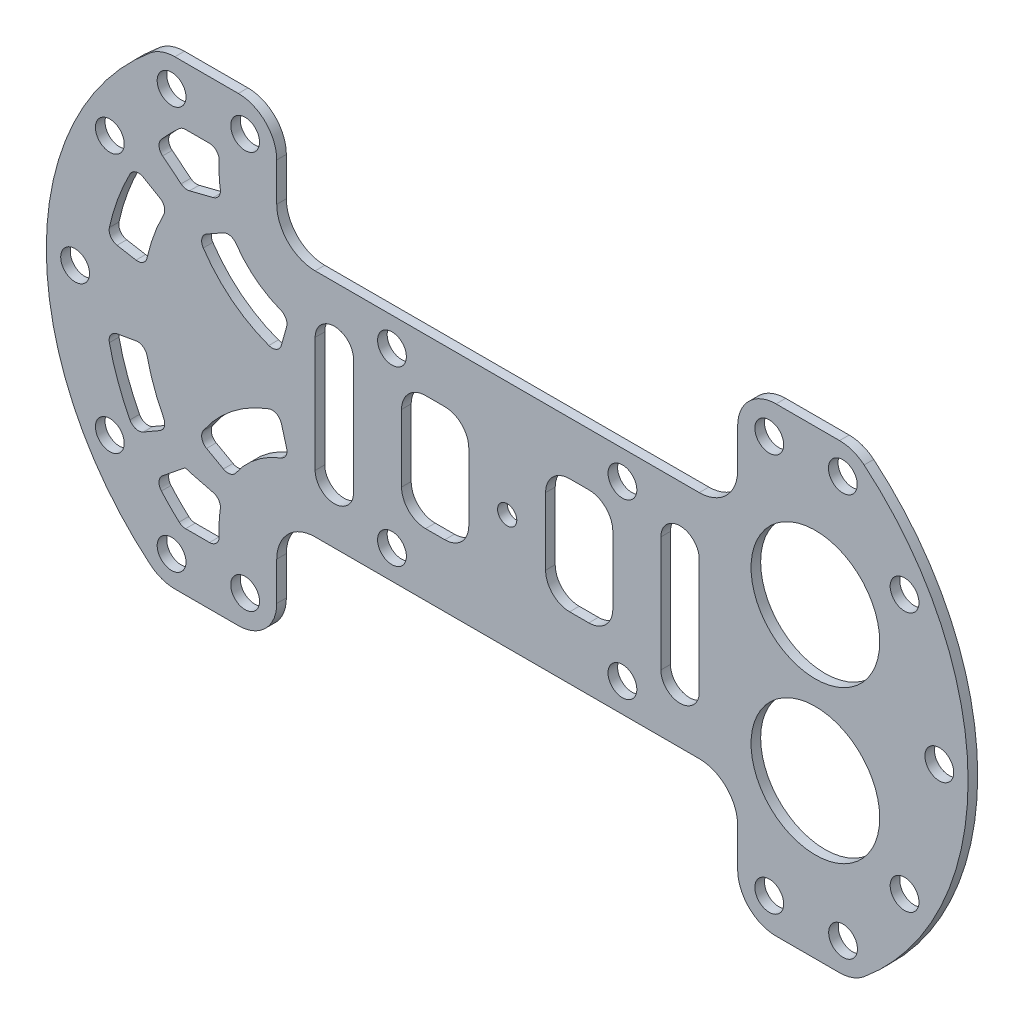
ISO-10303-21;
HEADER;
FILE_DESCRIPTION(('STEP AP214'),'2;1');
FILE_NAME('part.step','',(''),(''),'','','');
FILE_SCHEMA(('AUTOMOTIVE_DESIGN { 1 0 10303 214 1 1 1 1 }'));
ENDSEC;
DATA;
#1=APPLICATION_CONTEXT('core data for automotive mechanical design processes');
#2=APPLICATION_PROTOCOL_DEFINITION('international standard','automotive_design',2000,#1);
#3=PRODUCT_CONTEXT('',#1,'mechanical');
#4=PRODUCT('Part','Part','',(#3));
#5=PRODUCT_RELATED_PRODUCT_CATEGORY('part','',(#4));
#6=PRODUCT_DEFINITION_FORMATION('','',#4);
#7=PRODUCT_DEFINITION_CONTEXT('part definition',#1,'design');
#8=PRODUCT_DEFINITION('design','',#6,#7);
#9=PRODUCT_DEFINITION_SHAPE('','',#8);
#10=(LENGTH_UNIT() NAMED_UNIT(*) SI_UNIT(.MILLI.,.METRE.));
#11=(NAMED_UNIT(*) PLANE_ANGLE_UNIT() SI_UNIT($,.RADIAN.));
#12=(NAMED_UNIT(*) SI_UNIT($,.STERADIAN.) SOLID_ANGLE_UNIT());
#13=UNCERTAINTY_MEASURE_WITH_UNIT(LENGTH_MEASURE(1.E-05),#10,'distance_accuracy_value','');
#14=(GEOMETRIC_REPRESENTATION_CONTEXT(3) GLOBAL_UNCERTAINTY_ASSIGNED_CONTEXT((#13)) GLOBAL_UNIT_ASSIGNED_CONTEXT((#10,
#11,#12)) REPRESENTATION_CONTEXT('',''));
#15=CARTESIAN_POINT('',(0.,0.,0.));
#16=DIRECTION('',(0.,0.,1.));
#17=DIRECTION('',(1.,0.,0.));
#18=AXIS2_PLACEMENT_3D('',#15,#16,#17);
#19=CARTESIAN_POINT('',(164.615677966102,-25.4,3.175));
#20=DIRECTION('',(0.,0.,-1.));
#21=DIRECTION('',(-1.,0.,0.));
#22=AXIS2_PLACEMENT_3D('',#19,#20,#21);
#23=CYLINDRICAL_SURFACE('',#22,12.7);
#24=CARTESIAN_POINT('',(164.615677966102,-25.4,0.));
#25=DIRECTION('',(0.,0.,1.));
#26=DIRECTION('',(-1.,0.,0.));
#27=AXIS2_PLACEMENT_3D('',#24,#25,#26);
#28=CIRCLE('',#27,12.7);
#29=CARTESIAN_POINT('',(151.915677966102,-25.3999999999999,0.));
#30=VERTEX_POINT('',#29);
#31=CARTESIAN_POINT('',(164.615677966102,-38.1,0.));
#32=VERTEX_POINT('',#31);
#33=EDGE_CURVE('E1388',#30,#32,#28,.T.);
#34=ORIENTED_EDGE('',*,*,#33,.T.);
#35=DIRECTION('',(0.,0.,-1.));
#36=VECTOR('',#35,1.);
#37=CARTESIAN_POINT('',(164.615677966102,-38.1,3.175));
#38=LINE('',#37,#36);
#39=CARTESIAN_POINT('',(164.615677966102,-38.1,3.175));
#40=VERTEX_POINT('',#39);
#41=EDGE_CURVE('E1552',#40,#32,#38,.T.);
#42=ORIENTED_EDGE('',*,*,#41,.F.);
#43=CARTESIAN_POINT('',(164.615677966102,-25.4,3.175));
#44=DIRECTION('',(0.,0.,1.));
#45=DIRECTION('',(-1.,0.,0.));
#46=AXIS2_PLACEMENT_3D('',#43,#44,#45);
#47=CIRCLE('',#46,12.7);
#48=CARTESIAN_POINT('',(151.915677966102,-25.3999999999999,3.175));
#49=VERTEX_POINT('',#48);
#50=EDGE_CURVE('E1313',#49,#40,#47,.T.);
#51=ORIENTED_EDGE('',*,*,#50,.F.);
#52=DIRECTION('',(0.,0.,-1.));
#53=VECTOR('',#52,1.);
#54=CARTESIAN_POINT('',(151.915677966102,-25.3999999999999,3.175));
#55=LINE('',#54,#53);
#56=EDGE_CURVE('E1387',#49,#30,#55,.T.);
#57=ORIENTED_EDGE('',*,*,#56,.T.);
#58=EDGE_LOOP('',(#34,#42,#51,#57));
#59=FACE_BOUND('',#58,.T.);
#60=ADVANCED_FACE('F42',(#59),#23,.T.);
#61=CARTESIAN_POINT('',(164.615677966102,-38.1,3.175));
#62=DIRECTION('',(0.,1.,0.));
#63=DIRECTION('',(0.,0.,1.));
#64=AXIS2_PLACEMENT_3D('',#61,#62,#63);
#65=PLANE('',#64);
#66=DIRECTION('',(1.,0.,0.));
#67=VECTOR('',#66,1.);
#68=CARTESIAN_POINT('',(164.615677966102,-38.1,0.));
#69=LINE('',#68,#67);
#70=CARTESIAN_POINT('',(185.612739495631,-38.1,0.));
#71=VERTEX_POINT('',#70);
#72=EDGE_CURVE('E1392',#32,#71,#69,.T.);
#73=ORIENTED_EDGE('',*,*,#72,.T.);
#74=DIRECTION('',(0.,0.,-1.));
#75=VECTOR('',#74,1.);
#76=CARTESIAN_POINT('',(185.612739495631,-38.1,3.175));
#77=LINE('',#76,#75);
#78=CARTESIAN_POINT('',(185.612739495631,-38.1,3.175));
#79=VERTEX_POINT('',#78);
#80=EDGE_CURVE('E1548',#79,#71,#77,.T.);
#81=ORIENTED_EDGE('',*,*,#80,.F.);
#82=DIRECTION('',(1.,0.,0.));
#83=VECTOR('',#82,1.);
#84=CARTESIAN_POINT('',(164.615677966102,-38.1,3.175));
#85=LINE('',#84,#83);
#86=EDGE_CURVE('E1317',#40,#79,#85,.T.);
#87=ORIENTED_EDGE('',*,*,#86,.F.);
#88=ORIENTED_EDGE('',*,*,#41,.T.);
#89=EDGE_LOOP('',(#73,#81,#87,#88));
#90=FACE_BOUND('',#89,.T.);
#91=ADVANCED_FACE('F1933',(#90),#65,.F.);
#92=CARTESIAN_POINT('',(185.612739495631,-25.4,3.175));
#93=DIRECTION('',(0.,0.,-1.));
#94=DIRECTION('',(-1.,0.,0.));
#95=AXIS2_PLACEMENT_3D('',#92,#93,#94);
#96=CYLINDRICAL_SURFACE('',#95,12.7);
#97=CARTESIAN_POINT('',(185.612739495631,-25.4,0.));
#98=DIRECTION('',(0.,0.,1.));
#99=DIRECTION('',(-1.,0.,0.));
#100=AXIS2_PLACEMENT_3D('',#97,#98,#99);
#101=CIRCLE('',#100,12.7);
#102=CARTESIAN_POINT('',(193.727672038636,-35.1692307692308,0.));
#103=VERTEX_POINT('',#102);
#104=EDGE_CURVE('E1396',#71,#103,#101,.T.);
#105=ORIENTED_EDGE('',*,*,#104,.T.);
#106=DIRECTION('',(0.,0.,-1.));
#107=VECTOR('',#106,1.);
#108=CARTESIAN_POINT('',(193.727672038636,-35.1692307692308,3.175));
#109=LINE('',#108,#107);
#110=CARTESIAN_POINT('',(193.727672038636,-35.1692307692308,3.175));
#111=VERTEX_POINT('',#110);
#112=EDGE_CURVE('E1544',#111,#103,#109,.T.);
#113=ORIENTED_EDGE('',*,*,#112,.F.);
#114=CARTESIAN_POINT('',(185.612739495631,-25.4,3.175));
#115=DIRECTION('',(0.,0.,1.));
#116=DIRECTION('',(-1.,0.,0.));
#117=AXIS2_PLACEMENT_3D('',#114,#115,#116);
#118=CIRCLE('',#117,12.7);
#119=EDGE_CURVE('E1321',#79,#111,#118,.T.);
#120=ORIENTED_EDGE('',*,*,#119,.F.);
#121=ORIENTED_EDGE('',*,*,#80,.T.);
#122=EDGE_LOOP('',(#105,#113,#120,#121));
#123=FACE_BOUND('',#122,.T.);
#124=ADVANCED_FACE('F1938',(#123),#96,.T.);
#125=CARTESIAN_POINT('',(132.865677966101,38.1,3.175));
#126=DIRECTION('',(0.,0.,-1.));
#127=DIRECTION('',(-1.,0.,0.));
#128=AXIS2_PLACEMENT_3D('',#125,#126,#127);
#129=CYLINDRICAL_SURFACE('',#128,95.2500000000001);
#130=CARTESIAN_POINT('',(132.865677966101,38.1,0.));
#131=DIRECTION('',(0.,0.,1.));
#132=DIRECTION('',(1.,0.,0.));
#133=AXIS2_PLACEMENT_3D('',#130,#131,#132);
#134=CIRCLE('',#133,95.2500000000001);
#135=CARTESIAN_POINT('',(193.727672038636,111.369230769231,0.));
#136=VERTEX_POINT('',#135);
#137=EDGE_CURVE('E1399',#103,#136,#134,.T.);
#138=ORIENTED_EDGE('',*,*,#137,.T.);
#139=DIRECTION('',(0.,0.,-1.));
#140=VECTOR('',#139,1.);
#141=CARTESIAN_POINT('',(193.727672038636,111.369230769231,3.175));
#142=LINE('',#141,#140);
#143=CARTESIAN_POINT('',(193.727672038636,111.369230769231,3.175));
#144=VERTEX_POINT('',#143);
#145=EDGE_CURVE('E1540',#144,#136,#142,.T.);
#146=ORIENTED_EDGE('',*,*,#145,.F.);
#147=CARTESIAN_POINT('',(132.865677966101,38.1,3.175));
#148=DIRECTION('',(0.,0.,1.));
#149=DIRECTION('',(1.,0.,0.));
#150=AXIS2_PLACEMENT_3D('',#147,#148,#149);
#151=CIRCLE('',#150,95.2500000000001);
#152=EDGE_CURVE('E1324',#111,#144,#151,.T.);
#153=ORIENTED_EDGE('',*,*,#152,.F.);
#154=ORIENTED_EDGE('',*,*,#112,.T.);
#155=EDGE_LOOP('',(#138,#146,#153,#154));
#156=FACE_BOUND('',#155,.T.);
#157=ADVANCED_FACE('F2051',(#156),#129,.T.);
#158=CARTESIAN_POINT('',(185.612739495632,101.6,3.175));
#159=DIRECTION('',(0.,0.,-1.));
#160=DIRECTION('',(-1.,0.,0.));
#161=AXIS2_PLACEMENT_3D('',#158,#159,#160);
#162=CYLINDRICAL_SURFACE('',#161,12.7);
#163=CARTESIAN_POINT('',(185.612739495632,101.6,0.));
#164=DIRECTION('',(0.,0.,1.));
#165=DIRECTION('',(1.,0.,0.));
#166=AXIS2_PLACEMENT_3D('',#163,#164,#165);
#167=CIRCLE('',#166,12.7);
#168=CARTESIAN_POINT('',(185.612739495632,114.3,0.));
#169=VERTEX_POINT('',#168);
#170=EDGE_CURVE('E1402',#136,#169,#167,.T.);
#171=ORIENTED_EDGE('',*,*,#170,.T.);
#172=DIRECTION('',(0.,0.,-1.));
#173=VECTOR('',#172,1.);
#174=CARTESIAN_POINT('',(185.612739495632,114.3,3.175));
#175=LINE('',#174,#173);
#176=CARTESIAN_POINT('',(185.612739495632,114.3,3.175));
#177=VERTEX_POINT('',#176);
#178=EDGE_CURVE('E1536',#177,#169,#175,.T.);
#179=ORIENTED_EDGE('',*,*,#178,.F.);
#180=CARTESIAN_POINT('',(185.612739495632,101.6,3.175));
#181=DIRECTION('',(0.,0.,1.));
#182=DIRECTION('',(1.,0.,0.));
#183=AXIS2_PLACEMENT_3D('',#180,#181,#182);
#184=CIRCLE('',#183,12.7);
#185=EDGE_CURVE('E1327',#144,#177,#184,.T.);
#186=ORIENTED_EDGE('',*,*,#185,.F.);
#187=ORIENTED_EDGE('',*,*,#145,.T.);
#188=EDGE_LOOP('',(#171,#179,#186,#187));
#189=FACE_BOUND('',#188,.T.);
#190=ADVANCED_FACE('F2048',(#189),#162,.T.);
#191=CARTESIAN_POINT('',(164.615677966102,114.3,3.175));
#192=DIRECTION('',(0.,-1.,0.));
#193=DIRECTION('',(0.,0.,-1.));
#194=AXIS2_PLACEMENT_3D('',#191,#192,#193);
#195=PLANE('',#194);
#196=DIRECTION('',(-1.,0.,0.));
#197=VECTOR('',#196,1.);
#198=CARTESIAN_POINT('',(164.615677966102,114.3,0.));
#199=LINE('',#198,#197);
#200=CARTESIAN_POINT('',(164.615677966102,114.3,0.));
#201=VERTEX_POINT('',#200);
#202=EDGE_CURVE('E1405',#169,#201,#199,.T.);
#203=ORIENTED_EDGE('',*,*,#202,.T.);
#204=DIRECTION('',(0.,0.,-1.));
#205=VECTOR('',#204,1.);
#206=CARTESIAN_POINT('',(164.615677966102,114.3,3.175));
#207=LINE('',#206,#205);
#208=CARTESIAN_POINT('',(164.615677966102,114.3,3.175));
#209=VERTEX_POINT('',#208);
#210=EDGE_CURVE('E1532',#209,#201,#207,.T.);
#211=ORIENTED_EDGE('',*,*,#210,.F.);
#212=DIRECTION('',(-1.,0.,0.));
#213=VECTOR('',#212,1.);
#214=CARTESIAN_POINT('',(164.615677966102,114.3,3.175));
#215=LINE('',#214,#213);
#216=EDGE_CURVE('E1330',#177,#209,#215,.T.);
#217=ORIENTED_EDGE('',*,*,#216,.F.);
#218=ORIENTED_EDGE('',*,*,#178,.T.);
#219=EDGE_LOOP('',(#203,#211,#217,#218));
#220=FACE_BOUND('',#219,.T.);
#221=ADVANCED_FACE('F2044',(#220),#195,.F.);
#222=CARTESIAN_POINT('',(164.615677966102,101.6,3.175));
#223=DIRECTION('',(0.,0.,-1.));
#224=DIRECTION('',(-1.,0.,0.));
#225=AXIS2_PLACEMENT_3D('',#222,#223,#224);
#226=CYLINDRICAL_SURFACE('',#225,12.7);
#227=CARTESIAN_POINT('',(164.615677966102,101.6,0.));
#228=DIRECTION('',(0.,0.,1.));
#229=DIRECTION('',(-1.,0.,0.));
#230=AXIS2_PLACEMENT_3D('',#227,#228,#229);
#231=CIRCLE('',#230,12.7);
#232=CARTESIAN_POINT('',(151.915677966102,101.6,0.));
#233=VERTEX_POINT('',#232);
#234=EDGE_CURVE('E1408',#201,#233,#231,.T.);
#235=ORIENTED_EDGE('',*,*,#234,.T.);
#236=DIRECTION('',(0.,0.,-1.));
#237=VECTOR('',#236,1.);
#238=CARTESIAN_POINT('',(151.915677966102,101.6,3.175));
#239=LINE('',#238,#237);
#240=CARTESIAN_POINT('',(151.915677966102,101.6,3.175));
#241=VERTEX_POINT('',#240);
#242=EDGE_CURVE('E1528',#241,#233,#239,.T.);
#243=ORIENTED_EDGE('',*,*,#242,.F.);
#244=CARTESIAN_POINT('',(164.615677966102,101.6,3.175));
#245=DIRECTION('',(0.,0.,1.));
#246=DIRECTION('',(-1.,0.,0.));
#247=AXIS2_PLACEMENT_3D('',#244,#245,#246);
#248=CIRCLE('',#247,12.7);
#249=EDGE_CURVE('E1333',#209,#241,#248,.T.);
#250=ORIENTED_EDGE('',*,*,#249,.F.);
#251=ORIENTED_EDGE('',*,*,#210,.T.);
#252=EDGE_LOOP('',(#235,#243,#250,#251));
#253=FACE_BOUND('',#252,.T.);
#254=ADVANCED_FACE('F2039',(#253),#226,.T.);
#255=CARTESIAN_POINT('',(151.915677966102,88.9000000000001,3.175));
#256=DIRECTION('',(1.,0.,0.));
#257=DIRECTION('',(0.,0.,-1.));
#258=AXIS2_PLACEMENT_3D('',#255,#256,#257);
#259=PLANE('',#258);
#260=DIRECTION('',(0.,-1.,0.));
#261=VECTOR('',#260,1.);
#262=CARTESIAN_POINT('',(151.915677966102,88.9000000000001,0.));
#263=LINE('',#262,#261);
#264=CARTESIAN_POINT('',(151.915677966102,88.9000000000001,0.));
#265=VERTEX_POINT('',#264);
#266=EDGE_CURVE('E1411',#233,#265,#263,.T.);
#267=ORIENTED_EDGE('',*,*,#266,.T.);
#268=DIRECTION('',(0.,0.,-1.));
#269=VECTOR('',#268,1.);
#270=CARTESIAN_POINT('',(151.915677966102,88.9000000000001,3.175));
#271=LINE('',#270,#269);
#272=CARTESIAN_POINT('',(151.915677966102,88.9000000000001,3.175));
#273=VERTEX_POINT('',#272);
#274=EDGE_CURVE('E1524',#273,#265,#271,.T.);
#275=ORIENTED_EDGE('',*,*,#274,.F.);
#276=DIRECTION('',(0.,-1.,0.));
#277=VECTOR('',#276,1.);
#278=CARTESIAN_POINT('',(151.915677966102,88.9000000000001,3.175));
#279=LINE('',#278,#277);
#280=EDGE_CURVE('E1336',#241,#273,#279,.T.);
#281=ORIENTED_EDGE('',*,*,#280,.F.);
#282=ORIENTED_EDGE('',*,*,#242,.T.);
#283=EDGE_LOOP('',(#267,#275,#281,#282));
#284=FACE_BOUND('',#283,.T.);
#285=ADVANCED_FACE('F2033',(#284),#259,.F.);
#286=CARTESIAN_POINT('',(139.215677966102,88.9,3.175));
#287=DIRECTION('',(0.,0.,-1.));
#288=DIRECTION('',(-1.,0.,0.));
#289=AXIS2_PLACEMENT_3D('',#286,#287,#288);
#290=CYLINDRICAL_SURFACE('',#289,12.7);
#291=CARTESIAN_POINT('',(139.215677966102,88.9,0.));
#292=DIRECTION('',(0.,0.,-1.));
#293=DIRECTION('',(-1.,0.,0.));
#294=AXIS2_PLACEMENT_3D('',#291,#292,#293);
#295=CIRCLE('',#294,12.7);
#296=CARTESIAN_POINT('',(139.215677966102,76.2,0.));
#297=VERTEX_POINT('',#296);
#298=EDGE_CURVE('E1414',#265,#297,#295,.T.);
#299=ORIENTED_EDGE('',*,*,#298,.T.);
#300=DIRECTION('',(0.,0.,-1.));
#301=VECTOR('',#300,1.);
#302=CARTESIAN_POINT('',(139.215677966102,76.2,3.175));
#303=LINE('',#302,#301);
#304=CARTESIAN_POINT('',(139.215677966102,76.2,3.175));
#305=VERTEX_POINT('',#304);
#306=EDGE_CURVE('E1520',#305,#297,#303,.T.);
#307=ORIENTED_EDGE('',*,*,#306,.F.);
#308=CARTESIAN_POINT('',(139.215677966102,88.9,3.175));
#309=DIRECTION('',(0.,0.,-1.));
#310=DIRECTION('',(-1.,0.,0.));
#311=AXIS2_PLACEMENT_3D('',#308,#309,#310);
#312=CIRCLE('',#311,12.7);
#313=EDGE_CURVE('E1339',#273,#305,#312,.T.);
#314=ORIENTED_EDGE('',*,*,#313,.F.);
#315=ORIENTED_EDGE('',*,*,#274,.T.);
#316=EDGE_LOOP('',(#299,#307,#314,#315));
#317=FACE_BOUND('',#316,.T.);
#318=ADVANCED_FACE('F2029',(#317),#290,.F.);
#319=CARTESIAN_POINT('',(12.2156779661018,76.2,3.175));
#320=DIRECTION('',(0.,-1.,0.));
#321=DIRECTION('',(1.,0.,0.));
#322=AXIS2_PLACEMENT_3D('',#319,#320,#321);
#323=PLANE('',#322);
#324=DIRECTION('',(-1.,0.,0.));
#325=VECTOR('',#324,1.);
#326=CARTESIAN_POINT('',(12.2156779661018,76.2,0.));
#327=LINE('',#326,#325);
#328=CARTESIAN_POINT('',(12.2156779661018,76.2,0.));
#329=VERTEX_POINT('',#328);
#330=EDGE_CURVE('E1417',#297,#329,#327,.T.);
#331=ORIENTED_EDGE('',*,*,#330,.T.);
#332=DIRECTION('',(0.,0.,-1.));
#333=VECTOR('',#332,1.);
#334=CARTESIAN_POINT('',(12.2156779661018,76.2,3.175));
#335=LINE('',#334,#333);
#336=CARTESIAN_POINT('',(12.2156779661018,76.2,3.175));
#337=VERTEX_POINT('',#336);
#338=EDGE_CURVE('E1516',#337,#329,#335,.T.);
#339=ORIENTED_EDGE('',*,*,#338,.F.);
#340=DIRECTION('',(-1.,0.,0.));
#341=VECTOR('',#340,1.);
#342=CARTESIAN_POINT('',(12.2156779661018,76.2,3.175));
#343=LINE('',#342,#341);
#344=EDGE_CURVE('E1342',#305,#337,#343,.T.);
#345=ORIENTED_EDGE('',*,*,#344,.F.);
#346=ORIENTED_EDGE('',*,*,#306,.T.);
#347=EDGE_LOOP('',(#331,#339,#345,#346));
#348=FACE_BOUND('',#347,.T.);
#349=ADVANCED_FACE('F2024',(#348),#323,.F.);
#350=CARTESIAN_POINT('',(12.2156779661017,88.9,3.175));
#351=DIRECTION('',(0.,0.,-1.));
#352=DIRECTION('',(-1.,0.,0.));
#353=AXIS2_PLACEMENT_3D('',#350,#351,#352);
#354=CYLINDRICAL_SURFACE('',#353,12.7);
#355=CARTESIAN_POINT('',(12.2156779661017,88.9,0.));
#356=DIRECTION('',(0.,0.,-1.));
#357=DIRECTION('',(-1.,0.,0.));
#358=AXIS2_PLACEMENT_3D('',#355,#356,#357);
#359=CIRCLE('',#358,12.7);
#360=CARTESIAN_POINT('',(-0.484322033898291,88.9,0.));
#361=VERTEX_POINT('',#360);
#362=EDGE_CURVE('E1420',#329,#361,#359,.T.);
#363=ORIENTED_EDGE('',*,*,#362,.T.);
#364=DIRECTION('',(0.,0.,-1.));
#365=VECTOR('',#364,1.);
#366=CARTESIAN_POINT('',(-0.484322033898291,88.9,3.175));
#367=LINE('',#366,#365);
#368=CARTESIAN_POINT('',(-0.484322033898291,88.9,3.175));
#369=VERTEX_POINT('',#368);
#370=EDGE_CURVE('E1512',#369,#361,#367,.T.);
#371=ORIENTED_EDGE('',*,*,#370,.F.);
#372=CARTESIAN_POINT('',(12.2156779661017,88.9,3.175));
#373=DIRECTION('',(0.,0.,-1.));
#374=DIRECTION('',(-1.,0.,0.));
#375=AXIS2_PLACEMENT_3D('',#372,#373,#374);
#376=CIRCLE('',#375,12.7);
#377=EDGE_CURVE('E1345',#337,#369,#376,.T.);
#378=ORIENTED_EDGE('',*,*,#377,.F.);
#379=ORIENTED_EDGE('',*,*,#338,.T.);
#380=EDGE_LOOP('',(#363,#371,#378,#379));
#381=FACE_BOUND('',#380,.T.);
#382=ADVANCED_FACE('F2018',(#381),#354,.F.);
#383=CARTESIAN_POINT('',(-0.484322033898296,88.9000000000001,3.175));
#384=DIRECTION('',(-1.,0.,0.));
#385=DIRECTION('',(0.,0.,1.));
#386=AXIS2_PLACEMENT_3D('',#383,#384,#385);
#387=PLANE('',#386);
#388=DIRECTION('',(0.,1.,0.));
#389=VECTOR('',#388,1.);
#390=CARTESIAN_POINT('',(-0.484322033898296,88.9000000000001,0.));
#391=LINE('',#390,#389);
#392=CARTESIAN_POINT('',(-0.484322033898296,101.6,0.));
#393=VERTEX_POINT('',#392);
#394=EDGE_CURVE('E1423',#361,#393,#391,.T.);
#395=ORIENTED_EDGE('',*,*,#394,.T.);
#396=DIRECTION('',(0.,0.,-1.));
#397=VECTOR('',#396,1.);
#398=CARTESIAN_POINT('',(-0.484322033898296,101.6,3.175));
#399=LINE('',#398,#397);
#400=CARTESIAN_POINT('',(-0.484322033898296,101.6,3.175));
#401=VERTEX_POINT('',#400);
#402=EDGE_CURVE('E1508',#401,#393,#399,.T.);
#403=ORIENTED_EDGE('',*,*,#402,.F.);
#404=DIRECTION('',(0.,1.,0.));
#405=VECTOR('',#404,1.);
#406=CARTESIAN_POINT('',(-0.484322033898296,88.9000000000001,3.175));
#407=LINE('',#406,#405);
#408=EDGE_CURVE('E1348',#369,#401,#407,.T.);
#409=ORIENTED_EDGE('',*,*,#408,.F.);
#410=ORIENTED_EDGE('',*,*,#370,.T.);
#411=EDGE_LOOP('',(#395,#403,#409,#410));
#412=FACE_BOUND('',#411,.T.);
#413=ADVANCED_FACE('F2014',(#412),#387,.F.);
#414=CARTESIAN_POINT('',(-13.1843220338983,101.6,3.175));
#415=DIRECTION('',(0.,0.,-1.));
#416=DIRECTION('',(-1.,0.,0.));
#417=AXIS2_PLACEMENT_3D('',#414,#415,#416);
#418=CYLINDRICAL_SURFACE('',#417,12.7);
#419=CARTESIAN_POINT('',(-13.1843220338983,101.6,0.));
#420=DIRECTION('',(0.,0.,1.));
#421=DIRECTION('',(1.,0.,0.));
#422=AXIS2_PLACEMENT_3D('',#419,#420,#421);
#423=CIRCLE('',#422,12.7);
#424=CARTESIAN_POINT('',(-13.1843220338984,114.3,0.));
#425=VERTEX_POINT('',#424);
#426=EDGE_CURVE('E1426',#393,#425,#423,.T.);
#427=ORIENTED_EDGE('',*,*,#426,.T.);
#428=DIRECTION('',(0.,0.,-1.));
#429=VECTOR('',#428,1.);
#430=CARTESIAN_POINT('',(-13.1843220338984,114.3,3.175));
#431=LINE('',#430,#429);
#432=CARTESIAN_POINT('',(-13.1843220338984,114.3,3.175));
#433=VERTEX_POINT('',#432);
#434=EDGE_CURVE('E1504',#433,#425,#431,.T.);
#435=ORIENTED_EDGE('',*,*,#434,.F.);
#436=CARTESIAN_POINT('',(-13.1843220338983,101.6,3.175));
#437=DIRECTION('',(0.,0.,1.));
#438=DIRECTION('',(1.,0.,0.));
#439=AXIS2_PLACEMENT_3D('',#436,#437,#438);
#440=CIRCLE('',#439,12.7);
#441=EDGE_CURVE('E1351',#401,#433,#440,.T.);
#442=ORIENTED_EDGE('',*,*,#441,.F.);
#443=ORIENTED_EDGE('',*,*,#402,.T.);
#444=EDGE_LOOP('',(#427,#435,#442,#443));
#445=FACE_BOUND('',#444,.T.);
#446=ADVANCED_FACE('F2009',(#445),#418,.T.);
#447=CARTESIAN_POINT('',(-13.1843220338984,114.3,3.175));
#448=DIRECTION('',(0.,-1.,0.));
#449=DIRECTION('',(0.,0.,-1.));
#450=AXIS2_PLACEMENT_3D('',#447,#448,#449);
#451=PLANE('',#450);
#452=DIRECTION('',(-1.,0.,0.));
#453=VECTOR('',#452,1.);
#454=CARTESIAN_POINT('',(-13.1843220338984,114.3,0.));
#455=LINE('',#454,#453);
#456=CARTESIAN_POINT('',(-34.1813835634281,114.3,0.));
#457=VERTEX_POINT('',#456);
#458=EDGE_CURVE('E1429',#425,#457,#455,.T.);
#459=ORIENTED_EDGE('',*,*,#458,.T.);
#460=DIRECTION('',(0.,0.,-1.));
#461=VECTOR('',#460,1.);
#462=CARTESIAN_POINT('',(-34.1813835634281,114.3,3.175));
#463=LINE('',#462,#461);
#464=CARTESIAN_POINT('',(-34.1813835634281,114.3,3.175));
#465=VERTEX_POINT('',#464);
#466=EDGE_CURVE('E1500',#465,#457,#463,.T.);
#467=ORIENTED_EDGE('',*,*,#466,.F.);
#468=DIRECTION('',(-1.,0.,0.));
#469=VECTOR('',#468,1.);
#470=CARTESIAN_POINT('',(-13.1843220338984,114.3,3.175));
#471=LINE('',#470,#469);
#472=EDGE_CURVE('E1354',#433,#465,#471,.T.);
#473=ORIENTED_EDGE('',*,*,#472,.F.);
#474=ORIENTED_EDGE('',*,*,#434,.T.);
#475=EDGE_LOOP('',(#459,#467,#473,#474));
#476=FACE_BOUND('',#475,.T.);
#477=ADVANCED_FACE('F2003',(#476),#451,.F.);
#478=CARTESIAN_POINT('',(-34.1813835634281,101.6,3.175));
#479=DIRECTION('',(0.,0.,-1.));
#480=DIRECTION('',(-1.,0.,0.));
#481=AXIS2_PLACEMENT_3D('',#478,#479,#480);
#482=CYLINDRICAL_SURFACE('',#481,12.7);
#483=CARTESIAN_POINT('',(-34.1813835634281,101.6,0.));
#484=DIRECTION('',(0.,0.,1.));
#485=DIRECTION('',(-1.,0.,0.));
#486=AXIS2_PLACEMENT_3D('',#483,#484,#485);
#487=CIRCLE('',#486,12.7);
#488=CARTESIAN_POINT('',(-42.2963161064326,111.369230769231,0.));
#489=VERTEX_POINT('',#488);
#490=EDGE_CURVE('E1432',#457,#489,#487,.T.);
#491=ORIENTED_EDGE('',*,*,#490,.T.);
#492=DIRECTION('',(0.,0.,-1.));
#493=VECTOR('',#492,1.);
#494=CARTESIAN_POINT('',(-42.2963161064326,111.369230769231,3.175));
#495=LINE('',#494,#493);
#496=CARTESIAN_POINT('',(-42.2963161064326,111.369230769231,3.175));
#497=VERTEX_POINT('',#496);
#498=EDGE_CURVE('E1496',#497,#489,#495,.T.);
#499=ORIENTED_EDGE('',*,*,#498,.F.);
#500=CARTESIAN_POINT('',(-34.1813835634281,101.6,3.175));
#501=DIRECTION('',(0.,0.,1.));
#502=DIRECTION('',(-1.,0.,0.));
#503=AXIS2_PLACEMENT_3D('',#500,#501,#502);
#504=CIRCLE('',#503,12.7);
#505=EDGE_CURVE('E1357',#465,#497,#504,.T.);
#506=ORIENTED_EDGE('',*,*,#505,.F.);
#507=ORIENTED_EDGE('',*,*,#466,.T.);
#508=EDGE_LOOP('',(#491,#499,#506,#507));
#509=FACE_BOUND('',#508,.T.);
#510=ADVANCED_FACE('F1999',(#509),#482,.T.);
#511=CARTESIAN_POINT('',(18.5656779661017,38.1,3.175));
#512=DIRECTION('',(0.,0.,-1.));
#513=DIRECTION('',(-1.,0.,0.));
#514=AXIS2_PLACEMENT_3D('',#511,#512,#513);
#515=CYLINDRICAL_SURFACE('',#514,95.25);
#516=CARTESIAN_POINT('',(18.5656779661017,38.1,0.));
#517=DIRECTION('',(0.,0.,1.));
#518=DIRECTION('',(1.,0.,0.));
#519=AXIS2_PLACEMENT_3D('',#516,#517,#518);
#520=CIRCLE('',#519,95.25);
#521=CARTESIAN_POINT('',(-42.2963161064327,-35.1692307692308,0.));
#522=VERTEX_POINT('',#521);
#523=EDGE_CURVE('E1435',#489,#522,#520,.T.);
#524=ORIENTED_EDGE('',*,*,#523,.T.);
#525=DIRECTION('',(0.,0.,-1.));
#526=VECTOR('',#525,1.);
#527=CARTESIAN_POINT('',(-42.2963161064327,-35.1692307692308,3.175));
#528=LINE('',#527,#526);
#529=CARTESIAN_POINT('',(-42.2963161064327,-35.1692307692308,3.175));
#530=VERTEX_POINT('',#529);
#531=EDGE_CURVE('E1492',#530,#522,#528,.T.);
#532=ORIENTED_EDGE('',*,*,#531,.F.);
#533=CARTESIAN_POINT('',(18.5656779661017,38.1,3.175));
#534=DIRECTION('',(0.,0.,1.));
#535=DIRECTION('',(1.,0.,0.));
#536=AXIS2_PLACEMENT_3D('',#533,#534,#535);
#537=CIRCLE('',#536,95.25);
#538=EDGE_CURVE('E1360',#497,#530,#537,.T.);
#539=ORIENTED_EDGE('',*,*,#538,.F.);
#540=ORIENTED_EDGE('',*,*,#498,.T.);
#541=EDGE_LOOP('',(#524,#532,#539,#540));
#542=FACE_BOUND('',#541,.T.);
#543=ADVANCED_FACE('F1994',(#542),#515,.T.);
#544=CARTESIAN_POINT('',(-34.1813835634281,-25.4,3.175));
#545=DIRECTION('',(0.,0.,-1.));
#546=DIRECTION('',(-1.,0.,0.));
#547=AXIS2_PLACEMENT_3D('',#544,#545,#546);
#548=CYLINDRICAL_SURFACE('',#547,12.7);
#549=CARTESIAN_POINT('',(-34.1813835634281,-25.4,0.));
#550=DIRECTION('',(0.,0.,1.));
#551=DIRECTION('',(1.,0.,0.));
#552=AXIS2_PLACEMENT_3D('',#549,#550,#551);
#553=CIRCLE('',#552,12.7);
#554=CARTESIAN_POINT('',(-34.1813835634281,-38.1,0.));
#555=VERTEX_POINT('',#554);
#556=EDGE_CURVE('E1438',#522,#555,#553,.T.);
#557=ORIENTED_EDGE('',*,*,#556,.T.);
#558=DIRECTION('',(0.,0.,-1.));
#559=VECTOR('',#558,1.);
#560=CARTESIAN_POINT('',(-34.1813835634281,-38.1,3.175));
#561=LINE('',#560,#559);
#562=CARTESIAN_POINT('',(-34.1813835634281,-38.1,3.175));
#563=VERTEX_POINT('',#562);
#564=EDGE_CURVE('E1488',#563,#555,#561,.T.);
#565=ORIENTED_EDGE('',*,*,#564,.F.);
#566=CARTESIAN_POINT('',(-34.1813835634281,-25.4,3.175));
#567=DIRECTION('',(0.,0.,1.));
#568=DIRECTION('',(1.,0.,0.));
#569=AXIS2_PLACEMENT_3D('',#566,#567,#568);
#570=CIRCLE('',#569,12.7);
#571=EDGE_CURVE('E1363',#530,#563,#570,.T.);
#572=ORIENTED_EDGE('',*,*,#571,.F.);
#573=ORIENTED_EDGE('',*,*,#531,.T.);
#574=EDGE_LOOP('',(#557,#565,#572,#573));
#575=FACE_BOUND('',#574,.T.);
#576=ADVANCED_FACE('F1988',(#575),#548,.T.);
#577=CARTESIAN_POINT('',(-13.1843220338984,-38.1,3.175));
#578=DIRECTION('',(0.,1.,0.));
#579=DIRECTION('',(0.,0.,1.));
#580=AXIS2_PLACEMENT_3D('',#577,#578,#579);
#581=PLANE('',#580);
#582=DIRECTION('',(1.,0.,0.));
#583=VECTOR('',#582,1.);
#584=CARTESIAN_POINT('',(-13.1843220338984,-38.1,0.));
#585=LINE('',#584,#583);
#586=CARTESIAN_POINT('',(-13.1843220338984,-38.1,0.));
#587=VERTEX_POINT('',#586);
#588=EDGE_CURVE('E1441',#555,#587,#585,.T.);
#589=ORIENTED_EDGE('',*,*,#588,.T.);
#590=DIRECTION('',(0.,0.,-1.));
#591=VECTOR('',#590,1.);
#592=CARTESIAN_POINT('',(-13.1843220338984,-38.1,3.175));
#593=LINE('',#592,#591);
#594=CARTESIAN_POINT('',(-13.1843220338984,-38.1,3.175));
#595=VERTEX_POINT('',#594);
#596=EDGE_CURVE('E1484',#595,#587,#593,.T.);
#597=ORIENTED_EDGE('',*,*,#596,.F.);
#598=DIRECTION('',(1.,0.,0.));
#599=VECTOR('',#598,1.);
#600=CARTESIAN_POINT('',(-13.1843220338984,-38.1,3.175));
#601=LINE('',#600,#599);
#602=EDGE_CURVE('E1366',#563,#595,#601,.T.);
#603=ORIENTED_EDGE('',*,*,#602,.F.);
#604=ORIENTED_EDGE('',*,*,#564,.T.);
#605=EDGE_LOOP('',(#589,#597,#603,#604));
#606=FACE_BOUND('',#605,.T.);
#607=ADVANCED_FACE('F1984',(#606),#581,.F.);
#608=CARTESIAN_POINT('',(-13.1843220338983,-25.4,3.175));
#609=DIRECTION('',(0.,0.,-1.));
#610=DIRECTION('',(-1.,0.,0.));
#611=AXIS2_PLACEMENT_3D('',#608,#609,#610);
#612=CYLINDRICAL_SURFACE('',#611,12.7);
#613=CARTESIAN_POINT('',(-13.1843220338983,-25.4,0.));
#614=DIRECTION('',(0.,0.,1.));
#615=DIRECTION('',(1.,0.,0.));
#616=AXIS2_PLACEMENT_3D('',#613,#614,#615);
#617=CIRCLE('',#616,12.7);
#618=CARTESIAN_POINT('',(-0.484322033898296,-25.4,0.));
#619=VERTEX_POINT('',#618);
#620=EDGE_CURVE('E1444',#587,#619,#617,.T.);
#621=ORIENTED_EDGE('',*,*,#620,.T.);
#622=DIRECTION('',(0.,0.,-1.));
#623=VECTOR('',#622,1.);
#624=CARTESIAN_POINT('',(-0.484322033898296,-25.4,3.175));
#625=LINE('',#624,#623);
#626=CARTESIAN_POINT('',(-0.484322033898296,-25.4,3.175));
#627=VERTEX_POINT('',#626);
#628=EDGE_CURVE('E1480',#627,#619,#625,.T.);
#629=ORIENTED_EDGE('',*,*,#628,.F.);
#630=CARTESIAN_POINT('',(-13.1843220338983,-25.4,3.175));
#631=DIRECTION('',(0.,0.,1.));
#632=DIRECTION('',(1.,0.,0.));
#633=AXIS2_PLACEMENT_3D('',#630,#631,#632);
#634=CIRCLE('',#633,12.7);
#635=EDGE_CURVE('E1369',#595,#627,#634,.T.);
#636=ORIENTED_EDGE('',*,*,#635,.F.);
#637=ORIENTED_EDGE('',*,*,#596,.T.);
#638=EDGE_LOOP('',(#621,#629,#636,#637));
#639=FACE_BOUND('',#638,.T.);
#640=ADVANCED_FACE('F1979',(#639),#612,.T.);
#641=CARTESIAN_POINT('',(-0.484322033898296,-25.3999999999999,3.175));
#642=DIRECTION('',(-1.,0.,0.));
#643=DIRECTION('',(0.,-1.,0.));
#644=AXIS2_PLACEMENT_3D('',#641,#642,#643);
#645=PLANE('',#644);
#646=DIRECTION('',(0.,1.,0.));
#647=VECTOR('',#646,1.);
#648=CARTESIAN_POINT('',(-0.484322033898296,-25.3999999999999,0.));
#649=LINE('',#648,#647);
#650=CARTESIAN_POINT('',(-0.484322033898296,-12.7000000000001,0.));
#651=VERTEX_POINT('',#650);
#652=EDGE_CURVE('E1447',#619,#651,#649,.T.);
#653=ORIENTED_EDGE('',*,*,#652,.T.);
#654=DIRECTION('',(0.,0.,-1.));
#655=VECTOR('',#654,1.);
#656=CARTESIAN_POINT('',(-0.484322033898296,-12.7000000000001,3.175));
#657=LINE('',#656,#655);
#658=CARTESIAN_POINT('',(-0.484322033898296,-12.7000000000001,3.175));
#659=VERTEX_POINT('',#658);
#660=EDGE_CURVE('E1476',#659,#651,#657,.T.);
#661=ORIENTED_EDGE('',*,*,#660,.F.);
#662=DIRECTION('',(0.,1.,0.));
#663=VECTOR('',#662,1.);
#664=CARTESIAN_POINT('',(-0.484322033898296,-25.3999999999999,3.175));
#665=LINE('',#664,#663);
#666=EDGE_CURVE('E1372',#627,#659,#665,.T.);
#667=ORIENTED_EDGE('',*,*,#666,.F.);
#668=ORIENTED_EDGE('',*,*,#628,.T.);
#669=EDGE_LOOP('',(#653,#661,#667,#668));
#670=FACE_BOUND('',#669,.T.);
#671=ADVANCED_FACE('F1973',(#670),#645,.F.);
#672=CARTESIAN_POINT('',(12.2156779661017,-12.7,3.175));
#673=DIRECTION('',(0.,0.,-1.));
#674=DIRECTION('',(-1.,0.,0.));
#675=AXIS2_PLACEMENT_3D('',#672,#673,#674);
#676=CYLINDRICAL_SURFACE('',#675,12.7);
#677=CARTESIAN_POINT('',(12.2156779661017,-12.7,0.));
#678=DIRECTION('',(0.,0.,-1.));
#679=DIRECTION('',(-1.,0.,0.));
#680=AXIS2_PLACEMENT_3D('',#677,#678,#679);
#681=CIRCLE('',#680,12.7);
#682=CARTESIAN_POINT('',(12.2156779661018,0.,0.));
#683=VERTEX_POINT('',#682);
#684=EDGE_CURVE('E1450',#651,#683,#681,.T.);
#685=ORIENTED_EDGE('',*,*,#684,.T.);
#686=DIRECTION('',(0.,0.,-1.));
#687=VECTOR('',#686,1.);
#688=CARTESIAN_POINT('',(12.2156779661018,0.,3.175));
#689=LINE('',#688,#687);
#690=CARTESIAN_POINT('',(12.2156779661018,0.,3.175));
#691=VERTEX_POINT('',#690);
#692=EDGE_CURVE('E1472',#691,#683,#689,.T.);
#693=ORIENTED_EDGE('',*,*,#692,.F.);
#694=CARTESIAN_POINT('',(12.2156779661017,-12.7,3.175));
#695=DIRECTION('',(0.,0.,-1.));
#696=DIRECTION('',(-1.,0.,0.));
#697=AXIS2_PLACEMENT_3D('',#694,#695,#696);
#698=CIRCLE('',#697,12.7);
#699=EDGE_CURVE('E1375',#659,#691,#698,.T.);
#700=ORIENTED_EDGE('',*,*,#699,.F.);
#701=ORIENTED_EDGE('',*,*,#660,.T.);
#702=EDGE_LOOP('',(#685,#693,#700,#701));
#703=FACE_BOUND('',#702,.T.);
#704=ADVANCED_FACE('F1969',(#703),#676,.F.);
#705=CARTESIAN_POINT('',(12.2156779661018,0.,3.175));
#706=DIRECTION('',(0.,1.,0.));
#707=DIRECTION('',(-1.,0.,0.));
#708=AXIS2_PLACEMENT_3D('',#705,#706,#707);
#709=PLANE('',#708);
#710=DIRECTION('',(1.,0.,0.));
#711=VECTOR('',#710,1.);
#712=CARTESIAN_POINT('',(12.2156779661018,0.,0.));
#713=LINE('',#712,#711);
#714=CARTESIAN_POINT('',(139.215677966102,0.,0.));
#715=VERTEX_POINT('',#714);
#716=EDGE_CURVE('E1453',#683,#715,#713,.T.);
#717=ORIENTED_EDGE('',*,*,#716,.T.);
#718=DIRECTION('',(0.,0.,-1.));
#719=VECTOR('',#718,1.);
#720=CARTESIAN_POINT('',(139.215677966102,0.,3.175));
#721=LINE('',#720,#719);
#722=CARTESIAN_POINT('',(139.215677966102,0.,3.175));
#723=VERTEX_POINT('',#722);
#724=EDGE_CURVE('E1468',#723,#715,#721,.T.);
#725=ORIENTED_EDGE('',*,*,#724,.F.);
#726=DIRECTION('',(1.,0.,0.));
#727=VECTOR('',#726,1.);
#728=CARTESIAN_POINT('',(12.2156779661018,0.,3.175));
#729=LINE('',#728,#727);
#730=EDGE_CURVE('E1378',#691,#723,#729,.T.);
#731=ORIENTED_EDGE('',*,*,#730,.F.);
#732=ORIENTED_EDGE('',*,*,#692,.T.);
#733=EDGE_LOOP('',(#717,#725,#731,#732));
#734=FACE_BOUND('',#733,.T.);
#735=ADVANCED_FACE('F1964',(#734),#709,.F.);
#736=CARTESIAN_POINT('',(139.215677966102,-12.7,3.175));
#737=DIRECTION('',(0.,0.,-1.));
#738=DIRECTION('',(-1.,0.,0.));
#739=AXIS2_PLACEMENT_3D('',#736,#737,#738);
#740=CYLINDRICAL_SURFACE('',#739,12.7);
#741=CARTESIAN_POINT('',(139.215677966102,-12.7,0.));
#742=DIRECTION('',(0.,0.,-1.));
#743=DIRECTION('',(1.,0.,0.));
#744=AXIS2_PLACEMENT_3D('',#741,#742,#743);
#745=CIRCLE('',#744,12.7);
#746=CARTESIAN_POINT('',(151.915677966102,-12.7000000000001,0.));
#747=VERTEX_POINT('',#746);
#748=EDGE_CURVE('E1456',#715,#747,#745,.T.);
#749=ORIENTED_EDGE('',*,*,#748,.T.);
#750=DIRECTION('',(0.,0.,-1.));
#751=VECTOR('',#750,1.);
#752=CARTESIAN_POINT('',(151.915677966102,-12.7000000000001,3.175));
#753=LINE('',#752,#751);
#754=CARTESIAN_POINT('',(151.915677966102,-12.7000000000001,3.175));
#755=VERTEX_POINT('',#754);
#756=EDGE_CURVE('E1464',#755,#747,#753,.T.);
#757=ORIENTED_EDGE('',*,*,#756,.F.);
#758=CARTESIAN_POINT('',(139.215677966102,-12.7,3.175));
#759=DIRECTION('',(0.,0.,-1.));
#760=DIRECTION('',(1.,0.,0.));
#761=AXIS2_PLACEMENT_3D('',#758,#759,#760);
#762=CIRCLE('',#761,12.7);
#763=EDGE_CURVE('E1381',#723,#755,#762,.T.);
#764=ORIENTED_EDGE('',*,*,#763,.F.);
#765=ORIENTED_EDGE('',*,*,#724,.T.);
#766=EDGE_LOOP('',(#749,#757,#764,#765));
#767=FACE_BOUND('',#766,.T.);
#768=ADVANCED_FACE('F1958',(#767),#740,.F.);
#769=CARTESIAN_POINT('',(151.915677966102,-25.3999999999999,3.175));
#770=DIRECTION('',(1.,0.,0.));
#771=DIRECTION('',(0.,0.,-1.));
#772=AXIS2_PLACEMENT_3D('',#769,#770,#771);
#773=PLANE('',#772);
#774=DIRECTION('',(0.,-1.,0.));
#775=VECTOR('',#774,1.);
#776=CARTESIAN_POINT('',(151.915677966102,-25.3999999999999,0.));
#777=LINE('',#776,#775);
#778=EDGE_CURVE('E1318',#747,#30,#777,.T.);
#779=ORIENTED_EDGE('',*,*,#778,.T.);
#780=ORIENTED_EDGE('',*,*,#56,.F.);
#781=DIRECTION('',(0.,-1.,0.));
#782=VECTOR('',#781,1.);
#783=CARTESIAN_POINT('',(151.915677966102,-25.3999999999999,3.175));
#784=LINE('',#783,#782);
#785=EDGE_CURVE('E1384',#755,#49,#784,.T.);
#786=ORIENTED_EDGE('',*,*,#785,.F.);
#787=ORIENTED_EDGE('',*,*,#756,.T.);
#788=EDGE_LOOP('',(#779,#780,#786,#787));
#789=FACE_BOUND('',#788,.T.);
#790=ADVANCED_FACE('F1956',(#789),#773,.F.);
#791=CARTESIAN_POINT('',(164.615677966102,-25.4,3.175));
#792=DIRECTION('',(0.,0.,-1.));
#793=DIRECTION('',(-1.,0.,0.));
#794=AXIS2_PLACEMENT_3D('',#791,#792,#793);
#795=PLANE('',#794);
#796=CARTESIAN_POINT('',(75.7156779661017,38.1,3.175));
#797=DIRECTION('',(0.,0.,1.));
#798=DIRECTION('',(1.,0.,0.));
#799=AXIS2_PLACEMENT_3D('',#796,#797,#798);
#800=CIRCLE('',#799,3.175);
#801=CARTESIAN_POINT('',(78.8906779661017,38.1,3.175));
#802=VERTEX_POINT('',#801);
#803=EDGE_CURVE('E3621',#802,#802,#800,.T.);
#804=ORIENTED_EDGE('',*,*,#803,.F.);
#805=EDGE_LOOP('',(#804));
#806=FACE_BOUND('',#805,.T.);
#807=CARTESIAN_POINT('',(-22.2760772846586,-7.21598279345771,3.175));
#808=DIRECTION('',(0.,0.,1.));
#809=DIRECTION('',(1.,0.,0.));
#810=AXIS2_PLACEMENT_3D('',#807,#808,#809);
#811=CIRCLE('',#810,3.175);
#812=CARTESIAN_POINT('',(-19.1404631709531,-7.71452981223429,3.175));
#813=VERTEX_POINT('',#812);
#814=CARTESIAN_POINT('',(-21.4945388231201,-4.13867510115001,3.175));
#815=VERTEX_POINT('',#814);
#816=EDGE_CURVE('E866',#813,#815,#811,.T.);
#817=ORIENTED_EDGE('',*,*,#816,.F.);
#818=CARTESIAN_POINT('',(12.2156779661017,-12.7,3.175));
#819=DIRECTION('',(0.,0.,-1.));
#820=DIRECTION('',(-1.,0.,0.));
#821=AXIS2_PLACEMENT_3D('',#818,#819,#820);
#822=CIRCLE('',#821,31.75);
#823=CARTESIAN_POINT('',(-19.5343220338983,-12.7000000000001,3.175));
#824=VERTEX_POINT('',#823);
#825=EDGE_CURVE('E57',#824,#813,#822,.T.);
#826=ORIENTED_EDGE('',*,*,#825,.F.);
#827=DIRECTION('',(0.,1.,0.));
#828=VECTOR('',#827,1.);
#829=CARTESIAN_POINT('',(-19.5343220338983,-12.7000000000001,3.175));
#830=LINE('',#829,#828);
#831=CARTESIAN_POINT('',(-19.5343220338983,-15.875,3.175));
#832=VERTEX_POINT('',#831);
#833=EDGE_CURVE('E903',#832,#824,#830,.T.);
#834=ORIENTED_EDGE('',*,*,#833,.F.);
#835=CARTESIAN_POINT('',(-22.7093220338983,-15.875,3.175));
#836=DIRECTION('',(0.,0.,1.));
#837=DIRECTION('',(-1.,0.,0.));
#838=AXIS2_PLACEMENT_3D('',#835,#836,#837);
#839=CIRCLE('',#838,3.175);
#840=CARTESIAN_POINT('',(-22.7093220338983,-19.05,3.175));
#841=VERTEX_POINT('',#840);
#842=EDGE_CURVE('E899',#841,#832,#839,.T.);
#843=ORIENTED_EDGE('',*,*,#842,.F.);
#844=DIRECTION('',(1.,0.,0.));
#845=VECTOR('',#844,1.);
#846=CARTESIAN_POINT('',(-22.7093220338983,-19.05,3.175));
#847=LINE('',#846,#845);
#848=CARTESIAN_POINT('',(-30.6212105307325,-19.05,3.175));
#849=VERTEX_POINT('',#848);
#850=EDGE_CURVE('E895',#849,#841,#847,.T.);
#851=ORIENTED_EDGE('',*,*,#850,.F.);
#852=CARTESIAN_POINT('',(-30.6212105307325,-15.875,3.175));
#853=DIRECTION('',(0.,0.,1.));
#854=DIRECTION('',(-1.,0.,0.));
#855=AXIS2_PLACEMENT_3D('',#852,#853,#854);
#856=CIRCLE('',#855,3.17499999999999);
#857=CARTESIAN_POINT('',(-32.7597709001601,-18.2217391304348,3.175));
#858=VERTEX_POINT('',#857);
#859=EDGE_CURVE('E891',#858,#849,#856,.T.);
#860=ORIENTED_EDGE('',*,*,#859,.F.);
#861=CARTESIAN_POINT('',(18.5656779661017,38.1,3.175));
#862=DIRECTION('',(0.,0.,1.));
#863=DIRECTION('',(-1.,0.,0.));
#864=AXIS2_PLACEMENT_3D('',#861,#862,#863);
#865=CIRCLE('',#864,76.2);
#866=CARTESIAN_POINT('',(-38.6174259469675,-12.2640012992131,3.175));
#867=VERTEX_POINT('',#866);
#868=EDGE_CURVE('E887',#867,#858,#865,.T.);
#869=ORIENTED_EDGE('',*,*,#868,.F.);
#870=CARTESIAN_POINT('',(-36.2347966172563,-10.1655012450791,3.175));
#871=DIRECTION('',(0.,0.,1.));
#872=DIRECTION('',(1.,0.,0.));
#873=AXIS2_PLACEMENT_3D('',#870,#871,#872);
#874=CIRCLE('',#873,3.175);
#875=CARTESIAN_POINT('',(-38.2277196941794,-7.69388586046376,3.175));
#876=VERTEX_POINT('',#875);
#877=EDGE_CURVE('E883',#876,#867,#874,.T.);
#878=ORIENTED_EDGE('',*,*,#877,.F.);
#879=DIRECTION('',(-0.77846153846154,-0.627692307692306,0.));
#880=VECTOR('',#879,1.);
#881=CARTESIAN_POINT('',(-30.866629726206,-1.75846153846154,3.175));
#882=LINE('',#881,#880);
#883=CARTESIAN_POINT('',(-30.866629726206,-1.75846153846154,3.175));
#884=VERTEX_POINT('',#883);
#885=EDGE_CURVE('E879',#884,#876,#882,.T.);
#886=ORIENTED_EDGE('',*,*,#885,.F.);
#887=CARTESIAN_POINT('',(-30.8540241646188,-4.93343651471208,3.175));
#888=DIRECTION('',(0.,0.,1.));
#889=DIRECTION('',(-1.,0.,0.));
#890=AXIS2_PLACEMENT_3D('',#887,#888,#889);
#891=CIRCLE('',#890,3.17500000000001);
#892=CARTESIAN_POINT('',(-29.3279758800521,-2.14923076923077,3.175));
#893=VERTEX_POINT('',#892);
#894=EDGE_CURVE('E875',#893,#884,#891,.T.);
#895=ORIENTED_EDGE('',*,*,#894,.F.);
#896=DIRECTION('',(-0.969230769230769,0.246153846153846,0.));
#897=VECTOR('',#896,1.);
#898=CARTESIAN_POINT('',(-21.4945388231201,-4.13867510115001,3.175));
#899=LINE('',#898,#897);
#900=EDGE_CURVE('E871',#815,#893,#899,.T.);
#901=ORIENTED_EDGE('',*,*,#900,.F.);
#902=EDGE_LOOP('',(#817,#826,#834,#843,#851,#860,#869,#878,#886,#895,#901));
#903=FACE_BOUND('',#902,.T.);
#904=CARTESIAN_POINT('',(12.2156779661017,88.9,3.175));
#905=DIRECTION('',(0.,0.,1.));
#906=DIRECTION('',(1.,0.,0.));
#907=AXIS2_PLACEMENT_3D('',#904,#905,#906);
#908=CIRCLE('',#907,44.45);
#909=CARTESIAN_POINT('',(-24.7811354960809,64.2618528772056,3.175));
#910=VERTEX_POINT('',#909);
#911=CARTESIAN_POINT('',(-3.10493298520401,47.1737327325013,3.175));
#912=VERTEX_POINT('',#911);
#913=EDGE_CURVE('E943',#910,#912,#908,.T.);
#914=ORIENTED_EDGE('',*,*,#913,.F.);
#915=CARTESIAN_POINT('',(-22.1385059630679,66.0217205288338,3.175));
#916=DIRECTION('',(0.,0.,1.));
#917=DIRECTION('',(1.,0.,0.));
#918=AXIS2_PLACEMENT_3D('',#915,#916,#917);
#919=CIRCLE('',#918,3.175);
#920=CARTESIAN_POINT('',(-23.6898799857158,68.7918944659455,3.175));
#921=VERTEX_POINT('',#920);
#922=EDGE_CURVE('E65',#921,#910,#919,.T.);
#923=ORIENTED_EDGE('',*,*,#922,.F.);
#924=DIRECTION('',(-0.872495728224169,-0.488621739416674,0.));
#925=VECTOR('',#924,1.);
#926=CARTESIAN_POINT('',(-18.1300571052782,71.9055490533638,3.175));
#927=LINE('',#926,#925);
#928=CARTESIAN_POINT('',(-18.1300571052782,71.9055490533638,3.175));
#929=VERTEX_POINT('',#928);
#930=EDGE_CURVE('E967',#929,#921,#927,.T.);
#931=ORIENTED_EDGE('',*,*,#930,.F.);
#932=CARTESIAN_POINT('',(-16.5786830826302,69.1353751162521,3.175));
#933=DIRECTION('',(0.,0.,1.));
#934=DIRECTION('',(1.,0.,0.));
#935=AXIS2_PLACEMENT_3D('',#932,#933,#934);
#936=CIRCLE('',#935,3.175);
#937=CARTESIAN_POINT('',(-13.9610138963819,70.9321591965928,3.175));
#938=VERTEX_POINT('',#937);
#939=EDGE_CURVE('E963',#938,#929,#936,.T.);
#940=ORIENTED_EDGE('',*,*,#939,.F.);
#941=CARTESIAN_POINT('',(12.2156779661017,88.9,3.175));
#942=DIRECTION('',(0.,0.,-1.));
#943=DIRECTION('',(1.,0.,0.));
#944=AXIS2_PLACEMENT_3D('',#941,#942,#943);
#945=CIRCLE('',#944,31.75);
#946=CARTESIAN_POINT('',(0.855151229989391,59.2520501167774,3.175));
#947=VERTEX_POINT('',#946);
#948=EDGE_CURVE('E959',#947,#938,#945,.T.);
#949=ORIENTED_EDGE('',*,*,#948,.F.);
#950=CARTESIAN_POINT('',(-0.280901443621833,56.2872551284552,3.175));
#951=DIRECTION('',(0.,0.,1.));
#952=DIRECTION('',(1.,0.,0.));
#953=AXIS2_PLACEMENT_3D('',#950,#951,#952);
#954=CIRCLE('',#953,3.175);
#955=CARTESIAN_POINT('',(2.77489442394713,55.4254334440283,3.175));
#956=VERTEX_POINT('',#955);
#957=EDGE_CURVE('E955',#956,#947,#954,.T.);
#958=ORIENTED_EDGE('',*,*,#957,.F.);
#959=DIRECTION('',(0.271439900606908,0.962455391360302,0.));
#960=VECTOR('',#959,1.);
#961=CARTESIAN_POINT('',(2.77489442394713,55.4254334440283,3.175));
#962=LINE('',#961,#960);
#963=CARTESIAN_POINT('',(1.04519223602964,49.2923587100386,3.175));
#964=VERTEX_POINT('',#963);
#965=EDGE_CURVE('E951',#964,#956,#962,.T.);
#966=ORIENTED_EDGE('',*,*,#965,.F.);
#967=CARTESIAN_POINT('',(-2.01060363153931,50.1541803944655,3.175));
#968=DIRECTION('',(0.,0.,1.));
#969=DIRECTION('',(1.,0.,0.));
#970=AXIS2_PLACEMENT_3D('',#967,#968,#969);
#971=CIRCLE('',#970,3.175);
#972=EDGE_CURVE('E947',#912,#964,#971,.T.);
#973=ORIENTED_EDGE('',*,*,#972,.F.);
#974=EDGE_LOOP('',(#914,#923,#931,#940,#949,#958,#966,#973));
#975=FACE_BOUND('',#974,.T.);
#976=CARTESIAN_POINT('',(18.5656779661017,38.1,3.175));
#977=DIRECTION('',(0.,0.,1.));
#978=DIRECTION('',(1.,0.,0.));
#979=AXIS2_PLACEMENT_3D('',#976,#977,#978);
#980=CIRCLE('',#979,76.2);
#981=CARTESIAN_POINT('',(-49.0195765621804,73.2947918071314,3.175));
#982=VERTEX_POINT('',#981);
#983=CARTESIAN_POINT('',(-55.8304068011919,54.5821895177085,3.175));
#984=VERTEX_POINT('',#983);
#985=EDGE_CURVE('E756',#982,#984,#980,.T.);
#986=ORIENTED_EDGE('',*,*,#985,.F.);
#987=CARTESIAN_POINT('',(-46.2035242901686,71.828342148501,3.175));
#988=DIRECTION('',(0.,0.,1.));
#989=DIRECTION('',(1.,0.,0.));
#990=AXIS2_PLACEMENT_3D('',#987,#988,#989);
#991=CIRCLE('',#990,3.17499999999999);
#992=CARTESIAN_POINT('',(-44.6160242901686,74.5779728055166,3.175));
#993=VERTEX_POINT('',#992);
#994=EDGE_CURVE('E753',#993,#982,#991,.T.);
#995=ORIENTED_EDGE('',*,*,#994,.F.);
#996=DIRECTION('',(-0.86602540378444,0.499999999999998,0.));
#997=VECTOR('',#996,1.);
#998=CARTESIAN_POINT('',(-39.1110612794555,71.3996809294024,3.175));
#999=LINE('',#998,#997);
#1000=CARTESIAN_POINT('',(-39.1110612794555,71.3996809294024,3.175));
#1001=VERTEX_POINT('',#1000);
#1002=EDGE_CURVE('E781',#1001,#993,#999,.T.);
#1003=ORIENTED_EDGE('',*,*,#1002,.F.);
#1004=CARTESIAN_POINT('',(-40.6985612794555,68.6500502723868,3.175));
#1005=DIRECTION('',(0.,0.,1.));
#1006=DIRECTION('',(1.,0.,0.));
#1007=AXIS2_PLACEMENT_3D('',#1004,#1005,#1006);
#1008=CIRCLE('',#1007,3.17499999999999);
#1009=CARTESIAN_POINT('',(-37.8764546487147,67.1952859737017,3.175));
#1010=VERTEX_POINT('',#1009);
#1011=EDGE_CURVE('E777',#1010,#1001,#1008,.T.);
#1012=ORIENTED_EDGE('',*,*,#1011,.F.);
#1013=CARTESIAN_POINT('',(18.5656779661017,38.1,3.175));
#1014=DIRECTION('',(0.,0.,-1.));
#1015=DIRECTION('',(1.,0.,0.));
#1016=AXIS2_PLACEMENT_3D('',#1013,#1014,#1015);
#1017=CIRCLE('',#1016,63.5);
#1018=CARTESIAN_POINT('',(-43.3735934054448,52.0920213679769,3.175));
#1019=VERTEX_POINT('',#1018);
#1020=EDGE_CURVE('E773',#1019,#1010,#1017,.T.);
#1021=ORIENTED_EDGE('',*,*,#1020,.F.);
#1022=CARTESIAN_POINT('',(-46.4705569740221,52.7916224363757,3.175));
#1023=DIRECTION('',(0.,0.,1.));
#1024=DIRECTION('',(-1.,0.,0.));
#1025=AXIS2_PLACEMENT_3D('',#1022,#1023,#1024);
#1026=CIRCLE('',#1025,3.17500000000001);
#1027=CARTESIAN_POINT('',(-47.0218899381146,49.6648578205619,3.175));
#1028=VERTEX_POINT('',#1027);
#1029=EDGE_CURVE('E769',#1028,#1019,#1026,.T.);
#1030=ORIENTED_EDGE('',*,*,#1029,.F.);
#1031=DIRECTION('',(0.984807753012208,-0.173648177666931,0.));
#1032=VECTOR('',#1031,1.);
#1033=CARTESIAN_POINT('',(-47.0218899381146,49.6648578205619,3.175));
#1034=LINE('',#1033,#1032);
#1035=CARTESIAN_POINT('',(-53.2819028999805,50.7686670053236,3.175));
#1036=VERTEX_POINT('',#1035);
#1037=EDGE_CURVE('E765',#1036,#1028,#1034,.T.);
#1038=ORIENTED_EDGE('',*,*,#1037,.F.);
#1039=CARTESIAN_POINT('',(-52.730569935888,53.8954316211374,3.175));
#1040=DIRECTION('',(0.,0.,1.));
#1041=DIRECTION('',(-1.,0.,0.));
#1042=AXIS2_PLACEMENT_3D('',#1039,#1040,#1041);
#1043=CIRCLE('',#1042,3.175);
#1044=EDGE_CURVE('E761',#984,#1036,#1043,.T.);
#1045=ORIENTED_EDGE('',*,*,#1044,.F.);
#1046=EDGE_LOOP('',(#986,#995,#1003,#1012,#1021,#1030,#1038,#1045));
#1047=FACE_BOUND('',#1046,.T.);
#1048=DIRECTION('',(0.872495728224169,-0.488621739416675,0.));
#1049=VECTOR('',#1048,1.);
#1050=CARTESIAN_POINT('',(-18.1300571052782,4.29445094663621,3.175));
#1051=LINE('',#1050,#1049);
#1052=CARTESIAN_POINT('',(-23.6898799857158,7.40810553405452,3.175));
#1053=VERTEX_POINT('',#1052);
#1054=CARTESIAN_POINT('',(-18.1300571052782,4.2944509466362,3.175));
#1055=VERTEX_POINT('',#1054);
#1056=EDGE_CURVE('E812',#1053,#1055,#1051,.T.);
#1057=ORIENTED_EDGE('',*,*,#1056,.F.);
#1058=CARTESIAN_POINT('',(-22.1385059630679,10.1782794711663,3.175));
#1059=DIRECTION('',(0.,0.,1.));
#1060=DIRECTION('',(-1.,0.,0.));
#1061=AXIS2_PLACEMENT_3D('',#1058,#1059,#1060);
#1062=CIRCLE('',#1061,3.175);
#1063=CARTESIAN_POINT('',(-24.7811354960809,11.9381471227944,3.175));
#1064=VERTEX_POINT('',#1063);
#1065=EDGE_CURVE('E727',#1064,#1053,#1062,.T.);
#1066=ORIENTED_EDGE('',*,*,#1065,.F.);
#1067=CARTESIAN_POINT('',(12.2156779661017,-12.7,3.175));
#1068=DIRECTION('',(0.,0.,1.));
#1069=DIRECTION('',(-1.,0.,0.));
#1070=AXIS2_PLACEMENT_3D('',#1067,#1068,#1069);
#1071=CIRCLE('',#1070,44.45);
#1072=CARTESIAN_POINT('',(-3.10493298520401,29.0262672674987,3.175));
#1073=VERTEX_POINT('',#1072);
#1074=EDGE_CURVE('E836',#1073,#1064,#1071,.T.);
#1075=ORIENTED_EDGE('',*,*,#1074,.F.);
#1076=CARTESIAN_POINT('',(-2.01060363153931,26.0458196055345,3.175));
#1077=DIRECTION('',(0.,0.,1.));
#1078=DIRECTION('',(-1.,0.,0.));
#1079=AXIS2_PLACEMENT_3D('',#1076,#1077,#1078);
#1080=CIRCLE('',#1079,3.175);
#1081=CARTESIAN_POINT('',(1.04519223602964,26.9076412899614,3.175));
#1082=VERTEX_POINT('',#1081);
#1083=EDGE_CURVE('E832',#1082,#1073,#1080,.T.);
#1084=ORIENTED_EDGE('',*,*,#1083,.F.);
#1085=DIRECTION('',(-0.271439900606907,0.962455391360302,0.));
#1086=VECTOR('',#1085,1.);
#1087=CARTESIAN_POINT('',(2.77489442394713,20.7745665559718,3.175));
#1088=LINE('',#1087,#1086);
#1089=CARTESIAN_POINT('',(2.77489442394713,20.7745665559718,3.175));
#1090=VERTEX_POINT('',#1089);
#1091=EDGE_CURVE('E828',#1090,#1082,#1088,.T.);
#1092=ORIENTED_EDGE('',*,*,#1091,.F.);
#1093=CARTESIAN_POINT('',(-0.280901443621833,19.9127448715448,3.175));
#1094=DIRECTION('',(0.,0.,1.));
#1095=DIRECTION('',(-1.,0.,0.));
#1096=AXIS2_PLACEMENT_3D('',#1093,#1094,#1095);
#1097=CIRCLE('',#1096,3.175);
#1098=CARTESIAN_POINT('',(0.855151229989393,16.9479498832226,3.175));
#1099=VERTEX_POINT('',#1098);
#1100=EDGE_CURVE('E824',#1099,#1090,#1097,.T.);
#1101=ORIENTED_EDGE('',*,*,#1100,.F.);
#1102=CARTESIAN_POINT('',(12.2156779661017,-12.7,3.175));
#1103=DIRECTION('',(0.,0.,-1.));
#1104=DIRECTION('',(-1.,0.,0.));
#1105=AXIS2_PLACEMENT_3D('',#1102,#1103,#1104);
#1106=CIRCLE('',#1105,31.75);
#1107=CARTESIAN_POINT('',(-13.9610138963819,5.26784080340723,3.175));
#1108=VERTEX_POINT('',#1107);
#1109=EDGE_CURVE('E820',#1108,#1099,#1106,.T.);
#1110=ORIENTED_EDGE('',*,*,#1109,.F.);
#1111=CARTESIAN_POINT('',(-16.5786830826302,7.06462488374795,3.175));
#1112=DIRECTION('',(0.,0.,1.));
#1113=DIRECTION('',(-1.,0.,0.));
#1114=AXIS2_PLACEMENT_3D('',#1111,#1112,#1113);
#1115=CIRCLE('',#1114,3.17500000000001);
#1116=EDGE_CURVE('E816',#1055,#1108,#1115,.T.);
#1117=ORIENTED_EDGE('',*,*,#1116,.F.);
#1118=EDGE_LOOP('',(#1057,#1066,#1075,#1084,#1092,#1101,#1110,#1117));
#1119=FACE_BOUND('',#1118,.T.);
#1120=DIRECTION('',(0.,1.,0.));
#1121=VECTOR('',#1120,1.);
#1122=CARTESIAN_POINT('',(-19.5343220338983,88.9,3.175));
#1123=LINE('',#1122,#1121);
#1124=CARTESIAN_POINT('',(-19.5343220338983,88.9,3.175));
#1125=VERTEX_POINT('',#1124);
#1126=CARTESIAN_POINT('',(-19.5343220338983,92.075,3.175));
#1127=VERTEX_POINT('',#1126);
#1128=EDGE_CURVE('E1138',#1125,#1127,#1123,.T.);
#1129=ORIENTED_EDGE('',*,*,#1128,.F.);
#1130=CARTESIAN_POINT('',(12.2156779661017,88.9,3.175));
#1131=DIRECTION('',(0.,0.,-1.));
#1132=DIRECTION('',(1.,0.,0.));
#1133=AXIS2_PLACEMENT_3D('',#1130,#1131,#1132);
#1134=CIRCLE('',#1133,31.75);
#1135=CARTESIAN_POINT('',(-19.1404631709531,83.9145298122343,3.175));
#1136=VERTEX_POINT('',#1135);
#1137=EDGE_CURVE('E911',#1136,#1125,#1134,.T.);
#1138=ORIENTED_EDGE('',*,*,#1137,.F.);
#1139=CARTESIAN_POINT('',(-22.2760772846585,83.4159827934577,3.175));
#1140=DIRECTION('',(0.,0.,1.));
#1141=DIRECTION('',(-1.,0.,0.));
#1142=AXIS2_PLACEMENT_3D('',#1139,#1140,#1141);
#1143=CIRCLE('',#1142,3.175);
#1144=CARTESIAN_POINT('',(-21.4945388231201,80.33867510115,3.175));
#1145=VERTEX_POINT('',#1144);
#1146=EDGE_CURVE('E1174',#1145,#1136,#1143,.T.);
#1147=ORIENTED_EDGE('',*,*,#1146,.F.);
#1148=DIRECTION('',(0.969230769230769,0.246153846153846,0.));
#1149=VECTOR('',#1148,1.);
#1150=CARTESIAN_POINT('',(-21.4945388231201,80.33867510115,3.175));
#1151=LINE('',#1150,#1149);
#1152=CARTESIAN_POINT('',(-29.3279758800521,78.3492307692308,3.175));
#1153=VERTEX_POINT('',#1152);
#1154=EDGE_CURVE('E1170',#1153,#1145,#1151,.T.);
#1155=ORIENTED_EDGE('',*,*,#1154,.F.);
#1156=CARTESIAN_POINT('',(-30.1095143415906,81.4265384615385,3.175));
#1157=DIRECTION('',(0.,0.,1.));
#1158=DIRECTION('',(-1.,0.,0.));
#1159=AXIS2_PLACEMENT_3D('',#1156,#1157,#1158);
#1160=CIRCLE('',#1159,3.175);
#1161=CARTESIAN_POINT('',(-32.1024374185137,78.9549230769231,3.175));
#1162=VERTEX_POINT('',#1161);
#1163=EDGE_CURVE('E1166',#1162,#1153,#1160,.T.);
#1164=ORIENTED_EDGE('',*,*,#1163,.F.);
#1165=DIRECTION('',(0.778461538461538,-0.627692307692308,0.));
#1166=VECTOR('',#1165,1.);
#1167=CARTESIAN_POINT('',(-32.1024374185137,78.9549230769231,3.175));
#1168=LINE('',#1167,#1166);
#1169=CARTESIAN_POINT('',(-38.2277196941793,83.8938858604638,3.175));
#1170=VERTEX_POINT('',#1169);
#1171=EDGE_CURVE('E1162',#1170,#1162,#1168,.T.);
#1172=ORIENTED_EDGE('',*,*,#1171,.F.);
#1173=CARTESIAN_POINT('',(-36.2347966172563,86.3655012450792,3.175));
#1174=DIRECTION('',(0.,0.,1.));
#1175=DIRECTION('',(-1.,0.,0.));
#1176=AXIS2_PLACEMENT_3D('',#1173,#1174,#1175);
#1177=CIRCLE('',#1176,3.175);
#1178=CARTESIAN_POINT('',(-38.6174259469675,88.4640012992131,3.175));
#1179=VERTEX_POINT('',#1178);
#1180=EDGE_CURVE('E1158',#1179,#1170,#1177,.T.);
#1181=ORIENTED_EDGE('',*,*,#1180,.F.);
#1182=CARTESIAN_POINT('',(18.5656779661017,38.1,3.175));
#1183=DIRECTION('',(0.,0.,1.));
#1184=DIRECTION('',(1.,0.,0.));
#1185=AXIS2_PLACEMENT_3D('',#1182,#1183,#1184);
#1186=CIRCLE('',#1185,76.2);
#1187=CARTESIAN_POINT('',(-32.7597709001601,94.4217391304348,3.175));
#1188=VERTEX_POINT('',#1187);
#1189=EDGE_CURVE('E1154',#1188,#1179,#1186,.T.);
#1190=ORIENTED_EDGE('',*,*,#1189,.F.);
#1191=CARTESIAN_POINT('',(-30.6212105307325,92.075,3.175));
#1192=DIRECTION('',(0.,0.,1.));
#1193=DIRECTION('',(1.,0.,0.));
#1194=AXIS2_PLACEMENT_3D('',#1191,#1192,#1193);
#1195=CIRCLE('',#1194,3.17499999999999);
#1196=CARTESIAN_POINT('',(-30.6212105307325,95.25,3.175));
#1197=VERTEX_POINT('',#1196);
#1198=EDGE_CURVE('E1150',#1197,#1188,#1195,.T.);
#1199=ORIENTED_EDGE('',*,*,#1198,.F.);
#1200=DIRECTION('',(-1.,0.,0.));
#1201=VECTOR('',#1200,1.);
#1202=CARTESIAN_POINT('',(-22.7093220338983,95.25,3.175));
#1203=LINE('',#1202,#1201);
#1204=CARTESIAN_POINT('',(-22.7093220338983,95.25,3.175));
#1205=VERTEX_POINT('',#1204);
#1206=EDGE_CURVE('E1146',#1205,#1197,#1203,.T.);
#1207=ORIENTED_EDGE('',*,*,#1206,.F.);
#1208=CARTESIAN_POINT('',(-22.7093220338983,92.075,3.175));
#1209=DIRECTION('',(0.,0.,1.));
#1210=DIRECTION('',(1.,0.,0.));
#1211=AXIS2_PLACEMENT_3D('',#1208,#1209,#1210);
#1212=CIRCLE('',#1211,3.175);
#1213=EDGE_CURVE('E1142',#1127,#1205,#1212,.T.);
#1214=ORIENTED_EDGE('',*,*,#1213,.F.);
#1215=EDGE_LOOP('',(#1129,#1138,#1147,#1155,#1164,#1172,#1181,#1190,#1199,#1207,#1214));
#1216=FACE_BOUND('',#1215,.T.);
#1217=DIRECTION('',(0.,-1.,0.));
#1218=VECTOR('',#1217,1.);
#1219=CARTESIAN_POINT('',(40.7906779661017,50.8,3.175));
#1220=LINE('',#1219,#1218);
#1221=CARTESIAN_POINT('',(40.7906779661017,50.8,3.175));
#1222=VERTEX_POINT('',#1221);
#1223=CARTESIAN_POINT('',(40.7906779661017,28.5750000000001,3.175));
#1224=VERTEX_POINT('',#1223);
#1225=EDGE_CURVE('E1083',#1222,#1224,#1220,.T.);
#1226=ORIENTED_EDGE('',*,*,#1225,.F.);
#1227=CARTESIAN_POINT('',(48.7281779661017,50.8,3.175));
#1228=DIRECTION('',(0.,0.,1.));
#1229=DIRECTION('',(1.,0.,0.));
#1230=AXIS2_PLACEMENT_3D('',#1227,#1228,#1229);
#1231=CIRCLE('',#1230,7.9375);
#1232=CARTESIAN_POINT('',(48.7281779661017,58.7375,3.175));
#1233=VERTEX_POINT('',#1232);
#1234=EDGE_CURVE('E1080',#1233,#1222,#1231,.T.);
#1235=ORIENTED_EDGE('',*,*,#1234,.F.);
#1236=DIRECTION('',(-1.,0.,0.));
#1237=VECTOR('',#1236,1.);
#1238=CARTESIAN_POINT('',(48.7281779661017,58.7375,3.175));
#1239=LINE('',#1238,#1237);
#1240=CARTESIAN_POINT('',(55.0781779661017,58.7375,3.175));
#1241=VERTEX_POINT('',#1240);
#1242=EDGE_CURVE('E1108',#1241,#1233,#1239,.T.);
#1243=ORIENTED_EDGE('',*,*,#1242,.F.);
#1244=CARTESIAN_POINT('',(55.0781779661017,50.8,3.175));
#1245=DIRECTION('',(0.,0.,1.));
#1246=DIRECTION('',(-1.,0.,0.));
#1247=AXIS2_PLACEMENT_3D('',#1244,#1245,#1246);
#1248=CIRCLE('',#1247,7.9375);
#1249=CARTESIAN_POINT('',(63.0156779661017,50.8,3.175));
#1250=VERTEX_POINT('',#1249);
#1251=EDGE_CURVE('E1104',#1250,#1241,#1248,.T.);
#1252=ORIENTED_EDGE('',*,*,#1251,.F.);
#1253=DIRECTION('',(0.,1.,0.));
#1254=VECTOR('',#1253,1.);
#1255=CARTESIAN_POINT('',(63.0156779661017,50.8,3.175));
#1256=LINE('',#1255,#1254);
#1257=CARTESIAN_POINT('',(63.0156779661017,28.575,3.175));
#1258=VERTEX_POINT('',#1257);
#1259=EDGE_CURVE('E1100',#1258,#1250,#1256,.T.);
#1260=ORIENTED_EDGE('',*,*,#1259,.F.);
#1261=CARTESIAN_POINT('',(55.0781779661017,28.575,3.175));
#1262=DIRECTION('',(0.,0.,1.));
#1263=DIRECTION('',(1.,0.,0.));
#1264=AXIS2_PLACEMENT_3D('',#1261,#1262,#1263);
#1265=CIRCLE('',#1264,7.9375);
#1266=CARTESIAN_POINT('',(55.0781779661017,20.6375,3.175));
#1267=VERTEX_POINT('',#1266);
#1268=EDGE_CURVE('E1096',#1267,#1258,#1265,.T.);
#1269=ORIENTED_EDGE('',*,*,#1268,.F.);
#1270=DIRECTION('',(1.,0.,0.));
#1271=VECTOR('',#1270,1.);
#1272=CARTESIAN_POINT('',(55.0781779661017,20.6375,3.175));
#1273=LINE('',#1272,#1271);
#1274=CARTESIAN_POINT('',(48.7281779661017,20.6375,3.175));
#1275=VERTEX_POINT('',#1274);
#1276=EDGE_CURVE('E1092',#1275,#1267,#1273,.T.);
#1277=ORIENTED_EDGE('',*,*,#1276,.F.);
#1278=CARTESIAN_POINT('',(48.7281779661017,28.575,3.175));
#1279=DIRECTION('',(0.,0.,1.));
#1280=DIRECTION('',(1.,0.,0.));
#1281=AXIS2_PLACEMENT_3D('',#1278,#1279,#1280);
#1282=CIRCLE('',#1281,7.9375);
#1283=EDGE_CURVE('E1088',#1224,#1275,#1282,.T.);
#1284=ORIENTED_EDGE('',*,*,#1283,.F.);
#1285=EDGE_LOOP('',(#1226,#1235,#1243,#1252,#1260,#1269,#1277,#1284));
#1286=FACE_BOUND('',#1285,.T.);
#1287=DIRECTION('',(0.,-1.,0.));
#1288=VECTOR('',#1287,1.);
#1289=CARTESIAN_POINT('',(126.515677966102,57.15,3.175));
#1290=LINE('',#1289,#1288);
#1291=CARTESIAN_POINT('',(126.515677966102,57.15,3.175));
#1292=VERTEX_POINT('',#1291);
#1293=CARTESIAN_POINT('',(126.515677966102,19.05,3.175));
#1294=VERTEX_POINT('',#1293);
#1295=EDGE_CURVE('E1055',#1292,#1294,#1290,.T.);
#1296=ORIENTED_EDGE('',*,*,#1295,.F.);
#1297=CARTESIAN_POINT('',(132.865677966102,57.15,3.175));
#1298=DIRECTION('',(0.,0.,1.));
#1299=DIRECTION('',(1.,0.,0.));
#1300=AXIS2_PLACEMENT_3D('',#1297,#1298,#1299);
#1301=CIRCLE('',#1300,6.34999999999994);
#1302=CARTESIAN_POINT('',(139.215677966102,57.15,3.175));
#1303=VERTEX_POINT('',#1302);
#1304=EDGE_CURVE('E1052',#1303,#1292,#1301,.T.);
#1305=ORIENTED_EDGE('',*,*,#1304,.F.);
#1306=DIRECTION('',(0.,1.,0.));
#1307=VECTOR('',#1306,1.);
#1308=CARTESIAN_POINT('',(139.215677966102,57.15,3.175));
#1309=LINE('',#1308,#1307);
#1310=CARTESIAN_POINT('',(139.215677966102,19.05,3.175));
#1311=VERTEX_POINT('',#1310);
#1312=EDGE_CURVE('E1064',#1311,#1303,#1309,.T.);
#1313=ORIENTED_EDGE('',*,*,#1312,.F.);
#1314=CARTESIAN_POINT('',(132.865677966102,19.05,3.175));
#1315=DIRECTION('',(0.,0.,1.));
#1316=DIRECTION('',(1.,0.,0.));
#1317=AXIS2_PLACEMENT_3D('',#1314,#1315,#1316);
#1318=CIRCLE('',#1317,6.34999999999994);
#1319=EDGE_CURVE('E1060',#1294,#1311,#1318,.T.);
#1320=ORIENTED_EDGE('',*,*,#1319,.F.);
#1321=EDGE_LOOP('',(#1296,#1305,#1313,#1320));
#1322=FACE_BOUND('',#1321,.T.);
#1323=DIRECTION('',(1.,0.,0.));
#1324=VECTOR('',#1323,1.);
#1325=CARTESIAN_POINT('',(96.3531779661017,20.6375,3.175));
#1326=LINE('',#1325,#1324);
#1327=CARTESIAN_POINT('',(96.3531779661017,20.6375,3.175));
#1328=VERTEX_POINT('',#1327);
#1329=CARTESIAN_POINT('',(102.703177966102,20.6375,3.175));
#1330=VERTEX_POINT('',#1329);
#1331=EDGE_CURVE('E997',#1328,#1330,#1326,.T.);
#1332=ORIENTED_EDGE('',*,*,#1331,.F.);
#1333=CARTESIAN_POINT('',(96.3531779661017,28.575,3.175));
#1334=DIRECTION('',(0.,0.,1.));
#1335=DIRECTION('',(1.,0.,0.));
#1336=AXIS2_PLACEMENT_3D('',#1333,#1334,#1335);
#1337=CIRCLE('',#1336,7.93750000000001);
#1338=CARTESIAN_POINT('',(88.4156779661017,28.5750000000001,3.175));
#1339=VERTEX_POINT('',#1338);
#1340=EDGE_CURVE('E994',#1339,#1328,#1337,.T.);
#1341=ORIENTED_EDGE('',*,*,#1340,.F.);
#1342=DIRECTION('',(0.,-1.,0.));
#1343=VECTOR('',#1342,1.);
#1344=CARTESIAN_POINT('',(88.4156779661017,50.8,3.175));
#1345=LINE('',#1344,#1343);
#1346=CARTESIAN_POINT('',(88.4156779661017,50.8,3.175));
#1347=VERTEX_POINT('',#1346);
#1348=EDGE_CURVE('E1022',#1347,#1339,#1345,.T.);
#1349=ORIENTED_EDGE('',*,*,#1348,.F.);
#1350=CARTESIAN_POINT('',(96.3531779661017,50.8,3.175));
#1351=DIRECTION('',(0.,0.,1.));
#1352=DIRECTION('',(-1.,0.,0.));
#1353=AXIS2_PLACEMENT_3D('',#1350,#1351,#1352);
#1354=CIRCLE('',#1353,7.9375);
#1355=CARTESIAN_POINT('',(96.3531779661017,58.7375,3.175));
#1356=VERTEX_POINT('',#1355);
#1357=EDGE_CURVE('E1018',#1356,#1347,#1354,.T.);
#1358=ORIENTED_EDGE('',*,*,#1357,.F.);
#1359=DIRECTION('',(-1.,0.,0.));
#1360=VECTOR('',#1359,1.);
#1361=CARTESIAN_POINT('',(102.703177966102,58.7375,3.175));
#1362=LINE('',#1361,#1360);
#1363=CARTESIAN_POINT('',(102.703177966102,58.7375,3.175));
#1364=VERTEX_POINT('',#1363);
#1365=EDGE_CURVE('E1014',#1364,#1356,#1362,.T.);
#1366=ORIENTED_EDGE('',*,*,#1365,.F.);
#1367=CARTESIAN_POINT('',(102.703177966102,50.8,3.175));
#1368=DIRECTION('',(0.,0.,1.));
#1369=DIRECTION('',(-1.,0.,0.));
#1370=AXIS2_PLACEMENT_3D('',#1367,#1368,#1369);
#1371=CIRCLE('',#1370,7.93750000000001);
#1372=CARTESIAN_POINT('',(110.640677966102,50.8,3.175));
#1373=VERTEX_POINT('',#1372);
#1374=EDGE_CURVE('E1010',#1373,#1364,#1371,.T.);
#1375=ORIENTED_EDGE('',*,*,#1374,.F.);
#1376=DIRECTION('',(0.,1.,0.));
#1377=VECTOR('',#1376,1.);
#1378=CARTESIAN_POINT('',(110.640677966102,50.8,3.175));
#1379=LINE('',#1378,#1377);
#1380=CARTESIAN_POINT('',(110.640677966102,28.575,3.175));
#1381=VERTEX_POINT('',#1380);
#1382=EDGE_CURVE('E1006',#1381,#1373,#1379,.T.);
#1383=ORIENTED_EDGE('',*,*,#1382,.F.);
#1384=CARTESIAN_POINT('',(102.703177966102,28.575,3.175));
#1385=DIRECTION('',(0.,0.,1.));
#1386=DIRECTION('',(1.,0.,0.));
#1387=AXIS2_PLACEMENT_3D('',#1384,#1385,#1386);
#1388=CIRCLE('',#1387,7.9375);
#1389=EDGE_CURVE('E1002',#1330,#1381,#1388,.T.);
#1390=ORIENTED_EDGE('',*,*,#1389,.F.);
#1391=EDGE_LOOP('',(#1332,#1341,#1349,#1358,#1366,#1375,#1383,#1390));
#1392=FACE_BOUND('',#1391,.T.);
#1393=CARTESIAN_POINT('',(18.5656779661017,38.1,3.175));
#1394=DIRECTION('',(0.,0.,-1.));
#1395=DIRECTION('',(-1.,0.,0.));
#1396=AXIS2_PLACEMENT_3D('',#1393,#1394,#1395);
#1397=CIRCLE('',#1396,63.5);
#1398=CARTESIAN_POINT('',(-37.8764546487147,9.00471402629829,3.175));
#1399=VERTEX_POINT('',#1398);
#1400=CARTESIAN_POINT('',(-43.3735934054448,24.1079786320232,3.175));
#1401=VERTEX_POINT('',#1400);
#1402=EDGE_CURVE('E689',#1399,#1401,#1397,.T.);
#1403=ORIENTED_EDGE('',*,*,#1402,.F.);
#1404=CARTESIAN_POINT('',(-40.6985612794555,7.54994972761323,3.175));
#1405=DIRECTION('',(0.,0.,1.));
#1406=DIRECTION('',(-1.,0.,0.));
#1407=AXIS2_PLACEMENT_3D('',#1404,#1405,#1406);
#1408=CIRCLE('',#1407,3.17499999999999);
#1409=CARTESIAN_POINT('',(-39.1110612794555,4.80031907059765,3.175));
#1410=VERTEX_POINT('',#1409);
#1411=EDGE_CURVE('E695',#1410,#1399,#1408,.T.);
#1412=ORIENTED_EDGE('',*,*,#1411,.F.);
#1413=DIRECTION('',(0.86602540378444,0.499999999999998,0.));
#1414=VECTOR('',#1413,1.);
#1415=CARTESIAN_POINT('',(-39.1110612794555,4.80031907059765,3.175));
#1416=LINE('',#1415,#1414);
#1417=CARTESIAN_POINT('',(-44.6160242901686,1.62202719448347,3.175));
#1418=VERTEX_POINT('',#1417);
#1419=EDGE_CURVE('E720',#1418,#1410,#1416,.T.);
#1420=ORIENTED_EDGE('',*,*,#1419,.F.);
#1421=CARTESIAN_POINT('',(-46.2035242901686,4.37165785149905,3.175));
#1422=DIRECTION('',(0.,0.,1.));
#1423=DIRECTION('',(-1.,0.,0.));
#1424=AXIS2_PLACEMENT_3D('',#1421,#1422,#1423);
#1425=CIRCLE('',#1424,3.17499999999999);
#1426=CARTESIAN_POINT('',(-49.0195765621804,2.90520819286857,3.175));
#1427=VERTEX_POINT('',#1426);
#1428=EDGE_CURVE('E716',#1427,#1418,#1425,.T.);
#1429=ORIENTED_EDGE('',*,*,#1428,.F.);
#1430=CARTESIAN_POINT('',(18.5656779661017,38.1,3.175));
#1431=DIRECTION('',(0.,0.,1.));
#1432=DIRECTION('',(-1.,0.,0.));
#1433=AXIS2_PLACEMENT_3D('',#1430,#1431,#1432);
#1434=CIRCLE('',#1433,76.2);
#1435=CARTESIAN_POINT('',(-55.8304068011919,21.6178104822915,3.175));
#1436=VERTEX_POINT('',#1435);
#1437=EDGE_CURVE('E712',#1436,#1427,#1434,.T.);
#1438=ORIENTED_EDGE('',*,*,#1437,.F.);
#1439=CARTESIAN_POINT('',(-52.730569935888,22.3045683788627,3.175));
#1440=DIRECTION('',(0.,0.,1.));
#1441=DIRECTION('',(1.,0.,0.));
#1442=AXIS2_PLACEMENT_3D('',#1439,#1440,#1441);
#1443=CIRCLE('',#1442,3.175);
#1444=CARTESIAN_POINT('',(-53.2819028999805,25.4313329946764,3.175));
#1445=VERTEX_POINT('',#1444);
#1446=EDGE_CURVE('E705',#1445,#1436,#1443,.T.);
#1447=ORIENTED_EDGE('',*,*,#1446,.F.);
#1448=DIRECTION('',(-0.984807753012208,-0.173648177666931,0.));
#1449=VECTOR('',#1448,1.);
#1450=CARTESIAN_POINT('',(-47.0218899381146,26.5351421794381,3.175));
#1451=LINE('',#1450,#1449);
#1452=CARTESIAN_POINT('',(-47.0218899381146,26.5351421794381,3.175));
#1453=VERTEX_POINT('',#1452);
#1454=EDGE_CURVE('E701',#1453,#1445,#1451,.T.);
#1455=ORIENTED_EDGE('',*,*,#1454,.F.);
#1456=CARTESIAN_POINT('',(-46.4705569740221,23.4083775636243,3.175));
#1457=DIRECTION('',(0.,0.,1.));
#1458=DIRECTION('',(1.,0.,0.));
#1459=AXIS2_PLACEMENT_3D('',#1456,#1457,#1458);
#1460=CIRCLE('',#1459,3.17500000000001);
#1461=EDGE_CURVE('E677',#1401,#1453,#1460,.T.);
#1462=ORIENTED_EDGE('',*,*,#1461,.F.);
#1463=EDGE_LOOP('',(#1403,#1412,#1420,#1429,#1438,#1447,#1455,#1462));
#1464=FACE_BOUND('',#1463,.T.);
#1465=CARTESIAN_POINT('',(177.618359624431,12.8951278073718,3.175));
#1466=DIRECTION('',(0.,0.,1.));
#1467=DIRECTION('',(1.,0.,0.));
#1468=AXIS2_PLACEMENT_3D('',#1465,#1466,#1467);
#1469=CIRCLE('',#1468,21.2725);
#1470=CARTESIAN_POINT('',(198.890859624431,12.8951278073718,3.175));
#1471=VERTEX_POINT('',#1470);
#1472=EDGE_CURVE('E744',#1471,#1471,#1469,.T.);
#1473=ORIENTED_EDGE('',*,*,#1472,.F.);
#1474=EDGE_LOOP('',(#1473));
#1475=FACE_BOUND('',#1474,.T.);
#1476=CARTESIAN_POINT('',(177.618359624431,63.3048721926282,3.175));
#1477=DIRECTION('',(0.,0.,1.));
#1478=DIRECTION('',(1.,0.,0.));
#1479=AXIS2_PLACEMENT_3D('',#1476,#1477,#1478);
#1480=CIRCLE('',#1479,21.2725);
#1481=CARTESIAN_POINT('',(198.890859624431,63.3048721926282,3.175));
#1482=VERTEX_POINT('',#1481);
#1483=EDGE_CURVE('E748',#1482,#1482,#1480,.T.);
#1484=ORIENTED_EDGE('',*,*,#1483,.F.);
#1485=EDGE_LOOP('',(#1484));
#1486=FACE_BOUND('',#1485,.T.);
#1487=DIRECTION('',(0.,-1.,0.));
#1488=VECTOR('',#1487,1.);
#1489=CARTESIAN_POINT('',(12.2156779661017,57.15,3.175));
#1490=LINE('',#1489,#1488);
#1491=CARTESIAN_POINT('',(12.2156779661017,57.15,3.175));
#1492=VERTEX_POINT('',#1491);
#1493=CARTESIAN_POINT('',(12.2156779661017,19.05,3.175));
#1494=VERTEX_POINT('',#1493);
#1495=EDGE_CURVE('E1213',#1492,#1494,#1490,.T.);
#1496=ORIENTED_EDGE('',*,*,#1495,.F.);
#1497=CARTESIAN_POINT('',(18.5656779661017,57.15,3.175));
#1498=DIRECTION('',(0.,0.,1.));
#1499=DIRECTION('',(1.,0.,0.));
#1500=AXIS2_PLACEMENT_3D('',#1497,#1498,#1499);
#1501=CIRCLE('',#1500,6.35);
#1502=CARTESIAN_POINT('',(24.9156779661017,57.15,3.175));
#1503=VERTEX_POINT('',#1502);
#1504=EDGE_CURVE('E1030',#1503,#1492,#1501,.T.);
#1505=ORIENTED_EDGE('',*,*,#1504,.F.);
#1506=DIRECTION('',(0.,1.,0.));
#1507=VECTOR('',#1506,1.);
#1508=CARTESIAN_POINT('',(24.9156779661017,57.15,3.175));
#1509=LINE('',#1508,#1507);
#1510=CARTESIAN_POINT('',(24.9156779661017,19.05,3.175));
#1511=VERTEX_POINT('',#1510);
#1512=EDGE_CURVE('E1221',#1511,#1503,#1509,.T.);
#1513=ORIENTED_EDGE('',*,*,#1512,.F.);
#1514=CARTESIAN_POINT('',(18.5656779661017,19.05,3.175));
#1515=DIRECTION('',(0.,0.,1.));
#1516=DIRECTION('',(1.,0.,0.));
#1517=AXIS2_PLACEMENT_3D('',#1514,#1515,#1516);
#1518=CIRCLE('',#1517,6.35);
#1519=EDGE_CURVE('E1217',#1494,#1511,#1518,.T.);
#1520=ORIENTED_EDGE('',*,*,#1519,.F.);
#1521=EDGE_LOOP('',(#1496,#1505,#1513,#1520));
#1522=FACE_BOUND('',#1521,.T.);
#1523=CARTESIAN_POINT('',(37.6156779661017,66.675,3.175));
#1524=DIRECTION('',(0.,0.,1.));
#1525=DIRECTION('',(-1.,0.,0.));
#1526=AXIS2_PLACEMENT_3D('',#1523,#1524,#1525);
#1527=CIRCLE('',#1526,4.7625);
#1528=CARTESIAN_POINT('',(32.8531779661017,66.675,3.175));
#1529=VERTEX_POINT('',#1528);
#1530=EDGE_CURVE('E1261',#1529,#1529,#1527,.T.);
#1531=ORIENTED_EDGE('',*,*,#1530,.F.);
#1532=EDGE_LOOP('',(#1531));
#1533=FACE_BOUND('',#1532,.T.);
#1534=CARTESIAN_POINT('',(113.815677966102,66.675,3.175));
#1535=DIRECTION('',(0.,0.,1.));
#1536=DIRECTION('',(-1.,0.,0.));
#1537=AXIS2_PLACEMENT_3D('',#1534,#1535,#1536);
#1538=CIRCLE('',#1537,4.7625);
#1539=CARTESIAN_POINT('',(109.053177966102,66.675,3.175));
#1540=VERTEX_POINT('',#1539);
#1541=EDGE_CURVE('E1266',#1540,#1540,#1538,.T.);
#1542=ORIENTED_EDGE('',*,*,#1541,.F.);
#1543=EDGE_LOOP('',(#1542));
#1544=FACE_BOUND('',#1543,.T.);
#1545=CARTESIAN_POINT('',(-55.6743497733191,80.9625000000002,3.175));
#1546=DIRECTION('',(0.,0.,1.));
#1547=DIRECTION('',(-1.,0.,0.));
#1548=AXIS2_PLACEMENT_3D('',#1545,#1546,#1547);
#1549=CIRCLE('',#1548,4.7625);
#1550=CARTESIAN_POINT('',(-60.4368497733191,80.9625000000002,3.175));
#1551=VERTEX_POINT('',#1550);
#1552=EDGE_CURVE('E1270',#1551,#1551,#1549,.T.);
#1553=ORIENTED_EDGE('',*,*,#1552,.F.);
#1554=EDGE_LOOP('',(#1553));
#1555=FACE_BOUND('',#1554,.T.);
#1556=CARTESIAN_POINT('',(-67.1593220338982,38.1,3.175));
#1557=DIRECTION('',(0.,0.,1.));
#1558=DIRECTION('',(-1.,0.,0.));
#1559=AXIS2_PLACEMENT_3D('',#1556,#1557,#1558);
#1560=CIRCLE('',#1559,4.7625);
#1561=CARTESIAN_POINT('',(-71.9218220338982,38.1,3.175));
#1562=VERTEX_POINT('',#1561);
#1563=EDGE_CURVE('E1257',#1562,#1562,#1560,.T.);
#1564=ORIENTED_EDGE('',*,*,#1563,.F.);
#1565=EDGE_LOOP('',(#1564));
#1566=FACE_BOUND('',#1565,.T.);
#1567=CARTESIAN_POINT('',(162.370613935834,103.845064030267,3.175));
#1568=DIRECTION('',(0.,0.,1.));
#1569=DIRECTION('',(1.,0.,0.));
#1570=AXIS2_PLACEMENT_3D('',#1567,#1568,#1569);
#1571=CIRCLE('',#1570,4.76250000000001);
#1572=CARTESIAN_POINT('',(167.133113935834,103.845064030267,3.175));
#1573=VERTEX_POINT('',#1572);
#1574=EDGE_CURVE('E1243',#1573,#1573,#1571,.T.);
#1575=ORIENTED_EDGE('',*,*,#1574,.F.);
#1576=EDGE_LOOP('',(#1575));
#1577=FACE_BOUND('',#1576,.T.);
#1578=CARTESIAN_POINT('',(186.76632874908,-28.3580156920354,3.175));
#1579=DIRECTION('',(0.,0.,1.));
#1580=DIRECTION('',(1.,0.,0.));
#1581=AXIS2_PLACEMENT_3D('',#1578,#1579,#1580);
#1582=CIRCLE('',#1581,4.76250000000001);
#1583=CARTESIAN_POINT('',(191.52882874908,-28.3580156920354,3.175));
#1584=VERTEX_POINT('',#1583);
#1585=EDGE_CURVE('E1245',#1584,#1584,#1582,.T.);
#1586=ORIENTED_EDGE('',*,*,#1585,.F.);
#1587=EDGE_LOOP('',(#1586));
#1588=FACE_BOUND('',#1587,.T.);
#1589=CARTESIAN_POINT('',(162.370613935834,-27.6450640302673,3.175));
#1590=DIRECTION('',(0.,0.,1.));
#1591=DIRECTION('',(1.,0.,0.));
#1592=AXIS2_PLACEMENT_3D('',#1589,#1590,#1591);
#1593=CIRCLE('',#1592,4.76250000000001);
#1594=CARTESIAN_POINT('',(167.133113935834,-27.6450640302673,3.175));
#1595=VERTEX_POINT('',#1594);
#1596=EDGE_CURVE('E1249',#1595,#1595,#1593,.T.);
#1597=ORIENTED_EDGE('',*,*,#1596,.F.);
#1598=EDGE_LOOP('',(#1597));
#1599=FACE_BOUND('',#1598,.T.);
#1600=CARTESIAN_POINT('',(-55.6743497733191,-4.76250000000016,3.175));
#1601=DIRECTION('',(0.,0.,1.));
#1602=DIRECTION('',(-1.,0.,0.));
#1603=AXIS2_PLACEMENT_3D('',#1600,#1601,#1602);
#1604=CIRCLE('',#1603,4.7625);
#1605=CARTESIAN_POINT('',(-60.4368497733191,-4.76250000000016,3.175));
#1606=VERTEX_POINT('',#1605);
#1607=EDGE_CURVE('E1253',#1606,#1606,#1604,.T.);
#1608=ORIENTED_EDGE('',*,*,#1607,.F.);
#1609=EDGE_LOOP('',(#1608));
#1610=FACE_BOUND('',#1609,.T.);
#1611=CARTESIAN_POINT('',(207.105705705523,80.9625000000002,3.175));
#1612=DIRECTION('',(0.,0.,1.));
#1613=DIRECTION('',(1.,0.,0.));
#1614=AXIS2_PLACEMENT_3D('',#1611,#1612,#1613);
#1615=CIRCLE('',#1614,4.76250000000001);
#1616=CARTESIAN_POINT('',(211.868205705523,80.9625000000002,3.175));
#1617=VERTEX_POINT('',#1616);
#1618=EDGE_CURVE('E1281',#1617,#1617,#1615,.T.);
#1619=ORIENTED_EDGE('',*,*,#1618,.F.);
#1620=EDGE_LOOP('',(#1619));
#1621=FACE_BOUND('',#1620,.T.);
#1622=CARTESIAN_POINT('',(-35.2598774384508,-28.575,3.175));
#1623=DIRECTION('',(0.,0.,1.));
#1624=DIRECTION('',(1.,0.,0.));
#1625=AXIS2_PLACEMENT_3D('',#1622,#1623,#1624);
#1626=CIRCLE('',#1625,4.7625);
#1627=CARTESIAN_POINT('',(-30.4973774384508,-28.575,3.175));
#1628=VERTEX_POINT('',#1627);
#1629=EDGE_CURVE('E1293',#1628,#1628,#1626,.T.);
#1630=ORIENTED_EDGE('',*,*,#1629,.F.);
#1631=EDGE_LOOP('',(#1630));
#1632=FACE_BOUND('',#1631,.T.);
#1633=CARTESIAN_POINT('',(-10.939258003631,-27.6450640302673,3.175));
#1634=DIRECTION('',(0.,0.,1.));
#1635=DIRECTION('',(1.,0.,0.));
#1636=AXIS2_PLACEMENT_3D('',#1633,#1634,#1635);
#1637=CIRCLE('',#1636,4.7625);
#1638=CARTESIAN_POINT('',(-6.17675800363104,-27.6450640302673,3.175));
#1639=VERTEX_POINT('',#1638);
#1640=EDGE_CURVE('E1297',#1639,#1639,#1637,.T.);
#1641=ORIENTED_EDGE('',*,*,#1640,.F.);
#1642=EDGE_LOOP('',(#1641));
#1643=FACE_BOUND('',#1642,.T.);
#1644=CARTESIAN_POINT('',(-35.2598774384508,104.586214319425,3.175));
#1645=DIRECTION('',(0.,0.,1.));
#1646=DIRECTION('',(1.,0.,0.));
#1647=AXIS2_PLACEMENT_3D('',#1644,#1645,#1646);
#1648=CIRCLE('',#1647,4.7625);
#1649=CARTESIAN_POINT('',(-30.4973774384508,104.586214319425,3.175));
#1650=VERTEX_POINT('',#1649);
#1651=EDGE_CURVE('E1301',#1650,#1650,#1648,.T.);
#1652=ORIENTED_EDGE('',*,*,#1651,.F.);
#1653=EDGE_LOOP('',(#1652));
#1654=FACE_BOUND('',#1653,.T.);
#1655=CARTESIAN_POINT('',(218.590677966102,38.1,3.175));
#1656=DIRECTION('',(0.,0.,1.));
#1657=DIRECTION('',(1.,0.,0.));
#1658=AXIS2_PLACEMENT_3D('',#1655,#1656,#1657);
#1659=CIRCLE('',#1658,4.76250000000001);
#1660=CARTESIAN_POINT('',(223.353177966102,38.1,3.175));
#1661=VERTEX_POINT('',#1660);
#1662=EDGE_CURVE('E1277',#1661,#1661,#1659,.T.);
#1663=ORIENTED_EDGE('',*,*,#1662,.F.);
#1664=EDGE_LOOP('',(#1663));
#1665=FACE_BOUND('',#1664,.T.);
#1666=CARTESIAN_POINT('',(207.105705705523,-4.76250000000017,3.175));
#1667=DIRECTION('',(0.,0.,1.));
#1668=DIRECTION('',(1.,0.,0.));
#1669=AXIS2_PLACEMENT_3D('',#1666,#1667,#1668);
#1670=CIRCLE('',#1669,4.76250000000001);
#1671=CARTESIAN_POINT('',(211.868205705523,-4.76250000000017,3.175));
#1672=VERTEX_POINT('',#1671);
#1673=EDGE_CURVE('E1282',#1672,#1672,#1670,.T.);
#1674=ORIENTED_EDGE('',*,*,#1673,.F.);
#1675=EDGE_LOOP('',(#1674));
#1676=FACE_BOUND('',#1675,.T.);
#1677=CARTESIAN_POINT('',(113.815677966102,9.52499999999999,3.175));
#1678=DIRECTION('',(0.,0.,1.));
#1679=DIRECTION('',(1.,0.,0.));
#1680=AXIS2_PLACEMENT_3D('',#1677,#1678,#1679);
#1681=CIRCLE('',#1680,4.7625);
#1682=CARTESIAN_POINT('',(118.578177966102,9.52499999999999,3.175));
#1683=VERTEX_POINT('',#1682);
#1684=EDGE_CURVE('E1286',#1683,#1683,#1681,.T.);
#1685=ORIENTED_EDGE('',*,*,#1684,.F.);
#1686=EDGE_LOOP('',(#1685));
#1687=FACE_BOUND('',#1686,.T.);
#1688=CARTESIAN_POINT('',(37.6156779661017,9.52499999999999,3.175));
#1689=DIRECTION('',(0.,0.,1.));
#1690=DIRECTION('',(1.,0.,0.));
#1691=AXIS2_PLACEMENT_3D('',#1688,#1689,#1690);
#1692=CIRCLE('',#1691,4.7625);
#1693=CARTESIAN_POINT('',(42.3781779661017,9.52499999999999,3.175));
#1694=VERTEX_POINT('',#1693);
#1695=EDGE_CURVE('E1265',#1694,#1694,#1692,.T.);
#1696=ORIENTED_EDGE('',*,*,#1695,.F.);
#1697=EDGE_LOOP('',(#1696));
#1698=FACE_BOUND('',#1697,.T.);
#1699=CARTESIAN_POINT('',(186.691233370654,104.586214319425,3.175));
#1700=DIRECTION('',(0.,0.,1.));
#1701=DIRECTION('',(1.,0.,0.));
#1702=AXIS2_PLACEMENT_3D('',#1699,#1700,#1701);
#1703=CIRCLE('',#1702,4.76250000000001);
#1704=CARTESIAN_POINT('',(191.453733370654,104.586214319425,3.175));
#1705=VERTEX_POINT('',#1704);
#1706=EDGE_CURVE('E1239',#1705,#1705,#1703,.T.);
#1707=ORIENTED_EDGE('',*,*,#1706,.F.);
#1708=EDGE_LOOP('',(#1707));
#1709=FACE_BOUND('',#1708,.T.);
#1710=CARTESIAN_POINT('',(-10.939258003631,103.845064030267,3.175));
#1711=DIRECTION('',(0.,0.,1.));
#1712=DIRECTION('',(1.,0.,0.));
#1713=AXIS2_PLACEMENT_3D('',#1710,#1711,#1712);
#1714=CIRCLE('',#1713,4.7625);
#1715=CARTESIAN_POINT('',(-6.17675800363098,103.845064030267,3.175));
#1716=VERTEX_POINT('',#1715);
#1717=EDGE_CURVE('E1305',#1716,#1716,#1714,.T.);
#1718=ORIENTED_EDGE('',*,*,#1717,.F.);
#1719=EDGE_LOOP('',(#1718));
#1720=FACE_BOUND('',#1719,.T.);
#1721=ORIENTED_EDGE('',*,*,#50,.T.);
#1722=ORIENTED_EDGE('',*,*,#86,.T.);
#1723=ORIENTED_EDGE('',*,*,#119,.T.);
#1724=ORIENTED_EDGE('',*,*,#152,.T.);
#1725=ORIENTED_EDGE('',*,*,#185,.T.);
#1726=ORIENTED_EDGE('',*,*,#216,.T.);
#1727=ORIENTED_EDGE('',*,*,#249,.T.);
#1728=ORIENTED_EDGE('',*,*,#280,.T.);
#1729=ORIENTED_EDGE('',*,*,#313,.T.);
#1730=ORIENTED_EDGE('',*,*,#344,.T.);
#1731=ORIENTED_EDGE('',*,*,#377,.T.);
#1732=ORIENTED_EDGE('',*,*,#408,.T.);
#1733=ORIENTED_EDGE('',*,*,#441,.T.);
#1734=ORIENTED_EDGE('',*,*,#472,.T.);
#1735=ORIENTED_EDGE('',*,*,#505,.T.);
#1736=ORIENTED_EDGE('',*,*,#538,.T.);
#1737=ORIENTED_EDGE('',*,*,#571,.T.);
#1738=ORIENTED_EDGE('',*,*,#602,.T.);
#1739=ORIENTED_EDGE('',*,*,#635,.T.);
#1740=ORIENTED_EDGE('',*,*,#666,.T.);
#1741=ORIENTED_EDGE('',*,*,#699,.T.);
#1742=ORIENTED_EDGE('',*,*,#730,.T.);
#1743=ORIENTED_EDGE('',*,*,#763,.T.);
#1744=ORIENTED_EDGE('',*,*,#785,.T.);
#1745=EDGE_LOOP('',(#1721,#1722,#1723,#1724,#1725,#1726,#1727,#1728,#1729,#1730,#1731,#1732,
#1733,#1734,#1735,#1736,#1737,#1738,#1739,#1740,#1741,#1742,#1743,#1744));
#1746=FACE_BOUND('',#1745,.T.);
#1747=ADVANCED_FACE('F697',(#806,#903,#975,#1047,#1119,#1216,#1286,#1322,#1392,#1464,#1475,
#1486,#1522,#1533,#1544,#1555,#1566,#1577,#1588,#1599,#1610,#1621,#1632,#1643,#1654,#1665,#1676,
#1687,#1698,#1709,#1720,#1746),#795,.F.);
#1748=CARTESIAN_POINT('',(164.615677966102,-25.4,0.));
#1749=DIRECTION('',(0.,0.,-1.));
#1750=DIRECTION('',(-1.,0.,0.));
#1751=AXIS2_PLACEMENT_3D('',#1748,#1749,#1750);
#1752=PLANE('',#1751);
#1753=CARTESIAN_POINT('',(75.7156779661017,38.1,0.));
#1754=DIRECTION('',(0.,0.,1.));
#1755=DIRECTION('',(1.,0.,0.));
#1756=AXIS2_PLACEMENT_3D('',#1753,#1754,#1755);
#1757=CIRCLE('',#1756,3.175);
#1758=CARTESIAN_POINT('',(78.8906779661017,38.1,0.));
#1759=VERTEX_POINT('',#1758);
#1760=EDGE_CURVE('E752',#1759,#1759,#1757,.T.);
#1761=ORIENTED_EDGE('',*,*,#1760,.T.);
#1762=EDGE_LOOP('',(#1761));
#1763=FACE_BOUND('',#1762,.T.);
#1764=CARTESIAN_POINT('',(12.2156779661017,-12.7,0.));
#1765=DIRECTION('',(0.,0.,-1.));
#1766=DIRECTION('',(-1.,0.,0.));
#1767=AXIS2_PLACEMENT_3D('',#1764,#1765,#1766);
#1768=CIRCLE('',#1767,31.75);
#1769=CARTESIAN_POINT('',(-19.1404631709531,-7.71452981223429,0.));
#1770=VERTEX_POINT('',#1769);
#1771=CARTESIAN_POINT('',(-19.5343220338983,-12.7000000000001,0.));
#1772=VERTEX_POINT('',#1771);
#1773=EDGE_CURVE('E11',#1770,#1772,#1768,.F.);
#1774=ORIENTED_EDGE('',*,*,#1773,.F.);
#1775=CARTESIAN_POINT('',(-22.2760772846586,-7.21598279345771,0.));
#1776=DIRECTION('',(0.,0.,-1.));
#1777=DIRECTION('',(-1.,0.,0.));
#1778=AXIS2_PLACEMENT_3D('',#1775,#1776,#1777);
#1779=CIRCLE('',#1778,3.175);
#1780=CARTESIAN_POINT('',(-21.4945388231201,-4.13867510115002,0.));
#1781=VERTEX_POINT('',#1780);
#1782=EDGE_CURVE('E1840',#1781,#1770,#1779,.T.);
#1783=ORIENTED_EDGE('',*,*,#1782,.F.);
#1784=DIRECTION('',(0.969230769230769,-0.246153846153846,0.));
#1785=VECTOR('',#1784,1.);
#1786=CARTESIAN_POINT('',(158.41146494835,-49.8290887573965,0.));
#1787=LINE('',#1786,#1785);
#1788=CARTESIAN_POINT('',(-29.3279758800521,-2.14923076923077,0.));
#1789=VERTEX_POINT('',#1788);
#1790=EDGE_CURVE('E1843',#1789,#1781,#1787,.T.);
#1791=ORIENTED_EDGE('',*,*,#1790,.F.);
#1792=CARTESIAN_POINT('',(-30.8540241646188,-4.93343651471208,0.));
#1793=DIRECTION('',(0.,0.,-1.));
#1794=DIRECTION('',(-1.,0.,0.));
#1795=AXIS2_PLACEMENT_3D('',#1792,#1793,#1794);
#1796=CIRCLE('',#1795,3.17500000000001);
#1797=CARTESIAN_POINT('',(-30.866629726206,-1.75846153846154,0.));
#1798=VERTEX_POINT('',#1797);
#1799=EDGE_CURVE('E1847',#1798,#1789,#1796,.T.);
#1800=ORIENTED_EDGE('',*,*,#1799,.F.);
#1801=DIRECTION('',(0.77846153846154,0.627692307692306,0.));
#1802=VECTOR('',#1801,1.);
#1803=CARTESIAN_POINT('',(76.0440443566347,84.4461926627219,0.));
#1804=LINE('',#1803,#1802);
#1805=CARTESIAN_POINT('',(-38.2277196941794,-7.69388586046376,0.));
#1806=VERTEX_POINT('',#1805);
#1807=EDGE_CURVE('E1850',#1806,#1798,#1804,.T.);
#1808=ORIENTED_EDGE('',*,*,#1807,.F.);
#1809=CARTESIAN_POINT('',(-36.2347966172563,-10.1655012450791,0.));
#1810=DIRECTION('',(0.,0.,-1.));
#1811=DIRECTION('',(-1.,0.,0.));
#1812=AXIS2_PLACEMENT_3D('',#1809,#1810,#1811);
#1813=CIRCLE('',#1812,3.175);
#1814=CARTESIAN_POINT('',(-38.6174259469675,-12.2640012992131,0.));
#1815=VERTEX_POINT('',#1814);
#1816=EDGE_CURVE('E1853',#1815,#1806,#1813,.T.);
#1817=ORIENTED_EDGE('',*,*,#1816,.F.);
#1818=CARTESIAN_POINT('',(18.5656779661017,38.1,0.));
#1819=DIRECTION('',(0.,0.,-1.));
#1820=DIRECTION('',(-1.,0.,0.));
#1821=AXIS2_PLACEMENT_3D('',#1818,#1819,#1820);
#1822=CIRCLE('',#1821,76.2);
#1823=CARTESIAN_POINT('',(-32.7597709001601,-18.2217391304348,0.));
#1824=VERTEX_POINT('',#1823);
#1825=EDGE_CURVE('E1856',#1824,#1815,#1822,.T.);
#1826=ORIENTED_EDGE('',*,*,#1825,.F.);
#1827=CARTESIAN_POINT('',(-30.6212105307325,-15.875,0.));
#1828=DIRECTION('',(0.,0.,-1.));
#1829=DIRECTION('',(-1.,0.,0.));
#1830=AXIS2_PLACEMENT_3D('',#1827,#1828,#1829);
#1831=CIRCLE('',#1830,3.17499999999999);
#1832=CARTESIAN_POINT('',(-30.6212105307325,-19.05,0.));
#1833=VERTEX_POINT('',#1832);
#1834=EDGE_CURVE('E1859',#1833,#1824,#1831,.T.);
#1835=ORIENTED_EDGE('',*,*,#1834,.F.);
#1836=DIRECTION('',(-1.,0.,0.));
#1837=VECTOR('',#1836,1.);
#1838=CARTESIAN_POINT('',(164.615677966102,-19.05,0.));
#1839=LINE('',#1838,#1837);
#1840=CARTESIAN_POINT('',(-22.7093220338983,-19.05,0.));
#1841=VERTEX_POINT('',#1840);
#1842=EDGE_CURVE('E1862',#1841,#1833,#1839,.T.);
#1843=ORIENTED_EDGE('',*,*,#1842,.F.);
#1844=CARTESIAN_POINT('',(-22.7093220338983,-15.875,0.));
#1845=DIRECTION('',(0.,0.,-1.));
#1846=DIRECTION('',(-1.,0.,0.));
#1847=AXIS2_PLACEMENT_3D('',#1844,#1845,#1846);
#1848=CIRCLE('',#1847,3.175);
#1849=CARTESIAN_POINT('',(-19.5343220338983,-15.875,0.));
#1850=VERTEX_POINT('',#1849);
#1851=EDGE_CURVE('E1865',#1850,#1841,#1848,.T.);
#1852=ORIENTED_EDGE('',*,*,#1851,.F.);
#1853=DIRECTION('',(0.,-1.,0.));
#1854=VECTOR('',#1853,1.);
#1855=CARTESIAN_POINT('',(-19.5343220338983,-25.3999999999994,0.));
#1856=LINE('',#1855,#1854);
#1857=EDGE_CURVE('E50',#1772,#1850,#1856,.T.);
#1858=ORIENTED_EDGE('',*,*,#1857,.F.);
#1859=EDGE_LOOP('',(#1774,#1783,#1791,#1800,#1808,#1817,#1826,#1835,#1843,#1852,#1858));
#1860=FACE_BOUND('',#1859,.T.);
#1861=CARTESIAN_POINT('',(-22.1385059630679,66.0217205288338,0.));
#1862=DIRECTION('',(0.,0.,-1.));
#1863=DIRECTION('',(-1.,0.,0.));
#1864=AXIS2_PLACEMENT_3D('',#1861,#1862,#1863);
#1865=CIRCLE('',#1864,3.175);
#1866=CARTESIAN_POINT('',(-24.7811354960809,64.2618528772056,0.));
#1867=VERTEX_POINT('',#1866);
#1868=CARTESIAN_POINT('',(-23.6898799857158,68.7918944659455,0.));
#1869=VERTEX_POINT('',#1868);
#1870=EDGE_CURVE('E1837',#1867,#1869,#1865,.T.);
#1871=ORIENTED_EDGE('',*,*,#1870,.F.);
#1872=CARTESIAN_POINT('',(12.2156779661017,88.9,0.));
#1873=DIRECTION('',(0.,0.,-1.));
#1874=DIRECTION('',(-1.,0.,0.));
#1875=AXIS2_PLACEMENT_3D('',#1872,#1873,#1874);
#1876=CIRCLE('',#1875,44.45);
#1877=CARTESIAN_POINT('',(-3.10493298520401,47.1737327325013,0.));
#1878=VERTEX_POINT('',#1877);
#1879=EDGE_CURVE('E1815',#1878,#1867,#1876,.T.);
#1880=ORIENTED_EDGE('',*,*,#1879,.F.);
#1881=CARTESIAN_POINT('',(-2.01060363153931,50.1541803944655,0.));
#1882=DIRECTION('',(0.,0.,-1.));
#1883=DIRECTION('',(-1.,0.,0.));
#1884=AXIS2_PLACEMENT_3D('',#1881,#1882,#1883);
#1885=CIRCLE('',#1884,3.175);
#1886=CARTESIAN_POINT('',(1.04519223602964,49.2923587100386,0.));
#1887=VERTEX_POINT('',#1886);
#1888=EDGE_CURVE('E1818',#1887,#1878,#1885,.T.);
#1889=ORIENTED_EDGE('',*,*,#1888,.F.);
#1890=DIRECTION('',(-0.271439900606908,-0.962455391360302,0.));
#1891=VECTOR('',#1890,1.);
#1892=CARTESIAN_POINT('',(-6.41628535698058,22.8358970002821,0.));
#1893=LINE('',#1892,#1891);
#1894=CARTESIAN_POINT('',(2.77489442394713,55.4254334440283,0.));
#1895=VERTEX_POINT('',#1894);
#1896=EDGE_CURVE('E1822',#1895,#1887,#1893,.T.);
#1897=ORIENTED_EDGE('',*,*,#1896,.F.);
#1898=CARTESIAN_POINT('',(-0.280901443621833,56.2872551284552,0.));
#1899=DIRECTION('',(0.,0.,-1.));
#1900=DIRECTION('',(-1.,0.,0.));
#1901=AXIS2_PLACEMENT_3D('',#1898,#1899,#1900);
#1902=CIRCLE('',#1901,3.175);
#1903=CARTESIAN_POINT('',(0.855151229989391,59.2520501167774,0.));
#1904=VERTEX_POINT('',#1903);
#1905=EDGE_CURVE('E1825',#1904,#1895,#1902,.T.);
#1906=ORIENTED_EDGE('',*,*,#1905,.F.);
#1907=CARTESIAN_POINT('',(12.2156779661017,88.9,0.));
#1908=DIRECTION('',(0.,0.,-1.));
#1909=DIRECTION('',(-1.,0.,0.));
#1910=AXIS2_PLACEMENT_3D('',#1907,#1908,#1909);
#1911=CIRCLE('',#1910,31.75);
#1912=CARTESIAN_POINT('',(-13.9610138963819,70.9321591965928,0.));
#1913=VERTEX_POINT('',#1912);
#1914=EDGE_CURVE('E1828',#1913,#1904,#1911,.F.);
#1915=ORIENTED_EDGE('',*,*,#1914,.F.);
#1916=CARTESIAN_POINT('',(-16.5786830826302,69.1353751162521,0.));
#1917=DIRECTION('',(0.,0.,-1.));
#1918=DIRECTION('',(-1.,0.,0.));
#1919=AXIS2_PLACEMENT_3D('',#1916,#1917,#1918);
#1920=CIRCLE('',#1919,3.175);
#1921=CARTESIAN_POINT('',(-18.1300571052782,71.9055490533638,0.));
#1922=VERTEX_POINT('',#1921);
#1923=EDGE_CURVE('E1831',#1922,#1913,#1920,.T.);
#1924=ORIENTED_EDGE('',*,*,#1923,.F.);
#1925=DIRECTION('',(0.87249572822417,0.488621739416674,0.));
#1926=VECTOR('',#1925,1.);
#1927=CARTESIAN_POINT('',(79.501574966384,126.581963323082,0.));
#1928=LINE('',#1927,#1926);
#1929=EDGE_CURVE('E1834',#1869,#1922,#1928,.T.);
#1930=ORIENTED_EDGE('',*,*,#1929,.F.);
#1931=EDGE_LOOP('',(#1871,#1880,#1889,#1897,#1906,#1915,#1924,#1930));
#1932=FACE_BOUND('',#1931,.T.);
#1933=CARTESIAN_POINT('',(-46.2035242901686,71.828342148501,0.));
#1934=DIRECTION('',(0.,0.,-1.));
#1935=DIRECTION('',(-1.,0.,0.));
#1936=AXIS2_PLACEMENT_3D('',#1933,#1934,#1935);
#1937=CIRCLE('',#1936,3.17499999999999);
#1938=CARTESIAN_POINT('',(-49.0195765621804,73.2947918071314,0.));
#1939=VERTEX_POINT('',#1938);
#1940=CARTESIAN_POINT('',(-44.6160242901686,74.5779728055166,0.));
#1941=VERTEX_POINT('',#1940);
#1942=EDGE_CURVE('E1812',#1939,#1941,#1937,.T.);
#1943=ORIENTED_EDGE('',*,*,#1942,.F.);
#1944=CARTESIAN_POINT('',(18.5656779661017,38.1,0.));
#1945=DIRECTION('',(0.,0.,-1.));
#1946=DIRECTION('',(-1.,0.,0.));
#1947=AXIS2_PLACEMENT_3D('',#1944,#1945,#1946);
#1948=CIRCLE('',#1947,76.2);
#1949=CARTESIAN_POINT('',(-55.8304068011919,54.5821895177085,0.));
#1950=VERTEX_POINT('',#1949);
#1951=EDGE_CURVE('E1790',#1950,#1939,#1948,.T.);
#1952=ORIENTED_EDGE('',*,*,#1951,.F.);
#1953=CARTESIAN_POINT('',(-52.730569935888,53.8954316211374,0.));
#1954=DIRECTION('',(0.,0.,-1.));
#1955=DIRECTION('',(-1.,0.,0.));
#1956=AXIS2_PLACEMENT_3D('',#1953,#1954,#1955);
#1957=CIRCLE('',#1956,3.175);
#1958=CARTESIAN_POINT('',(-53.2819028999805,50.7686670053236,0.));
#1959=VERTEX_POINT('',#1958);
#1960=EDGE_CURVE('E1793',#1959,#1950,#1957,.T.);
#1961=ORIENTED_EDGE('',*,*,#1960,.F.);
#1962=DIRECTION('',(-0.984807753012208,0.173648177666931,0.));
#1963=VECTOR('',#1962,1.);
#1964=CARTESIAN_POINT('',(171.070871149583,11.2092197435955,0.));
#1965=LINE('',#1964,#1963);
#1966=CARTESIAN_POINT('',(-47.0218899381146,49.6648578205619,0.));
#1967=VERTEX_POINT('',#1966);
#1968=EDGE_CURVE('E1797',#1967,#1959,#1965,.T.);
#1969=ORIENTED_EDGE('',*,*,#1968,.F.);
#1970=CARTESIAN_POINT('',(-46.4705569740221,52.7916224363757,0.));
#1971=DIRECTION('',(0.,0.,-1.));
#1972=DIRECTION('',(-1.,0.,0.));
#1973=AXIS2_PLACEMENT_3D('',#1970,#1971,#1972);
#1974=CIRCLE('',#1973,3.17500000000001);
#1975=CARTESIAN_POINT('',(-43.3735934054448,52.0920213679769,0.));
#1976=VERTEX_POINT('',#1975);
#1977=EDGE_CURVE('E1800',#1976,#1967,#1974,.T.);
#1978=ORIENTED_EDGE('',*,*,#1977,.F.);
#1979=CARTESIAN_POINT('',(18.5656779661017,38.1,0.));
#1980=DIRECTION('',(0.,0.,-1.));
#1981=DIRECTION('',(-1.,0.,0.));
#1982=AXIS2_PLACEMENT_3D('',#1979,#1980,#1981);
#1983=CIRCLE('',#1982,63.5);
#1984=CARTESIAN_POINT('',(-37.8764546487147,67.1952859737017,0.));
#1985=VERTEX_POINT('',#1984);
#1986=EDGE_CURVE('E1803',#1985,#1976,#1983,.F.);
#1987=ORIENTED_EDGE('',*,*,#1986,.F.);
#1988=CARTESIAN_POINT('',(-40.6985612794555,68.6500502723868,0.));
#1989=DIRECTION('',(0.,0.,-1.));
#1990=DIRECTION('',(-1.,0.,0.));
#1991=AXIS2_PLACEMENT_3D('',#1988,#1989,#1990);
#1992=CIRCLE('',#1991,3.17499999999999);
#1993=CARTESIAN_POINT('',(-39.1110612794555,71.3996809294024,0.));
#1994=VERTEX_POINT('',#1993);
#1995=EDGE_CURVE('E1806',#1994,#1985,#1992,.T.);
#1996=ORIENTED_EDGE('',*,*,#1995,.F.);
#1997=DIRECTION('',(0.86602540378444,-0.499999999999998,0.));
#1998=VECTOR('',#1997,1.);
#1999=CARTESIAN_POINT('',(155.599484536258,-41.0165051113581,0.));
#2000=LINE('',#1999,#1998);
#2001=EDGE_CURVE('E1809',#1941,#1994,#2000,.T.);
#2002=ORIENTED_EDGE('',*,*,#2001,.F.);
#2003=EDGE_LOOP('',(#1943,#1952,#1961,#1969,#1978,#1987,#1996,#2002));
#2004=FACE_BOUND('',#2003,.T.);
#2005=CARTESIAN_POINT('',(-22.1385059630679,10.1782794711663,0.));
#2006=DIRECTION('',(0.,0.,-1.));
#2007=DIRECTION('',(-1.,0.,0.));
#2008=AXIS2_PLACEMENT_3D('',#2005,#2006,#2007);
#2009=CIRCLE('',#2008,3.175);
#2010=CARTESIAN_POINT('',(-23.6898799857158,7.40810553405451,0.));
#2011=VERTEX_POINT('',#2010);
#2012=CARTESIAN_POINT('',(-24.7811354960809,11.9381471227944,0.));
#2013=VERTEX_POINT('',#2012);
#2014=EDGE_CURVE('E1787',#2011,#2013,#2009,.T.);
#2015=ORIENTED_EDGE('',*,*,#2014,.F.);
#2016=DIRECTION('',(-0.872495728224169,0.488621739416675,0.));
#2017=VECTOR('',#2016,1.);
#2018=CARTESIAN_POINT('',(133.644263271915,-80.7033662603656,0.));
#2019=LINE('',#2018,#2017);
#2020=CARTESIAN_POINT('',(-18.1300571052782,4.29445094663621,0.));
#2021=VERTEX_POINT('',#2020);
#2022=EDGE_CURVE('E1765',#2021,#2011,#2019,.T.);
#2023=ORIENTED_EDGE('',*,*,#2022,.F.);
#2024=CARTESIAN_POINT('',(-16.5786830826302,7.06462488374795,0.));
#2025=DIRECTION('',(0.,0.,-1.));
#2026=DIRECTION('',(-1.,0.,0.));
#2027=AXIS2_PLACEMENT_3D('',#2024,#2025,#2026);
#2028=CIRCLE('',#2027,3.17500000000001);
#2029=CARTESIAN_POINT('',(-13.9610138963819,5.26784080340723,0.));
#2030=VERTEX_POINT('',#2029);
#2031=EDGE_CURVE('E1768',#2030,#2021,#2028,.T.);
#2032=ORIENTED_EDGE('',*,*,#2031,.F.);
#2033=CARTESIAN_POINT('',(12.2156779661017,-12.7,0.));
#2034=DIRECTION('',(0.,0.,-1.));
#2035=DIRECTION('',(-1.,0.,0.));
#2036=AXIS2_PLACEMENT_3D('',#2033,#2034,#2035);
#2037=CIRCLE('',#2036,31.75);
#2038=CARTESIAN_POINT('',(0.855151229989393,16.9479498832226,0.));
#2039=VERTEX_POINT('',#2038);
#2040=EDGE_CURVE('E1772',#2039,#2030,#2037,.F.);
#2041=ORIENTED_EDGE('',*,*,#2040,.F.);
#2042=CARTESIAN_POINT('',(-0.280901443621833,19.9127448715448,0.));
#2043=DIRECTION('',(0.,0.,-1.));
#2044=DIRECTION('',(-1.,0.,0.));
#2045=AXIS2_PLACEMENT_3D('',#2042,#2043,#2044);
#2046=CIRCLE('',#2045,3.175);
#2047=CARTESIAN_POINT('',(2.77489442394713,20.7745665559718,0.));
#2048=VERTEX_POINT('',#2047);
#2049=EDGE_CURVE('E1775',#2048,#2039,#2046,.T.);
#2050=ORIENTED_EDGE('',*,*,#2049,.F.);
#2051=DIRECTION('',(0.271439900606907,-0.962455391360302,0.));
#2052=VECTOR('',#2051,1.);
#2053=CARTESIAN_POINT('',(26.7623117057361,-64.2785853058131,0.));
#2054=LINE('',#2053,#2052);
#2055=CARTESIAN_POINT('',(1.04519223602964,26.9076412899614,0.));
#2056=VERTEX_POINT('',#2055);
#2057=EDGE_CURVE('E1778',#2056,#2048,#2054,.T.);
#2058=ORIENTED_EDGE('',*,*,#2057,.F.);
#2059=CARTESIAN_POINT('',(-2.01060363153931,26.0458196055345,0.));
#2060=DIRECTION('',(0.,0.,-1.));
#2061=DIRECTION('',(-1.,0.,0.));
#2062=AXIS2_PLACEMENT_3D('',#2059,#2060,#2061);
#2063=CIRCLE('',#2062,3.175);
#2064=CARTESIAN_POINT('',(-3.10493298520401,29.0262672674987,0.));
#2065=VERTEX_POINT('',#2064);
#2066=EDGE_CURVE('E1781',#2065,#2056,#2063,.T.);
#2067=ORIENTED_EDGE('',*,*,#2066,.F.);
#2068=CARTESIAN_POINT('',(12.2156779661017,-12.7,0.));
#2069=DIRECTION('',(0.,0.,-1.));
#2070=DIRECTION('',(-1.,0.,0.));
#2071=AXIS2_PLACEMENT_3D('',#2068,#2069,#2070);
#2072=CIRCLE('',#2071,44.45);
#2073=EDGE_CURVE('E1784',#2013,#2065,#2072,.T.);
#2074=ORIENTED_EDGE('',*,*,#2073,.F.);
#2075=EDGE_LOOP('',(#2015,#2023,#2032,#2041,#2050,#2058,#2067,#2074));
#2076=FACE_BOUND('',#2075,.T.);
#2077=CARTESIAN_POINT('',(12.2156779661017,88.9,0.));
#2078=DIRECTION('',(0.,0.,-1.));
#2079=DIRECTION('',(-1.,0.,0.));
#2080=AXIS2_PLACEMENT_3D('',#2077,#2078,#2079);
#2081=CIRCLE('',#2080,31.75);
#2082=CARTESIAN_POINT('',(-19.5343220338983,88.9,0.));
#2083=VERTEX_POINT('',#2082);
#2084=CARTESIAN_POINT('',(-19.1404631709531,83.9145298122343,0.));
#2085=VERTEX_POINT('',#2084);
#2086=EDGE_CURVE('E1762',#2083,#2085,#2081,.F.);
#2087=ORIENTED_EDGE('',*,*,#2086,.F.);
#2088=DIRECTION('',(0.,-1.,0.));
#2089=VECTOR('',#2088,1.);
#2090=CARTESIAN_POINT('',(-19.5343220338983,-25.4,0.));
#2091=LINE('',#2090,#2089);
#2092=CARTESIAN_POINT('',(-19.5343220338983,92.075,0.));
#2093=VERTEX_POINT('',#2092);
#2094=EDGE_CURVE('E1731',#2093,#2083,#2091,.T.);
#2095=ORIENTED_EDGE('',*,*,#2094,.F.);
#2096=CARTESIAN_POINT('',(-22.7093220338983,92.075,0.));
#2097=DIRECTION('',(0.,0.,-1.));
#2098=DIRECTION('',(-1.,0.,0.));
#2099=AXIS2_PLACEMENT_3D('',#2096,#2097,#2098);
#2100=CIRCLE('',#2099,3.175);
#2101=CARTESIAN_POINT('',(-22.7093220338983,95.25,0.));
#2102=VERTEX_POINT('',#2101);
#2103=EDGE_CURVE('E1734',#2102,#2093,#2100,.T.);
#2104=ORIENTED_EDGE('',*,*,#2103,.F.);
#2105=DIRECTION('',(1.,0.,0.));
#2106=VECTOR('',#2105,1.);
#2107=CARTESIAN_POINT('',(164.615677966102,95.25,0.));
#2108=LINE('',#2107,#2106);
#2109=CARTESIAN_POINT('',(-30.6212105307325,95.25,0.));
#2110=VERTEX_POINT('',#2109);
#2111=EDGE_CURVE('E1738',#2110,#2102,#2108,.T.);
#2112=ORIENTED_EDGE('',*,*,#2111,.F.);
#2113=CARTESIAN_POINT('',(-30.6212105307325,92.075,0.));
#2114=DIRECTION('',(0.,0.,-1.));
#2115=DIRECTION('',(-1.,0.,0.));
#2116=AXIS2_PLACEMENT_3D('',#2113,#2114,#2115);
#2117=CIRCLE('',#2116,3.17499999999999);
#2118=CARTESIAN_POINT('',(-32.7597709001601,94.4217391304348,0.));
#2119=VERTEX_POINT('',#2118);
#2120=EDGE_CURVE('E1741',#2119,#2110,#2117,.T.);
#2121=ORIENTED_EDGE('',*,*,#2120,.F.);
#2122=CARTESIAN_POINT('',(18.5656779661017,38.1,0.));
#2123=DIRECTION('',(0.,0.,-1.));
#2124=DIRECTION('',(-1.,0.,0.));
#2125=AXIS2_PLACEMENT_3D('',#2122,#2123,#2124);
#2126=CIRCLE('',#2125,76.2);
#2127=CARTESIAN_POINT('',(-38.6174259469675,88.4640012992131,0.));
#2128=VERTEX_POINT('',#2127);
#2129=EDGE_CURVE('E1744',#2128,#2119,#2126,.T.);
#2130=ORIENTED_EDGE('',*,*,#2129,.F.);
#2131=CARTESIAN_POINT('',(-36.2347966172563,86.3655012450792,0.));
#2132=DIRECTION('',(0.,0.,-1.));
#2133=DIRECTION('',(-1.,0.,0.));
#2134=AXIS2_PLACEMENT_3D('',#2131,#2132,#2133);
#2135=CIRCLE('',#2134,3.175);
#2136=CARTESIAN_POINT('',(-38.2277196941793,83.8938858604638,0.));
#2137=VERTEX_POINT('',#2136);
#2138=EDGE_CURVE('E1747',#2137,#2128,#2135,.T.);
#2139=ORIENTED_EDGE('',*,*,#2138,.F.);
#2140=DIRECTION('',(-0.778461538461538,0.627692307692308,0.));
#2141=VECTOR('',#2140,1.);
#2142=CARTESIAN_POINT('',(138.100602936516,-58.283892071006,0.));
#2143=LINE('',#2142,#2141);
#2144=CARTESIAN_POINT('',(-32.1024374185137,78.9549230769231,0.));
#2145=VERTEX_POINT('',#2144);
#2146=EDGE_CURVE('E1750',#2145,#2137,#2143,.T.);
#2147=ORIENTED_EDGE('',*,*,#2146,.F.);
#2148=CARTESIAN_POINT('',(-30.1095143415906,81.4265384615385,0.));
#2149=DIRECTION('',(0.,0.,-1.));
#2150=DIRECTION('',(-1.,0.,0.));
#2151=AXIS2_PLACEMENT_3D('',#2148,#2149,#2150);
#2152=CIRCLE('',#2151,3.175);
#2153=CARTESIAN_POINT('',(-29.3279758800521,78.3492307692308,0.));
#2154=VERTEX_POINT('',#2153);
#2155=EDGE_CURVE('E1753',#2154,#2145,#2152,.T.);
#2156=ORIENTED_EDGE('',*,*,#2155,.F.);
#2157=DIRECTION('',(-0.969230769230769,-0.246153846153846,0.));
#2158=VECTOR('',#2157,1.);
#2159=CARTESIAN_POINT('',(128.111819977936,118.333940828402,0.));
#2160=LINE('',#2159,#2158);
#2161=CARTESIAN_POINT('',(-21.4945388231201,80.33867510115,0.));
#2162=VERTEX_POINT('',#2161);
#2163=EDGE_CURVE('E1756',#2162,#2154,#2160,.T.);
#2164=ORIENTED_EDGE('',*,*,#2163,.F.);
#2165=CARTESIAN_POINT('',(-22.2760772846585,83.4159827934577,0.));
#2166=DIRECTION('',(0.,0.,-1.));
#2167=DIRECTION('',(-1.,0.,0.));
#2168=AXIS2_PLACEMENT_3D('',#2165,#2166,#2167);
#2169=CIRCLE('',#2168,3.175);
#2170=EDGE_CURVE('E1759',#2085,#2162,#2169,.T.);
#2171=ORIENTED_EDGE('',*,*,#2170,.F.);
#2172=EDGE_LOOP('',(#2087,#2095,#2104,#2112,#2121,#2130,#2139,#2147,#2156,#2164,#2171));
#2173=FACE_BOUND('',#2172,.T.);
#2174=CARTESIAN_POINT('',(48.7281779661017,50.8,0.));
#2175=DIRECTION('',(0.,0.,-1.));
#2176=DIRECTION('',(-1.,0.,0.));
#2177=AXIS2_PLACEMENT_3D('',#2174,#2175,#2176);
#2178=CIRCLE('',#2177,7.9375);
#2179=CARTESIAN_POINT('',(40.7906779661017,50.8,0.));
#2180=VERTEX_POINT('',#2179);
#2181=CARTESIAN_POINT('',(48.7281779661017,58.7375,0.));
#2182=VERTEX_POINT('',#2181);
#2183=EDGE_CURVE('E1728',#2180,#2182,#2178,.T.);
#2184=ORIENTED_EDGE('',*,*,#2183,.F.);
#2185=DIRECTION('',(0.,1.,0.));
#2186=VECTOR('',#2185,1.);
#2187=CARTESIAN_POINT('',(40.7906779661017,-25.4,0.));
#2188=LINE('',#2187,#2186);
#2189=CARTESIAN_POINT('',(40.7906779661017,28.5750000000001,0.));
#2190=VERTEX_POINT('',#2189);
#2191=EDGE_CURVE('E1706',#2190,#2180,#2188,.T.);
#2192=ORIENTED_EDGE('',*,*,#2191,.F.);
#2193=CARTESIAN_POINT('',(48.7281779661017,28.575,0.));
#2194=DIRECTION('',(0.,0.,-1.));
#2195=DIRECTION('',(-1.,0.,0.));
#2196=AXIS2_PLACEMENT_3D('',#2193,#2194,#2195);
#2197=CIRCLE('',#2196,7.9375);
#2198=CARTESIAN_POINT('',(48.7281779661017,20.6375,0.));
#2199=VERTEX_POINT('',#2198);
#2200=EDGE_CURVE('E1709',#2199,#2190,#2197,.T.);
#2201=ORIENTED_EDGE('',*,*,#2200,.F.);
#2202=DIRECTION('',(-1.,0.,0.));
#2203=VECTOR('',#2202,1.);
#2204=CARTESIAN_POINT('',(164.615677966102,20.6375,0.));
#2205=LINE('',#2204,#2203);
#2206=CARTESIAN_POINT('',(55.0781779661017,20.6375,0.));
#2207=VERTEX_POINT('',#2206);
#2208=EDGE_CURVE('E1713',#2207,#2199,#2205,.T.);
#2209=ORIENTED_EDGE('',*,*,#2208,.F.);
#2210=CARTESIAN_POINT('',(55.0781779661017,28.575,0.));
#2211=DIRECTION('',(0.,0.,-1.));
#2212=DIRECTION('',(-1.,0.,0.));
#2213=AXIS2_PLACEMENT_3D('',#2210,#2211,#2212);
#2214=CIRCLE('',#2213,7.9375);
#2215=CARTESIAN_POINT('',(63.0156779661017,28.575,0.));
#2216=VERTEX_POINT('',#2215);
#2217=EDGE_CURVE('E1716',#2216,#2207,#2214,.T.);
#2218=ORIENTED_EDGE('',*,*,#2217,.F.);
#2219=DIRECTION('',(0.,-1.,0.));
#2220=VECTOR('',#2219,1.);
#2221=CARTESIAN_POINT('',(63.0156779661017,-25.4,0.));
#2222=LINE('',#2221,#2220);
#2223=CARTESIAN_POINT('',(63.0156779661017,50.8,0.));
#2224=VERTEX_POINT('',#2223);
#2225=EDGE_CURVE('E1719',#2224,#2216,#2222,.T.);
#2226=ORIENTED_EDGE('',*,*,#2225,.F.);
#2227=CARTESIAN_POINT('',(55.0781779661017,50.8,0.));
#2228=DIRECTION('',(0.,0.,-1.));
#2229=DIRECTION('',(-1.,0.,0.));
#2230=AXIS2_PLACEMENT_3D('',#2227,#2228,#2229);
#2231=CIRCLE('',#2230,7.9375);
#2232=CARTESIAN_POINT('',(55.0781779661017,58.7375,0.));
#2233=VERTEX_POINT('',#2232);
#2234=EDGE_CURVE('E1722',#2233,#2224,#2231,.T.);
#2235=ORIENTED_EDGE('',*,*,#2234,.F.);
#2236=DIRECTION('',(1.,0.,0.));
#2237=VECTOR('',#2236,1.);
#2238=CARTESIAN_POINT('',(164.615677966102,58.7375,0.));
#2239=LINE('',#2238,#2237);
#2240=EDGE_CURVE('E1725',#2182,#2233,#2239,.T.);
#2241=ORIENTED_EDGE('',*,*,#2240,.F.);
#2242=EDGE_LOOP('',(#2184,#2192,#2201,#2209,#2218,#2226,#2235,#2241));
#2243=FACE_BOUND('',#2242,.T.);
#2244=CARTESIAN_POINT('',(132.865677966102,57.15,0.));
#2245=DIRECTION('',(0.,0.,-1.));
#2246=DIRECTION('',(-1.,0.,0.));
#2247=AXIS2_PLACEMENT_3D('',#2244,#2245,#2246);
#2248=CIRCLE('',#2247,6.34999999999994);
#2249=CARTESIAN_POINT('',(126.515677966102,57.15,0.));
#2250=VERTEX_POINT('',#2249);
#2251=CARTESIAN_POINT('',(139.215677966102,57.15,0.));
#2252=VERTEX_POINT('',#2251);
#2253=EDGE_CURVE('E1703',#2250,#2252,#2248,.T.);
#2254=ORIENTED_EDGE('',*,*,#2253,.F.);
#2255=DIRECTION('',(0.,1.,0.));
#2256=VECTOR('',#2255,1.);
#2257=CARTESIAN_POINT('',(126.515677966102,-25.4,0.));
#2258=LINE('',#2257,#2256);
#2259=CARTESIAN_POINT('',(126.515677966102,19.05,0.));
#2260=VERTEX_POINT('',#2259);
#2261=EDGE_CURVE('E1693',#2260,#2250,#2258,.T.);
#2262=ORIENTED_EDGE('',*,*,#2261,.F.);
#2263=CARTESIAN_POINT('',(132.865677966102,19.05,0.));
#2264=DIRECTION('',(0.,0.,-1.));
#2265=DIRECTION('',(-1.,0.,0.));
#2266=AXIS2_PLACEMENT_3D('',#2263,#2264,#2265);
#2267=CIRCLE('',#2266,6.34999999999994);
#2268=CARTESIAN_POINT('',(139.215677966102,19.05,0.));
#2269=VERTEX_POINT('',#2268);
#2270=EDGE_CURVE('E1696',#2269,#2260,#2267,.T.);
#2271=ORIENTED_EDGE('',*,*,#2270,.F.);
#2272=DIRECTION('',(0.,-1.,0.));
#2273=VECTOR('',#2272,1.);
#2274=CARTESIAN_POINT('',(139.215677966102,-25.4,0.));
#2275=LINE('',#2274,#2273);
#2276=EDGE_CURVE('E1700',#2252,#2269,#2275,.T.);
#2277=ORIENTED_EDGE('',*,*,#2276,.F.);
#2278=EDGE_LOOP('',(#2254,#2262,#2271,#2277));
#2279=FACE_BOUND('',#2278,.T.);
#2280=CARTESIAN_POINT('',(96.3531779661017,28.575,0.));
#2281=DIRECTION('',(0.,0.,-1.));
#2282=DIRECTION('',(-1.,0.,0.));
#2283=AXIS2_PLACEMENT_3D('',#2280,#2281,#2282);
#2284=CIRCLE('',#2283,7.93750000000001);
#2285=CARTESIAN_POINT('',(96.3531779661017,20.6375,0.));
#2286=VERTEX_POINT('',#2285);
#2287=CARTESIAN_POINT('',(88.4156779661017,28.5750000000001,0.));
#2288=VERTEX_POINT('',#2287);
#2289=EDGE_CURVE('E1690',#2286,#2288,#2284,.T.);
#2290=ORIENTED_EDGE('',*,*,#2289,.F.);
#2291=DIRECTION('',(-1.,0.,0.));
#2292=VECTOR('',#2291,1.);
#2293=CARTESIAN_POINT('',(164.615677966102,20.6375,0.));
#2294=LINE('',#2293,#2292);
#2295=CARTESIAN_POINT('',(102.703177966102,20.6375,0.));
#2296=VERTEX_POINT('',#2295);
#2297=EDGE_CURVE('E1668',#2296,#2286,#2294,.T.);
#2298=ORIENTED_EDGE('',*,*,#2297,.F.);
#2299=CARTESIAN_POINT('',(102.703177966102,28.575,0.));
#2300=DIRECTION('',(0.,0.,-1.));
#2301=DIRECTION('',(-1.,0.,0.));
#2302=AXIS2_PLACEMENT_3D('',#2299,#2300,#2301);
#2303=CIRCLE('',#2302,7.9375);
#2304=CARTESIAN_POINT('',(110.640677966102,28.575,0.));
#2305=VERTEX_POINT('',#2304);
#2306=EDGE_CURVE('E1671',#2305,#2296,#2303,.T.);
#2307=ORIENTED_EDGE('',*,*,#2306,.F.);
#2308=DIRECTION('',(0.,-1.,0.));
#2309=VECTOR('',#2308,1.);
#2310=CARTESIAN_POINT('',(110.640677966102,-25.4,0.));
#2311=LINE('',#2310,#2309);
#2312=CARTESIAN_POINT('',(110.640677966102,50.8,0.));
#2313=VERTEX_POINT('',#2312);
#2314=EDGE_CURVE('E1675',#2313,#2305,#2311,.T.);
#2315=ORIENTED_EDGE('',*,*,#2314,.F.);
#2316=CARTESIAN_POINT('',(102.703177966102,50.8,0.));
#2317=DIRECTION('',(0.,0.,-1.));
#2318=DIRECTION('',(-1.,0.,0.));
#2319=AXIS2_PLACEMENT_3D('',#2316,#2317,#2318);
#2320=CIRCLE('',#2319,7.93750000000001);
#2321=CARTESIAN_POINT('',(102.703177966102,58.7375,0.));
#2322=VERTEX_POINT('',#2321);
#2323=EDGE_CURVE('E1678',#2322,#2313,#2320,.T.);
#2324=ORIENTED_EDGE('',*,*,#2323,.F.);
#2325=DIRECTION('',(1.,0.,0.));
#2326=VECTOR('',#2325,1.);
#2327=CARTESIAN_POINT('',(164.615677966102,58.7375,0.));
#2328=LINE('',#2327,#2326);
#2329=CARTESIAN_POINT('',(96.3531779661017,58.7375,0.));
#2330=VERTEX_POINT('',#2329);
#2331=EDGE_CURVE('E1681',#2330,#2322,#2328,.T.);
#2332=ORIENTED_EDGE('',*,*,#2331,.F.);
#2333=CARTESIAN_POINT('',(96.3531779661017,50.8,0.));
#2334=DIRECTION('',(0.,0.,-1.));
#2335=DIRECTION('',(-1.,0.,0.));
#2336=AXIS2_PLACEMENT_3D('',#2333,#2334,#2335);
#2337=CIRCLE('',#2336,7.9375);
#2338=CARTESIAN_POINT('',(88.4156779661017,50.8,0.));
#2339=VERTEX_POINT('',#2338);
#2340=EDGE_CURVE('E1684',#2339,#2330,#2337,.T.);
#2341=ORIENTED_EDGE('',*,*,#2340,.F.);
#2342=DIRECTION('',(0.,1.,0.));
#2343=VECTOR('',#2342,1.);
#2344=CARTESIAN_POINT('',(88.4156779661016,-25.3999999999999,0.));
#2345=LINE('',#2344,#2343);
#2346=EDGE_CURVE('E1687',#2288,#2339,#2345,.T.);
#2347=ORIENTED_EDGE('',*,*,#2346,.F.);
#2348=EDGE_LOOP('',(#2290,#2298,#2307,#2315,#2324,#2332,#2341,#2347));
#2349=FACE_BOUND('',#2348,.T.);
#2350=CARTESIAN_POINT('',(-40.6985612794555,7.54994972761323,0.));
#2351=DIRECTION('',(0.,0.,-1.));
#2352=DIRECTION('',(-1.,0.,0.));
#2353=AXIS2_PLACEMENT_3D('',#2350,#2351,#2352);
#2354=CIRCLE('',#2353,3.17499999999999);
#2355=CARTESIAN_POINT('',(-37.8764546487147,9.00471402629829,0.));
#2356=VERTEX_POINT('',#2355);
#2357=CARTESIAN_POINT('',(-39.1110612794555,4.80031907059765,0.));
#2358=VERTEX_POINT('',#2357);
#2359=EDGE_CURVE('E1665',#2356,#2358,#2354,.T.);
#2360=ORIENTED_EDGE('',*,*,#2359,.F.);
#2361=CARTESIAN_POINT('',(18.5656779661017,38.1,0.));
#2362=DIRECTION('',(0.,0.,-1.));
#2363=DIRECTION('',(-1.,0.,0.));
#2364=AXIS2_PLACEMENT_3D('',#2361,#2362,#2363);
#2365=CIRCLE('',#2364,63.5);
#2366=CARTESIAN_POINT('',(-43.3735934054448,24.1079786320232,0.));
#2367=VERTEX_POINT('',#2366);
#2368=EDGE_CURVE('E1639',#2367,#2356,#2365,.F.);
#2369=ORIENTED_EDGE('',*,*,#2368,.F.);
#2370=CARTESIAN_POINT('',(-46.4705569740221,23.4083775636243,0.));
#2371=DIRECTION('',(0.,0.,-1.));
#2372=DIRECTION('',(-1.,0.,0.));
#2373=AXIS2_PLACEMENT_3D('',#2370,#2371,#2372);
#2374=CIRCLE('',#2373,3.17500000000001);
#2375=CARTESIAN_POINT('',(-47.0218899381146,26.5351421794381,0.));
#2376=VERTEX_POINT('',#2375);
#2377=EDGE_CURVE('E680',#2376,#2367,#2374,.T.);
#2378=ORIENTED_EDGE('',*,*,#2377,.F.);
#2379=DIRECTION('',(0.984807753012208,0.173648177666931,0.));
#2380=VECTOR('',#2379,1.);
#2381=CARTESIAN_POINT('',(149.352592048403,61.1612616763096,0.));
#2382=LINE('',#2381,#2380);
#2383=CARTESIAN_POINT('',(-53.2819028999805,25.4313329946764,0.));
#2384=VERTEX_POINT('',#2383);
#2385=EDGE_CURVE('E1650',#2384,#2376,#2382,.T.);
#2386=ORIENTED_EDGE('',*,*,#2385,.F.);
#2387=CARTESIAN_POINT('',(-52.730569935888,22.3045683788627,0.));
#2388=DIRECTION('',(0.,0.,-1.));
#2389=DIRECTION('',(-1.,0.,0.));
#2390=AXIS2_PLACEMENT_3D('',#2387,#2388,#2389);
#2391=CIRCLE('',#2390,3.175);
#2392=CARTESIAN_POINT('',(-55.8304068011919,21.6178104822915,0.));
#2393=VERTEX_POINT('',#2392);
#2394=EDGE_CURVE('E1653',#2393,#2384,#2391,.T.);
#2395=ORIENTED_EDGE('',*,*,#2394,.F.);
#2396=CARTESIAN_POINT('',(18.5656779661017,38.1,0.));
#2397=DIRECTION('',(0.,0.,-1.));
#2398=DIRECTION('',(-1.,0.,0.));
#2399=AXIS2_PLACEMENT_3D('',#2396,#2397,#2398);
#2400=CIRCLE('',#2399,76.2);
#2401=CARTESIAN_POINT('',(-49.0195765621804,2.90520819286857,0.));
#2402=VERTEX_POINT('',#2401);
#2403=EDGE_CURVE('E1656',#2402,#2393,#2400,.T.);
#2404=ORIENTED_EDGE('',*,*,#2403,.F.);
#2405=CARTESIAN_POINT('',(-46.2035242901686,4.37165785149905,0.));
#2406=DIRECTION('',(0.,0.,-1.));
#2407=DIRECTION('',(-1.,0.,0.));
#2408=AXIS2_PLACEMENT_3D('',#2405,#2406,#2407);
#2409=CIRCLE('',#2408,3.17499999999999);
#2410=CARTESIAN_POINT('',(-44.6160242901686,1.62202719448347,0.));
#2411=VERTEX_POINT('',#2410);
#2412=EDGE_CURVE('E1659',#2411,#2402,#2409,.T.);
#2413=ORIENTED_EDGE('',*,*,#2412,.F.);
#2414=DIRECTION('',(-0.86602540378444,-0.499999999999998,0.));
#2415=VECTOR('',#2414,1.);
#2416=CARTESIAN_POINT('',(100.606871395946,85.4665051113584,0.));
#2417=LINE('',#2416,#2415);
#2418=EDGE_CURVE('E1662',#2358,#2411,#2417,.T.);
#2419=ORIENTED_EDGE('',*,*,#2418,.F.);
#2420=EDGE_LOOP('',(#2360,#2369,#2378,#2386,#2395,#2404,#2413,#2419));
#2421=FACE_BOUND('',#2420,.T.);
#2422=CARTESIAN_POINT('',(177.618359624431,12.8951278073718,0.));
#2423=DIRECTION('',(0.,0.,-1.));
#2424=DIRECTION('',(-1.,0.,0.));
#2425=AXIS2_PLACEMENT_3D('',#2422,#2423,#2424);
#2426=CIRCLE('',#2425,21.2725);
#2427=CARTESIAN_POINT('',(156.345859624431,12.8951278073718,0.));
#2428=VERTEX_POINT('',#2427);
#2429=EDGE_CURVE('E1244',#2428,#2428,#2426,.T.);
#2430=ORIENTED_EDGE('',*,*,#2429,.F.);
#2431=EDGE_LOOP('',(#2430));
#2432=FACE_BOUND('',#2431,.T.);
#2433=CARTESIAN_POINT('',(177.618359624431,63.3048721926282,0.));
#2434=DIRECTION('',(0.,0.,-1.));
#2435=DIRECTION('',(-1.,0.,0.));
#2436=AXIS2_PLACEMENT_3D('',#2433,#2434,#2435);
#2437=CIRCLE('',#2436,21.2725);
#2438=CARTESIAN_POINT('',(156.345859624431,63.3048721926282,0.));
#2439=VERTEX_POINT('',#2438);
#2440=EDGE_CURVE('E1229',#2439,#2439,#2437,.T.);
#2441=ORIENTED_EDGE('',*,*,#2440,.F.);
#2442=EDGE_LOOP('',(#2441));
#2443=FACE_BOUND('',#2442,.T.);
#2444=CARTESIAN_POINT('',(18.5656779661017,57.15,0.));
#2445=DIRECTION('',(0.,0.,-1.));
#2446=DIRECTION('',(-1.,0.,0.));
#2447=AXIS2_PLACEMENT_3D('',#2444,#2445,#2446);
#2448=CIRCLE('',#2447,6.35);
#2449=CARTESIAN_POINT('',(12.2156779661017,57.15,0.));
#2450=VERTEX_POINT('',#2449);
#2451=CARTESIAN_POINT('',(24.9156779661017,57.15,0.));
#2452=VERTEX_POINT('',#2451);
#2453=EDGE_CURVE('E1636',#2450,#2452,#2448,.T.);
#2454=ORIENTED_EDGE('',*,*,#2453,.F.);
#2455=DIRECTION('',(0.,1.,0.));
#2456=VECTOR('',#2455,1.);
#2457=CARTESIAN_POINT('',(12.2156779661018,-25.4000000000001,0.));
#2458=LINE('',#2457,#2456);
#2459=CARTESIAN_POINT('',(12.2156779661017,19.05,0.));
#2460=VERTEX_POINT('',#2459);
#2461=EDGE_CURVE('E1556',#2460,#2450,#2458,.T.);
#2462=ORIENTED_EDGE('',*,*,#2461,.F.);
#2463=CARTESIAN_POINT('',(18.5656779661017,19.05,0.));
#2464=DIRECTION('',(0.,0.,-1.));
#2465=DIRECTION('',(-1.,0.,0.));
#2466=AXIS2_PLACEMENT_3D('',#2463,#2464,#2465);
#2467=CIRCLE('',#2466,6.35);
#2468=CARTESIAN_POINT('',(24.9156779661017,19.05,0.));
#2469=VERTEX_POINT('',#2468);
#2470=EDGE_CURVE('E1629',#2469,#2460,#2467,.T.);
#2471=ORIENTED_EDGE('',*,*,#2470,.F.);
#2472=DIRECTION('',(0.,-1.,0.));
#2473=VECTOR('',#2472,1.);
#2474=CARTESIAN_POINT('',(24.9156779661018,-25.4000000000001,0.));
#2475=LINE('',#2474,#2473);
#2476=EDGE_CURVE('E1633',#2452,#2469,#2475,.T.);
#2477=ORIENTED_EDGE('',*,*,#2476,.F.);
#2478=EDGE_LOOP('',(#2454,#2462,#2471,#2477));
#2479=FACE_BOUND('',#2478,.T.);
#2480=CARTESIAN_POINT('',(37.6156779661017,66.675,0.));
#2481=DIRECTION('',(0.,0.,-1.));
#2482=DIRECTION('',(-1.,0.,0.));
#2483=AXIS2_PLACEMENT_3D('',#2480,#2481,#2482);
#2484=CIRCLE('',#2483,4.7625);
#2485=CARTESIAN_POINT('',(32.8531779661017,66.675,0.));
#2486=VERTEX_POINT('',#2485);
#2487=EDGE_CURVE('E1393',#2486,#2486,#2484,.T.);
#2488=ORIENTED_EDGE('',*,*,#2487,.F.);
#2489=EDGE_LOOP('',(#2488));
#2490=FACE_BOUND('',#2489,.T.);
#2491=CARTESIAN_POINT('',(113.815677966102,66.675,0.));
#2492=DIRECTION('',(0.,0.,-1.));
#2493=DIRECTION('',(-1.,0.,0.));
#2494=AXIS2_PLACEMENT_3D('',#2491,#2492,#2493);
#2495=CIRCLE('',#2494,4.7625);
#2496=CARTESIAN_POINT('',(109.053177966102,66.675,0.));
#2497=VERTEX_POINT('',#2496);
#2498=EDGE_CURVE('E1620',#2497,#2497,#2495,.T.);
#2499=ORIENTED_EDGE('',*,*,#2498,.F.);
#2500=EDGE_LOOP('',(#2499));
#2501=FACE_BOUND('',#2500,.T.);
#2502=CARTESIAN_POINT('',(-55.6743497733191,80.9625000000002,0.));
#2503=DIRECTION('',(0.,0.,-1.));
#2504=DIRECTION('',(-1.,0.,0.));
#2505=AXIS2_PLACEMENT_3D('',#2502,#2503,#2504);
#2506=CIRCLE('',#2505,4.7625);
#2507=CARTESIAN_POINT('',(-60.4368497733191,80.9625000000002,0.));
#2508=VERTEX_POINT('',#2507);
#2509=EDGE_CURVE('E1616',#2508,#2508,#2506,.T.);
#2510=ORIENTED_EDGE('',*,*,#2509,.F.);
#2511=EDGE_LOOP('',(#2510));
#2512=FACE_BOUND('',#2511,.T.);
#2513=CARTESIAN_POINT('',(-67.1593220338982,38.1,0.));
#2514=DIRECTION('',(0.,0.,-1.));
#2515=DIRECTION('',(-1.,0.,0.));
#2516=AXIS2_PLACEMENT_3D('',#2513,#2514,#2515);
#2517=CIRCLE('',#2516,4.7625);
#2518=CARTESIAN_POINT('',(-71.9218220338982,38.1,0.));
#2519=VERTEX_POINT('',#2518);
#2520=EDGE_CURVE('E1612',#2519,#2519,#2517,.T.);
#2521=ORIENTED_EDGE('',*,*,#2520,.F.);
#2522=EDGE_LOOP('',(#2521));
#2523=FACE_BOUND('',#2522,.T.);
#2524=CARTESIAN_POINT('',(162.370613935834,103.845064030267,0.));
#2525=DIRECTION('',(0.,0.,-1.));
#2526=DIRECTION('',(-1.,0.,0.));
#2527=AXIS2_PLACEMENT_3D('',#2524,#2525,#2526);
#2528=CIRCLE('',#2527,4.76250000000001);
#2529=CARTESIAN_POINT('',(157.608113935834,103.845064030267,0.));
#2530=VERTEX_POINT('',#2529);
#2531=EDGE_CURVE('E1608',#2530,#2530,#2528,.T.);
#2532=ORIENTED_EDGE('',*,*,#2531,.F.);
#2533=EDGE_LOOP('',(#2532));
#2534=FACE_BOUND('',#2533,.T.);
#2535=CARTESIAN_POINT('',(186.76632874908,-28.3580156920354,0.));
#2536=DIRECTION('',(0.,0.,-1.));
#2537=DIRECTION('',(-1.,0.,0.));
#2538=AXIS2_PLACEMENT_3D('',#2535,#2536,#2537);
#2539=CIRCLE('',#2538,4.76250000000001);
#2540=CARTESIAN_POINT('',(182.00382874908,-28.3580156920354,0.));
#2541=VERTEX_POINT('',#2540);
#2542=EDGE_CURVE('E1604',#2541,#2541,#2539,.T.);
#2543=ORIENTED_EDGE('',*,*,#2542,.F.);
#2544=EDGE_LOOP('',(#2543));
#2545=FACE_BOUND('',#2544,.T.);
#2546=CARTESIAN_POINT('',(162.370613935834,-27.6450640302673,0.));
#2547=DIRECTION('',(0.,0.,-1.));
#2548=DIRECTION('',(-1.,0.,0.));
#2549=AXIS2_PLACEMENT_3D('',#2546,#2547,#2548);
#2550=CIRCLE('',#2549,4.76250000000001);
#2551=CARTESIAN_POINT('',(157.608113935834,-27.6450640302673,0.));
#2552=VERTEX_POINT('',#2551);
#2553=EDGE_CURVE('E1600',#2552,#2552,#2550,.T.);
#2554=ORIENTED_EDGE('',*,*,#2553,.F.);
#2555=EDGE_LOOP('',(#2554));
#2556=FACE_BOUND('',#2555,.T.);
#2557=CARTESIAN_POINT('',(-55.6743497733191,-4.76250000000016,0.));
#2558=DIRECTION('',(0.,0.,-1.));
#2559=DIRECTION('',(-1.,0.,0.));
#2560=AXIS2_PLACEMENT_3D('',#2557,#2558,#2559);
#2561=CIRCLE('',#2560,4.7625);
#2562=CARTESIAN_POINT('',(-60.4368497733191,-4.76250000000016,0.));
#2563=VERTEX_POINT('',#2562);
#2564=EDGE_CURVE('E1596',#2563,#2563,#2561,.T.);
#2565=ORIENTED_EDGE('',*,*,#2564,.F.);
#2566=EDGE_LOOP('',(#2565));
#2567=FACE_BOUND('',#2566,.T.);
#2568=CARTESIAN_POINT('',(207.105705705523,80.9625000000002,0.));
#2569=DIRECTION('',(0.,0.,-1.));
#2570=DIRECTION('',(-1.,0.,0.));
#2571=AXIS2_PLACEMENT_3D('',#2568,#2569,#2570);
#2572=CIRCLE('',#2571,4.76250000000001);
#2573=CARTESIAN_POINT('',(202.343205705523,80.9625000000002,0.));
#2574=VERTEX_POINT('',#2573);
#2575=EDGE_CURVE('E1592',#2574,#2574,#2572,.T.);
#2576=ORIENTED_EDGE('',*,*,#2575,.F.);
#2577=EDGE_LOOP('',(#2576));
#2578=FACE_BOUND('',#2577,.T.);
#2579=CARTESIAN_POINT('',(-35.2598774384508,-28.575,0.));
#2580=DIRECTION('',(0.,0.,-1.));
#2581=DIRECTION('',(-1.,0.,0.));
#2582=AXIS2_PLACEMENT_3D('',#2579,#2580,#2581);
#2583=CIRCLE('',#2582,4.7625);
#2584=CARTESIAN_POINT('',(-40.0223774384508,-28.575,0.));
#2585=VERTEX_POINT('',#2584);
#2586=EDGE_CURVE('E1588',#2585,#2585,#2583,.T.);
#2587=ORIENTED_EDGE('',*,*,#2586,.F.);
#2588=EDGE_LOOP('',(#2587));
#2589=FACE_BOUND('',#2588,.T.);
#2590=CARTESIAN_POINT('',(-10.939258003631,-27.6450640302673,0.));
#2591=DIRECTION('',(0.,0.,-1.));
#2592=DIRECTION('',(-1.,0.,0.));
#2593=AXIS2_PLACEMENT_3D('',#2590,#2591,#2592);
#2594=CIRCLE('',#2593,4.7625);
#2595=CARTESIAN_POINT('',(-15.701758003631,-27.6450640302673,0.));
#2596=VERTEX_POINT('',#2595);
#2597=EDGE_CURVE('E1584',#2596,#2596,#2594,.T.);
#2598=ORIENTED_EDGE('',*,*,#2597,.F.);
#2599=EDGE_LOOP('',(#2598));
#2600=FACE_BOUND('',#2599,.T.);
#2601=CARTESIAN_POINT('',(-35.2598774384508,104.586214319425,0.));
#2602=DIRECTION('',(0.,0.,-1.));
#2603=DIRECTION('',(-1.,0.,0.));
#2604=AXIS2_PLACEMENT_3D('',#2601,#2602,#2603);
#2605=CIRCLE('',#2604,4.7625);
#2606=CARTESIAN_POINT('',(-40.0223774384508,104.586214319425,0.));
#2607=VERTEX_POINT('',#2606);
#2608=EDGE_CURVE('E1580',#2607,#2607,#2605,.T.);
#2609=ORIENTED_EDGE('',*,*,#2608,.F.);
#2610=EDGE_LOOP('',(#2609));
#2611=FACE_BOUND('',#2610,.T.);
#2612=CARTESIAN_POINT('',(218.590677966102,38.1,0.));
#2613=DIRECTION('',(0.,0.,-1.));
#2614=DIRECTION('',(-1.,0.,0.));
#2615=AXIS2_PLACEMENT_3D('',#2612,#2613,#2614);
#2616=CIRCLE('',#2615,4.76250000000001);
#2617=CARTESIAN_POINT('',(213.828177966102,38.1,0.));
#2618=VERTEX_POINT('',#2617);
#2619=EDGE_CURVE('E1576',#2618,#2618,#2616,.T.);
#2620=ORIENTED_EDGE('',*,*,#2619,.F.);
#2621=EDGE_LOOP('',(#2620));
#2622=FACE_BOUND('',#2621,.T.);
#2623=CARTESIAN_POINT('',(207.105705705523,-4.76250000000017,0.));
#2624=DIRECTION('',(0.,0.,-1.));
#2625=DIRECTION('',(-1.,0.,0.));
#2626=AXIS2_PLACEMENT_3D('',#2623,#2624,#2625);
#2627=CIRCLE('',#2626,4.76250000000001);
#2628=CARTESIAN_POINT('',(202.343205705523,-4.76250000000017,0.));
#2629=VERTEX_POINT('',#2628);
#2630=EDGE_CURVE('E1572',#2629,#2629,#2627,.T.);
#2631=ORIENTED_EDGE('',*,*,#2630,.F.);
#2632=EDGE_LOOP('',(#2631));
#2633=FACE_BOUND('',#2632,.T.);
#2634=CARTESIAN_POINT('',(113.815677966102,9.52499999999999,0.));
#2635=DIRECTION('',(0.,0.,-1.));
#2636=DIRECTION('',(-1.,0.,0.));
#2637=AXIS2_PLACEMENT_3D('',#2634,#2635,#2636);
#2638=CIRCLE('',#2637,4.7625);
#2639=CARTESIAN_POINT('',(109.053177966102,9.52499999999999,0.));
#2640=VERTEX_POINT('',#2639);
#2641=EDGE_CURVE('E1568',#2640,#2640,#2638,.T.);
#2642=ORIENTED_EDGE('',*,*,#2641,.F.);
#2643=EDGE_LOOP('',(#2642));
#2644=FACE_BOUND('',#2643,.T.);
#2645=CARTESIAN_POINT('',(37.6156779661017,9.52499999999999,0.));
#2646=DIRECTION('',(0.,0.,-1.));
#2647=DIRECTION('',(-1.,0.,0.));
#2648=AXIS2_PLACEMENT_3D('',#2645,#2646,#2647);
#2649=CIRCLE('',#2648,4.7625);
#2650=CARTESIAN_POINT('',(32.8531779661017,9.52499999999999,0.));
#2651=VERTEX_POINT('',#2650);
#2652=EDGE_CURVE('E1564',#2651,#2651,#2649,.T.);
#2653=ORIENTED_EDGE('',*,*,#2652,.F.);
#2654=EDGE_LOOP('',(#2653));
#2655=FACE_BOUND('',#2654,.T.);
#2656=CARTESIAN_POINT('',(186.691233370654,104.586214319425,0.));
#2657=DIRECTION('',(0.,0.,-1.));
#2658=DIRECTION('',(-1.,0.,0.));
#2659=AXIS2_PLACEMENT_3D('',#2656,#2657,#2658);
#2660=CIRCLE('',#2659,4.76250000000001);
#2661=CARTESIAN_POINT('',(181.928733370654,104.586214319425,0.));
#2662=VERTEX_POINT('',#2661);
#2663=EDGE_CURVE('E1560',#2662,#2662,#2660,.T.);
#2664=ORIENTED_EDGE('',*,*,#2663,.F.);
#2665=EDGE_LOOP('',(#2664));
#2666=FACE_BOUND('',#2665,.T.);
#2667=CARTESIAN_POINT('',(-10.939258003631,103.845064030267,0.));
#2668=DIRECTION('',(0.,0.,-1.));
#2669=DIRECTION('',(-1.,0.,0.));
#2670=AXIS2_PLACEMENT_3D('',#2667,#2668,#2669);
#2671=CIRCLE('',#2670,4.7625);
#2672=CARTESIAN_POINT('',(-15.701758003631,103.845064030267,0.));
#2673=VERTEX_POINT('',#2672);
#2674=EDGE_CURVE('E1312',#2673,#2673,#2671,.T.);
#2675=ORIENTED_EDGE('',*,*,#2674,.F.);
#2676=EDGE_LOOP('',(#2675));
#2677=FACE_BOUND('',#2676,.T.);
#2678=ORIENTED_EDGE('',*,*,#33,.F.);
#2679=ORIENTED_EDGE('',*,*,#778,.F.);
#2680=ORIENTED_EDGE('',*,*,#748,.F.);
#2681=ORIENTED_EDGE('',*,*,#716,.F.);
#2682=ORIENTED_EDGE('',*,*,#684,.F.);
#2683=ORIENTED_EDGE('',*,*,#652,.F.);
#2684=ORIENTED_EDGE('',*,*,#620,.F.);
#2685=ORIENTED_EDGE('',*,*,#588,.F.);
#2686=ORIENTED_EDGE('',*,*,#556,.F.);
#2687=ORIENTED_EDGE('',*,*,#523,.F.);
#2688=ORIENTED_EDGE('',*,*,#490,.F.);
#2689=ORIENTED_EDGE('',*,*,#458,.F.);
#2690=ORIENTED_EDGE('',*,*,#426,.F.);
#2691=ORIENTED_EDGE('',*,*,#394,.F.);
#2692=ORIENTED_EDGE('',*,*,#362,.F.);
#2693=ORIENTED_EDGE('',*,*,#330,.F.);
#2694=ORIENTED_EDGE('',*,*,#298,.F.);
#2695=ORIENTED_EDGE('',*,*,#266,.F.);
#2696=ORIENTED_EDGE('',*,*,#234,.F.);
#2697=ORIENTED_EDGE('',*,*,#202,.F.);
#2698=ORIENTED_EDGE('',*,*,#170,.F.);
#2699=ORIENTED_EDGE('',*,*,#137,.F.);
#2700=ORIENTED_EDGE('',*,*,#104,.F.);
#2701=ORIENTED_EDGE('',*,*,#72,.F.);
#2702=EDGE_LOOP('',(#2678,#2679,#2680,#2681,#2682,#2683,#2684,#2685,#2686,#2687,#2688,#2689,
#2690,#2691,#2692,#2693,#2694,#2695,#2696,#2697,#2698,#2699,#2700,#2701));
#2703=FACE_BOUND('',#2702,.T.);
#2704=ADVANCED_FACE('F1882',(#1763,#1860,#1932,#2004,#2076,#2173,#2243,#2279,#2349,#2421,#2432,
#2443,#2479,#2490,#2501,#2512,#2523,#2534,#2545,#2556,#2567,#2578,#2589,#2600,#2611,#2622,#2633,
#2644,#2655,#2666,#2677,#2703),#1752,.T.);
#2705=CARTESIAN_POINT('',(-10.939258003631,103.845064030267,-9.525));
#2706=DIRECTION('',(0.,0.,1.));
#2707=DIRECTION('',(1.,0.,0.));
#2708=AXIS2_PLACEMENT_3D('',#2705,#2706,#2707);
#2709=CYLINDRICAL_SURFACE('',#2708,4.7625);
#2710=ORIENTED_EDGE('',*,*,#2674,.T.);
#2711=EDGE_LOOP('',(#2710));
#2712=FACE_BOUND('',#2711,.T.);
#2713=ORIENTED_EDGE('',*,*,#1717,.T.);
#2714=EDGE_LOOP('',(#2713));
#2715=FACE_BOUND('',#2714,.T.);
#2716=ADVANCED_FACE('F2104',(#2712,#2715),#2709,.F.);
#2717=CARTESIAN_POINT('',(186.691233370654,104.586214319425,-9.525));
#2718=DIRECTION('',(0.,0.,1.));
#2719=DIRECTION('',(1.,0.,0.));
#2720=AXIS2_PLACEMENT_3D('',#2717,#2718,#2719);
#2721=CYLINDRICAL_SURFACE('',#2720,4.76250000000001);
#2722=ORIENTED_EDGE('',*,*,#2663,.T.);
#2723=EDGE_LOOP('',(#2722));
#2724=FACE_BOUND('',#2723,.T.);
#2725=ORIENTED_EDGE('',*,*,#1706,.T.);
#2726=EDGE_LOOP('',(#2725));
#2727=FACE_BOUND('',#2726,.T.);
#2728=ADVANCED_FACE('F2111',(#2724,#2727),#2721,.F.);
#2729=CARTESIAN_POINT('',(37.6156779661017,9.52499999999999,-9.525));
#2730=DIRECTION('',(0.,0.,1.));
#2731=DIRECTION('',(1.,0.,0.));
#2732=AXIS2_PLACEMENT_3D('',#2729,#2730,#2731);
#2733=CYLINDRICAL_SURFACE('',#2732,4.7625);
#2734=ORIENTED_EDGE('',*,*,#2652,.T.);
#2735=EDGE_LOOP('',(#2734));
#2736=FACE_BOUND('',#2735,.T.);
#2737=ORIENTED_EDGE('',*,*,#1695,.T.);
#2738=EDGE_LOOP('',(#2737));
#2739=FACE_BOUND('',#2738,.T.);
#2740=ADVANCED_FACE('F2131',(#2736,#2739),#2733,.F.);
#2741=CARTESIAN_POINT('',(113.815677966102,9.52499999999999,-9.525));
#2742=DIRECTION('',(0.,0.,1.));
#2743=DIRECTION('',(1.,0.,0.));
#2744=AXIS2_PLACEMENT_3D('',#2741,#2742,#2743);
#2745=CYLINDRICAL_SURFACE('',#2744,4.7625);
#2746=ORIENTED_EDGE('',*,*,#2641,.T.);
#2747=EDGE_LOOP('',(#2746));
#2748=FACE_BOUND('',#2747,.T.);
#2749=ORIENTED_EDGE('',*,*,#1684,.T.);
#2750=EDGE_LOOP('',(#2749));
#2751=FACE_BOUND('',#2750,.T.);
#2752=ADVANCED_FACE('F2134',(#2748,#2751),#2745,.F.);
#2753=CARTESIAN_POINT('',(207.105705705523,-4.76250000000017,-9.525));
#2754=DIRECTION('',(0.,0.,1.));
#2755=DIRECTION('',(1.,0.,0.));
#2756=AXIS2_PLACEMENT_3D('',#2753,#2754,#2755);
#2757=CYLINDRICAL_SURFACE('',#2756,4.76250000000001);
#2758=ORIENTED_EDGE('',*,*,#2630,.T.);
#2759=EDGE_LOOP('',(#2758));
#2760=FACE_BOUND('',#2759,.T.);
#2761=ORIENTED_EDGE('',*,*,#1673,.T.);
#2762=EDGE_LOOP('',(#2761));
#2763=FACE_BOUND('',#2762,.T.);
#2764=ADVANCED_FACE('F2138',(#2760,#2763),#2757,.F.);
#2765=CARTESIAN_POINT('',(218.590677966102,38.1,-9.525));
#2766=DIRECTION('',(0.,0.,1.));
#2767=DIRECTION('',(1.,0.,0.));
#2768=AXIS2_PLACEMENT_3D('',#2765,#2766,#2767);
#2769=CYLINDRICAL_SURFACE('',#2768,4.76250000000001);
#2770=ORIENTED_EDGE('',*,*,#2619,.T.);
#2771=EDGE_LOOP('',(#2770));
#2772=FACE_BOUND('',#2771,.T.);
#2773=ORIENTED_EDGE('',*,*,#1662,.T.);
#2774=EDGE_LOOP('',(#2773));
#2775=FACE_BOUND('',#2774,.T.);
#2776=ADVANCED_FACE('F2121',(#2772,#2775),#2769,.F.);
#2777=CARTESIAN_POINT('',(-35.2598774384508,104.586214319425,-9.525));
#2778=DIRECTION('',(0.,0.,1.));
#2779=DIRECTION('',(1.,0.,0.));
#2780=AXIS2_PLACEMENT_3D('',#2777,#2778,#2779);
#2781=CYLINDRICAL_SURFACE('',#2780,4.7625);
#2782=ORIENTED_EDGE('',*,*,#2608,.T.);
#2783=EDGE_LOOP('',(#2782));
#2784=FACE_BOUND('',#2783,.T.);
#2785=ORIENTED_EDGE('',*,*,#1651,.T.);
#2786=EDGE_LOOP('',(#2785));
#2787=FACE_BOUND('',#2786,.T.);
#2788=ADVANCED_FACE('F2117',(#2784,#2787),#2781,.F.);
#2789=CARTESIAN_POINT('',(-10.939258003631,-27.6450640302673,-9.525));
#2790=DIRECTION('',(0.,0.,1.));
#2791=DIRECTION('',(1.,0.,0.));
#2792=AXIS2_PLACEMENT_3D('',#2789,#2790,#2791);
#2793=CYLINDRICAL_SURFACE('',#2792,4.7625);
#2794=ORIENTED_EDGE('',*,*,#2597,.T.);
#2795=EDGE_LOOP('',(#2794));
#2796=FACE_BOUND('',#2795,.T.);
#2797=ORIENTED_EDGE('',*,*,#1640,.T.);
#2798=EDGE_LOOP('',(#2797));
#2799=FACE_BOUND('',#2798,.T.);
#2800=ADVANCED_FACE('F2113',(#2796,#2799),#2793,.F.);
#2801=CARTESIAN_POINT('',(-35.2598774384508,-28.575,-9.525));
#2802=DIRECTION('',(0.,0.,1.));
#2803=DIRECTION('',(1.,0.,0.));
#2804=AXIS2_PLACEMENT_3D('',#2801,#2802,#2803);
#2805=CYLINDRICAL_SURFACE('',#2804,4.7625);
#2806=ORIENTED_EDGE('',*,*,#2586,.T.);
#2807=EDGE_LOOP('',(#2806));
#2808=FACE_BOUND('',#2807,.T.);
#2809=ORIENTED_EDGE('',*,*,#1629,.T.);
#2810=EDGE_LOOP('',(#2809));
#2811=FACE_BOUND('',#2810,.T.);
#2812=ADVANCED_FACE('F2116',(#2808,#2811),#2805,.F.);
#2813=CARTESIAN_POINT('',(207.105705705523,80.9625000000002,-9.525));
#2814=DIRECTION('',(0.,0.,1.));
#2815=DIRECTION('',(1.,0.,0.));
#2816=AXIS2_PLACEMENT_3D('',#2813,#2814,#2815);
#2817=CYLINDRICAL_SURFACE('',#2816,4.76250000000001);
#2818=ORIENTED_EDGE('',*,*,#2575,.T.);
#2819=EDGE_LOOP('',(#2818));
#2820=FACE_BOUND('',#2819,.T.);
#2821=ORIENTED_EDGE('',*,*,#1618,.T.);
#2822=EDGE_LOOP('',(#2821));
#2823=FACE_BOUND('',#2822,.T.);
#2824=ADVANCED_FACE('F2123',(#2820,#2823),#2817,.F.);
#2825=CARTESIAN_POINT('',(-55.6743497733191,-4.76250000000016,-9.525));
#2826=DIRECTION('',(0.,0.,1.));
#2827=DIRECTION('',(1.,0.,0.));
#2828=AXIS2_PLACEMENT_3D('',#2825,#2826,#2827);
#2829=CYLINDRICAL_SURFACE('',#2828,4.7625);
#2830=ORIENTED_EDGE('',*,*,#2564,.T.);
#2831=EDGE_LOOP('',(#2830));
#2832=FACE_BOUND('',#2831,.T.);
#2833=ORIENTED_EDGE('',*,*,#1607,.T.);
#2834=EDGE_LOOP('',(#2833));
#2835=FACE_BOUND('',#2834,.T.);
#2836=ADVANCED_FACE('F2126',(#2832,#2835),#2829,.F.);
#2837=CARTESIAN_POINT('',(162.370613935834,-27.6450640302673,-9.525));
#2838=DIRECTION('',(0.,0.,1.));
#2839=DIRECTION('',(1.,0.,0.));
#2840=AXIS2_PLACEMENT_3D('',#2837,#2838,#2839);
#2841=CYLINDRICAL_SURFACE('',#2840,4.76250000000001);
#2842=ORIENTED_EDGE('',*,*,#2553,.T.);
#2843=EDGE_LOOP('',(#2842));
#2844=FACE_BOUND('',#2843,.T.);
#2845=ORIENTED_EDGE('',*,*,#1596,.T.);
#2846=EDGE_LOOP('',(#2845));
#2847=FACE_BOUND('',#2846,.T.);
#2848=ADVANCED_FACE('F2164',(#2844,#2847),#2841,.F.);
#2849=CARTESIAN_POINT('',(186.76632874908,-28.3580156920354,-9.525));
#2850=DIRECTION('',(0.,0.,1.));
#2851=DIRECTION('',(1.,0.,0.));
#2852=AXIS2_PLACEMENT_3D('',#2849,#2850,#2851);
#2853=CYLINDRICAL_SURFACE('',#2852,4.76250000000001);
#2854=ORIENTED_EDGE('',*,*,#2542,.T.);
#2855=EDGE_LOOP('',(#2854));
#2856=FACE_BOUND('',#2855,.T.);
#2857=ORIENTED_EDGE('',*,*,#1585,.T.);
#2858=EDGE_LOOP('',(#2857));
#2859=FACE_BOUND('',#2858,.T.);
#2860=ADVANCED_FACE('F2167',(#2856,#2859),#2853,.F.);
#2861=CARTESIAN_POINT('',(162.370613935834,103.845064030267,-9.525));
#2862=DIRECTION('',(0.,0.,1.));
#2863=DIRECTION('',(1.,0.,0.));
#2864=AXIS2_PLACEMENT_3D('',#2861,#2862,#2863);
#2865=CYLINDRICAL_SURFACE('',#2864,4.76250000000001);
#2866=ORIENTED_EDGE('',*,*,#2531,.T.);
#2867=EDGE_LOOP('',(#2866));
#2868=FACE_BOUND('',#2867,.T.);
#2869=ORIENTED_EDGE('',*,*,#1574,.T.);
#2870=EDGE_LOOP('',(#2869));
#2871=FACE_BOUND('',#2870,.T.);
#2872=ADVANCED_FACE('F2150',(#2868,#2871),#2865,.F.);
#2873=CARTESIAN_POINT('',(-67.1593220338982,38.1,-9.525));
#2874=DIRECTION('',(0.,0.,1.));
#2875=DIRECTION('',(1.,0.,0.));
#2876=AXIS2_PLACEMENT_3D('',#2873,#2874,#2875);
#2877=CYLINDRICAL_SURFACE('',#2876,4.7625);
#2878=ORIENTED_EDGE('',*,*,#2520,.T.);
#2879=EDGE_LOOP('',(#2878));
#2880=FACE_BOUND('',#2879,.T.);
#2881=ORIENTED_EDGE('',*,*,#1563,.T.);
#2882=EDGE_LOOP('',(#2881));
#2883=FACE_BOUND('',#2882,.T.);
#2884=ADVANCED_FACE('F2146',(#2880,#2883),#2877,.F.);
#2885=CARTESIAN_POINT('',(-55.6743497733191,80.9625000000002,-9.525));
#2886=DIRECTION('',(0.,0.,1.));
#2887=DIRECTION('',(1.,0.,0.));
#2888=AXIS2_PLACEMENT_3D('',#2885,#2886,#2887);
#2889=CYLINDRICAL_SURFACE('',#2888,4.7625);
#2890=ORIENTED_EDGE('',*,*,#2509,.T.);
#2891=EDGE_LOOP('',(#2890));
#2892=FACE_BOUND('',#2891,.T.);
#2893=ORIENTED_EDGE('',*,*,#1552,.T.);
#2894=EDGE_LOOP('',(#2893));
#2895=FACE_BOUND('',#2894,.T.);
#2896=ADVANCED_FACE('F2149',(#2892,#2895),#2889,.F.);
#2897=CARTESIAN_POINT('',(113.815677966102,66.675,-9.525));
#2898=DIRECTION('',(0.,0.,1.));
#2899=DIRECTION('',(1.,0.,0.));
#2900=AXIS2_PLACEMENT_3D('',#2897,#2898,#2899);
#2901=CYLINDRICAL_SURFACE('',#2900,4.7625);
#2902=ORIENTED_EDGE('',*,*,#2498,.T.);
#2903=EDGE_LOOP('',(#2902));
#2904=FACE_BOUND('',#2903,.T.);
#2905=ORIENTED_EDGE('',*,*,#1541,.T.);
#2906=EDGE_LOOP('',(#2905));
#2907=FACE_BOUND('',#2906,.T.);
#2908=ADVANCED_FACE('F2154',(#2904,#2907),#2901,.F.);
#2909=CARTESIAN_POINT('',(37.6156779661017,66.675,-9.525));
#2910=DIRECTION('',(0.,0.,1.));
#2911=DIRECTION('',(1.,0.,0.));
#2912=AXIS2_PLACEMENT_3D('',#2909,#2910,#2911);
#2913=CYLINDRICAL_SURFACE('',#2912,4.7625);
#2914=ORIENTED_EDGE('',*,*,#2487,.T.);
#2915=EDGE_LOOP('',(#2914));
#2916=FACE_BOUND('',#2915,.T.);
#2917=ORIENTED_EDGE('',*,*,#1530,.T.);
#2918=EDGE_LOOP('',(#2917));
#2919=FACE_BOUND('',#2918,.T.);
#2920=ADVANCED_FACE('F2158',(#2916,#2919),#2913,.F.);
#2921=CARTESIAN_POINT('',(18.5656779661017,57.15,-9.525));
#2922=DIRECTION('',(0.,0.,1.));
#2923=DIRECTION('',(1.,0.,0.));
#2924=AXIS2_PLACEMENT_3D('',#2921,#2922,#2923);
#2925=CYLINDRICAL_SURFACE('',#2924,6.35);
#2926=ORIENTED_EDGE('',*,*,#2453,.T.);
#2927=DIRECTION('',(0.,0.,1.));
#2928=VECTOR('',#2927,1.);
#2929=CARTESIAN_POINT('',(24.9156779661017,57.15,-9.525));
#2930=LINE('',#2929,#2928);
#2931=EDGE_CURVE('E1226',#2452,#1503,#2930,.T.);
#2932=ORIENTED_EDGE('',*,*,#2931,.T.);
#2933=ORIENTED_EDGE('',*,*,#1504,.T.);
#2934=DIRECTION('',(0.,0.,1.));
#2935=VECTOR('',#2934,1.);
#2936=CARTESIAN_POINT('',(12.2156779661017,57.15,-9.525));
#2937=LINE('',#2936,#2935);
#2938=EDGE_CURVE('E1225',#2450,#1492,#2937,.T.);
#2939=ORIENTED_EDGE('',*,*,#2938,.F.);
#2940=EDGE_LOOP('',(#2926,#2932,#2933,#2939));
#2941=FACE_BOUND('',#2940,.T.);
#2942=ADVANCED_FACE('F2162',(#2941),#2925,.F.);
#2943=CARTESIAN_POINT('',(24.9156779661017,57.15,-9.525));
#2944=DIRECTION('',(1.,0.,0.));
#2945=DIRECTION('',(0.,1.,0.));
#2946=AXIS2_PLACEMENT_3D('',#2943,#2944,#2945);
#2947=PLANE('',#2946);
#2948=ORIENTED_EDGE('',*,*,#2476,.T.);
#2949=DIRECTION('',(0.,0.,1.));
#2950=VECTOR('',#2949,1.);
#2951=CARTESIAN_POINT('',(24.9156779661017,19.05,-9.525));
#2952=LINE('',#2951,#2950);
#2953=EDGE_CURVE('E1230',#2469,#1511,#2952,.T.);
#2954=ORIENTED_EDGE('',*,*,#2953,.T.);
#2955=ORIENTED_EDGE('',*,*,#1512,.T.);
#2956=ORIENTED_EDGE('',*,*,#2931,.F.);
#2957=EDGE_LOOP('',(#2948,#2954,#2955,#2956));
#2958=FACE_BOUND('',#2957,.T.);
#2959=ADVANCED_FACE('F2183',(#2958),#2947,.F.);
#2960=CARTESIAN_POINT('',(18.5656779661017,19.05,-9.525));
#2961=DIRECTION('',(0.,0.,1.));
#2962=DIRECTION('',(1.,0.,0.));
#2963=AXIS2_PLACEMENT_3D('',#2960,#2961,#2962);
#2964=CYLINDRICAL_SURFACE('',#2963,6.35);
#2965=ORIENTED_EDGE('',*,*,#2470,.T.);
#2966=DIRECTION('',(0.,0.,1.));
#2967=VECTOR('',#2966,1.);
#2968=CARTESIAN_POINT('',(12.2156779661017,19.05,-9.525));
#2969=LINE('',#2968,#2967);
#2970=EDGE_CURVE('E1233',#2460,#1494,#2969,.T.);
#2971=ORIENTED_EDGE('',*,*,#2970,.T.);
#2972=ORIENTED_EDGE('',*,*,#1519,.T.);
#2973=ORIENTED_EDGE('',*,*,#2953,.F.);
#2974=EDGE_LOOP('',(#2965,#2971,#2972,#2973));
#2975=FACE_BOUND('',#2974,.T.);
#2976=ADVANCED_FACE('F2189',(#2975),#2964,.F.);
#2977=CARTESIAN_POINT('',(12.2156779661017,57.15,-9.525));
#2978=DIRECTION('',(-1.,0.,0.));
#2979=DIRECTION('',(0.,-1.,0.));
#2980=AXIS2_PLACEMENT_3D('',#2977,#2978,#2979);
#2981=PLANE('',#2980);
#2982=ORIENTED_EDGE('',*,*,#2461,.T.);
#2983=ORIENTED_EDGE('',*,*,#2938,.T.);
#2984=ORIENTED_EDGE('',*,*,#1495,.T.);
#2985=ORIENTED_EDGE('',*,*,#2970,.F.);
#2986=EDGE_LOOP('',(#2982,#2983,#2984,#2985));
#2987=FACE_BOUND('',#2986,.T.);
#2988=ADVANCED_FACE('F2185',(#2987),#2981,.F.);
#2989=CARTESIAN_POINT('',(177.618359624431,63.3048721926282,-9.525));
#2990=DIRECTION('',(0.,0.,1.));
#2991=DIRECTION('',(1.,0.,0.));
#2992=AXIS2_PLACEMENT_3D('',#2989,#2990,#2991);
#2993=CYLINDRICAL_SURFACE('',#2992,21.2725);
#2994=ORIENTED_EDGE('',*,*,#2440,.T.);
#2995=EDGE_LOOP('',(#2994));
#2996=FACE_BOUND('',#2995,.T.);
#2997=ORIENTED_EDGE('',*,*,#1483,.T.);
#2998=EDGE_LOOP('',(#2997));
#2999=FACE_BOUND('',#2998,.T.);
#3000=ADVANCED_FACE('F2188',(#2996,#2999),#2993,.F.);
#3001=CARTESIAN_POINT('',(177.618359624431,12.8951278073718,-9.525));
#3002=DIRECTION('',(0.,0.,1.));
#3003=DIRECTION('',(1.,0.,0.));
#3004=AXIS2_PLACEMENT_3D('',#3001,#3002,#3003);
#3005=CYLINDRICAL_SURFACE('',#3004,21.2725);
#3006=ORIENTED_EDGE('',*,*,#2429,.T.);
#3007=EDGE_LOOP('',(#3006));
#3008=FACE_BOUND('',#3007,.T.);
#3009=ORIENTED_EDGE('',*,*,#1472,.T.);
#3010=EDGE_LOOP('',(#3009));
#3011=FACE_BOUND('',#3010,.T.);
#3012=ADVANCED_FACE('F2398',(#3008,#3011),#3005,.F.);
#3013=CARTESIAN_POINT('',(-40.6985612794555,7.54994972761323,-9.525));
#3014=DIRECTION('',(0.,0.,1.));
#3015=DIRECTION('',(1.,0.,0.));
#3016=AXIS2_PLACEMENT_3D('',#3013,#3014,#3015);
#3017=CYLINDRICAL_SURFACE('',#3016,3.17499999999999);
#3018=ORIENTED_EDGE('',*,*,#2359,.T.);
#3019=DIRECTION('',(0.,0.,1.));
#3020=VECTOR('',#3019,1.);
#3021=CARTESIAN_POINT('',(-39.1110612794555,4.80031907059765,-9.525));
#3022=LINE('',#3021,#3020);
#3023=EDGE_CURVE('E724',#2358,#1410,#3022,.T.);
#3024=ORIENTED_EDGE('',*,*,#3023,.T.);
#3025=ORIENTED_EDGE('',*,*,#1411,.T.);
#3026=DIRECTION('',(0.,0.,1.));
#3027=VECTOR('',#3026,1.);
#3028=CARTESIAN_POINT('',(-37.8764546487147,9.00471402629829,-9.525));
#3029=LINE('',#3028,#3027);
#3030=EDGE_CURVE('E685',#2356,#1399,#3029,.T.);
#3031=ORIENTED_EDGE('',*,*,#3030,.F.);
#3032=EDGE_LOOP('',(#3018,#3024,#3025,#3031));
#3033=FACE_BOUND('',#3032,.T.);
#3034=ADVANCED_FACE('F2411',(#3033),#3017,.F.);
#3035=CARTESIAN_POINT('',(-39.1110612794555,4.80031907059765,-9.525));
#3036=DIRECTION('',(0.499999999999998,-0.86602540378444,0.));
#3037=DIRECTION('',(0.86602540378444,0.499999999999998,0.));
#3038=AXIS2_PLACEMENT_3D('',#3035,#3036,#3037);
#3039=PLANE('',#3038);
#3040=ORIENTED_EDGE('',*,*,#2418,.T.);
#3041=DIRECTION('',(0.,0.,1.));
#3042=VECTOR('',#3041,1.);
#3043=CARTESIAN_POINT('',(-44.6160242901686,1.62202719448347,-9.525));
#3044=LINE('',#3043,#3042);
#3045=EDGE_CURVE('E728',#2411,#1418,#3044,.T.);
#3046=ORIENTED_EDGE('',*,*,#3045,.T.);
#3047=ORIENTED_EDGE('',*,*,#1419,.T.);
#3048=ORIENTED_EDGE('',*,*,#3023,.F.);
#3049=EDGE_LOOP('',(#3040,#3046,#3047,#3048));
#3050=FACE_BOUND('',#3049,.T.);
#3051=ADVANCED_FACE('F2958',(#3050),#3039,.F.);
#3052=CARTESIAN_POINT('',(-46.2035242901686,4.37165785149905,-9.525));
#3053=DIRECTION('',(0.,0.,1.));
#3054=DIRECTION('',(1.,0.,0.));
#3055=AXIS2_PLACEMENT_3D('',#3052,#3053,#3054);
#3056=CYLINDRICAL_SURFACE('',#3055,3.17499999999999);
#3057=ORIENTED_EDGE('',*,*,#2412,.T.);
#3058=DIRECTION('',(0.,0.,1.));
#3059=VECTOR('',#3058,1.);
#3060=CARTESIAN_POINT('',(-49.0195765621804,2.90520819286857,-9.525));
#3061=LINE('',#3060,#3059);
#3062=EDGE_CURVE('E731',#2402,#1427,#3061,.T.);
#3063=ORIENTED_EDGE('',*,*,#3062,.T.);
#3064=ORIENTED_EDGE('',*,*,#1428,.T.);
#3065=ORIENTED_EDGE('',*,*,#3045,.F.);
#3066=EDGE_LOOP('',(#3057,#3063,#3064,#3065));
#3067=FACE_BOUND('',#3066,.T.);
#3068=ADVANCED_FACE('F2968',(#3067),#3056,.F.);
#3069=CARTESIAN_POINT('',(18.5656779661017,38.1,-9.525));
#3070=DIRECTION('',(0.,0.,1.));
#3071=DIRECTION('',(1.,0.,0.));
#3072=AXIS2_PLACEMENT_3D('',#3069,#3070,#3071);
#3073=CYLINDRICAL_SURFACE('',#3072,76.2);
#3074=ORIENTED_EDGE('',*,*,#2403,.T.);
#3075=DIRECTION('',(0.,0.,1.));
#3076=VECTOR('',#3075,1.);
#3077=CARTESIAN_POINT('',(-55.8304068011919,21.6178104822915,-9.525));
#3078=LINE('',#3077,#3076);
#3079=EDGE_CURVE('E734',#2393,#1436,#3078,.T.);
#3080=ORIENTED_EDGE('',*,*,#3079,.T.);
#3081=ORIENTED_EDGE('',*,*,#1437,.T.);
#3082=ORIENTED_EDGE('',*,*,#3062,.F.);
#3083=EDGE_LOOP('',(#3074,#3080,#3081,#3082));
#3084=FACE_BOUND('',#3083,.T.);
#3085=ADVANCED_FACE('F2978',(#3084),#3073,.F.);
#3086=CARTESIAN_POINT('',(-52.730569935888,22.3045683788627,-9.525));
#3087=DIRECTION('',(0.,0.,1.));
#3088=DIRECTION('',(1.,0.,0.));
#3089=AXIS2_PLACEMENT_3D('',#3086,#3087,#3088);
#3090=CYLINDRICAL_SURFACE('',#3089,3.175);
#3091=ORIENTED_EDGE('',*,*,#2394,.T.);
#3092=DIRECTION('',(0.,0.,1.));
#3093=VECTOR('',#3092,1.);
#3094=CARTESIAN_POINT('',(-53.2819028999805,25.4313329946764,-9.525));
#3095=LINE('',#3094,#3093);
#3096=EDGE_CURVE('E737',#2384,#1445,#3095,.T.);
#3097=ORIENTED_EDGE('',*,*,#3096,.T.);
#3098=ORIENTED_EDGE('',*,*,#1446,.T.);
#3099=ORIENTED_EDGE('',*,*,#3079,.F.);
#3100=EDGE_LOOP('',(#3091,#3097,#3098,#3099));
#3101=FACE_BOUND('',#3100,.T.);
#3102=ADVANCED_FACE('F2988',(#3101),#3090,.F.);
#3103=CARTESIAN_POINT('',(-47.0218899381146,26.5351421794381,-9.525));
#3104=DIRECTION('',(-0.173648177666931,0.984807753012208,0.));
#3105=DIRECTION('',(-0.984807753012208,-0.173648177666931,0.));
#3106=AXIS2_PLACEMENT_3D('',#3103,#3104,#3105);
#3107=PLANE('',#3106);
#3108=ORIENTED_EDGE('',*,*,#2385,.T.);
#3109=DIRECTION('',(0.,0.,1.));
#3110=VECTOR('',#3109,1.);
#3111=CARTESIAN_POINT('',(-47.0218899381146,26.5351421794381,-9.525));
#3112=LINE('',#3111,#3110);
#3113=EDGE_CURVE('E684',#2376,#1453,#3112,.T.);
#3114=ORIENTED_EDGE('',*,*,#3113,.T.);
#3115=ORIENTED_EDGE('',*,*,#1454,.T.);
#3116=ORIENTED_EDGE('',*,*,#3096,.F.);
#3117=EDGE_LOOP('',(#3108,#3114,#3115,#3116));
#3118=FACE_BOUND('',#3117,.T.);
#3119=ADVANCED_FACE('F2998',(#3118),#3107,.F.);
#3120=CARTESIAN_POINT('',(-46.4705569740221,23.4083775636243,-9.525));
#3121=DIRECTION('',(0.,0.,1.));
#3122=DIRECTION('',(1.,0.,0.));
#3123=AXIS2_PLACEMENT_3D('',#3120,#3121,#3122);
#3124=CYLINDRICAL_SURFACE('',#3123,3.17500000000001);
#3125=ORIENTED_EDGE('',*,*,#2377,.T.);
#3126=DIRECTION('',(0.,0.,1.));
#3127=VECTOR('',#3126,1.);
#3128=CARTESIAN_POINT('',(-43.3735934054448,24.1079786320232,-9.525));
#3129=LINE('',#3128,#3127);
#3130=EDGE_CURVE('E672',#2367,#1401,#3129,.T.);
#3131=ORIENTED_EDGE('',*,*,#3130,.T.);
#3132=ORIENTED_EDGE('',*,*,#1461,.T.);
#3133=ORIENTED_EDGE('',*,*,#3113,.F.);
#3134=EDGE_LOOP('',(#3125,#3131,#3132,#3133));
#3135=FACE_BOUND('',#3134,.T.);
#3136=ADVANCED_FACE('F674',(#3135),#3124,.F.);
#3137=CARTESIAN_POINT('',(18.5656779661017,38.1,-9.525));
#3138=DIRECTION('',(0.,0.,1.));
#3139=DIRECTION('',(1.,0.,0.));
#3140=AXIS2_PLACEMENT_3D('',#3137,#3138,#3139);
#3141=CYLINDRICAL_SURFACE('',#3140,63.5);
#3142=ORIENTED_EDGE('',*,*,#2368,.T.);
#3143=ORIENTED_EDGE('',*,*,#3030,.T.);
#3144=ORIENTED_EDGE('',*,*,#1402,.T.);
#3145=ORIENTED_EDGE('',*,*,#3130,.F.);
#3146=EDGE_LOOP('',(#3142,#3143,#3144,#3145));
#3147=FACE_BOUND('',#3146,.T.);
#3148=ADVANCED_FACE('F690',(#3147),#3141,.T.);
#3149=CARTESIAN_POINT('',(96.3531779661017,28.575,-9.525));
#3150=DIRECTION('',(0.,0.,1.));
#3151=DIRECTION('',(1.,0.,0.));
#3152=AXIS2_PLACEMENT_3D('',#3149,#3150,#3151);
#3153=CYLINDRICAL_SURFACE('',#3152,7.93750000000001);
#3154=ORIENTED_EDGE('',*,*,#2289,.T.);
#3155=DIRECTION('',(0.,0.,1.));
#3156=VECTOR('',#3155,1.);
#3157=CARTESIAN_POINT('',(88.4156779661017,28.5750000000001,-9.525));
#3158=LINE('',#3157,#3156);
#3159=EDGE_CURVE('E1027',#2288,#1339,#3158,.T.);
#3160=ORIENTED_EDGE('',*,*,#3159,.T.);
#3161=ORIENTED_EDGE('',*,*,#1340,.T.);
#3162=DIRECTION('',(0.,0.,1.));
#3163=VECTOR('',#3162,1.);
#3164=CARTESIAN_POINT('',(96.3531779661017,20.6375,-9.525));
#3165=LINE('',#3164,#3163);
#3166=EDGE_CURVE('E1026',#2286,#1328,#3165,.T.);
#3167=ORIENTED_EDGE('',*,*,#3166,.F.);
#3168=EDGE_LOOP('',(#3154,#3160,#3161,#3167));
#3169=FACE_BOUND('',#3168,.T.);
#3170=ADVANCED_FACE('F2291',(#3169),#3153,.F.);
#3171=CARTESIAN_POINT('',(88.4156779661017,50.8,-9.525));
#3172=DIRECTION('',(-1.,0.,0.));
#3173=DIRECTION('',(0.,-1.,0.));
#3174=AXIS2_PLACEMENT_3D('',#3171,#3172,#3173);
#3175=PLANE('',#3174);
#3176=ORIENTED_EDGE('',*,*,#2346,.T.);
#3177=DIRECTION('',(0.,0.,1.));
#3178=VECTOR('',#3177,1.);
#3179=CARTESIAN_POINT('',(88.4156779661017,50.8,-9.525));
#3180=LINE('',#3179,#3178);
#3181=EDGE_CURVE('E1031',#2339,#1347,#3180,.T.);
#3182=ORIENTED_EDGE('',*,*,#3181,.T.);
#3183=ORIENTED_EDGE('',*,*,#1348,.T.);
#3184=ORIENTED_EDGE('',*,*,#3159,.F.);
#3185=EDGE_LOOP('',(#3176,#3182,#3183,#3184));
#3186=FACE_BOUND('',#3185,.T.);
#3187=ADVANCED_FACE('F2294',(#3186),#3175,.F.);
#3188=CARTESIAN_POINT('',(96.3531779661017,50.8,-9.525));
#3189=DIRECTION('',(0.,0.,1.));
#3190=DIRECTION('',(1.,0.,0.));
#3191=AXIS2_PLACEMENT_3D('',#3188,#3189,#3190);
#3192=CYLINDRICAL_SURFACE('',#3191,7.9375);
#3193=ORIENTED_EDGE('',*,*,#2340,.T.);
#3194=DIRECTION('',(0.,0.,1.));
#3195=VECTOR('',#3194,1.);
#3196=CARTESIAN_POINT('',(96.3531779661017,58.7375,-9.525));
#3197=LINE('',#3196,#3195);
#3198=EDGE_CURVE('E1034',#2330,#1356,#3197,.T.);
#3199=ORIENTED_EDGE('',*,*,#3198,.T.);
#3200=ORIENTED_EDGE('',*,*,#1357,.T.);
#3201=ORIENTED_EDGE('',*,*,#3181,.F.);
#3202=EDGE_LOOP('',(#3193,#3199,#3200,#3201));
#3203=FACE_BOUND('',#3202,.T.);
#3204=ADVANCED_FACE('F2314',(#3203),#3192,.F.);
#3205=CARTESIAN_POINT('',(102.703177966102,58.7375,-9.525));
#3206=DIRECTION('',(0.,1.,0.));
#3207=DIRECTION('',(0.,0.,1.));
#3208=AXIS2_PLACEMENT_3D('',#3205,#3206,#3207);
#3209=PLANE('',#3208);
#3210=ORIENTED_EDGE('',*,*,#2331,.T.);
#3211=DIRECTION('',(0.,0.,1.));
#3212=VECTOR('',#3211,1.);
#3213=CARTESIAN_POINT('',(102.703177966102,58.7375,-9.525));
#3214=LINE('',#3213,#3212);
#3215=EDGE_CURVE('E1037',#2322,#1364,#3214,.T.);
#3216=ORIENTED_EDGE('',*,*,#3215,.T.);
#3217=ORIENTED_EDGE('',*,*,#1365,.T.);
#3218=ORIENTED_EDGE('',*,*,#3198,.F.);
#3219=EDGE_LOOP('',(#3210,#3216,#3217,#3218));
#3220=FACE_BOUND('',#3219,.T.);
#3221=ADVANCED_FACE('F2310',(#3220),#3209,.F.);
#3222=CARTESIAN_POINT('',(102.703177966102,50.8,-9.525));
#3223=DIRECTION('',(0.,0.,1.));
#3224=DIRECTION('',(1.,0.,0.));
#3225=AXIS2_PLACEMENT_3D('',#3222,#3223,#3224);
#3226=CYLINDRICAL_SURFACE('',#3225,7.93750000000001);
#3227=ORIENTED_EDGE('',*,*,#2323,.T.);
#3228=DIRECTION('',(0.,0.,1.));
#3229=VECTOR('',#3228,1.);
#3230=CARTESIAN_POINT('',(110.640677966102,50.8,-9.525));
#3231=LINE('',#3230,#3229);
#3232=EDGE_CURVE('E1040',#2313,#1373,#3231,.T.);
#3233=ORIENTED_EDGE('',*,*,#3232,.T.);
#3234=ORIENTED_EDGE('',*,*,#1374,.T.);
#3235=ORIENTED_EDGE('',*,*,#3215,.F.);
#3236=EDGE_LOOP('',(#3227,#3233,#3234,#3235));
#3237=FACE_BOUND('',#3236,.T.);
#3238=ADVANCED_FACE('F2306',(#3237),#3226,.F.);
#3239=CARTESIAN_POINT('',(110.640677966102,50.8,-9.525));
#3240=DIRECTION('',(1.,0.,0.));
#3241=DIRECTION('',(0.,1.,0.));
#3242=AXIS2_PLACEMENT_3D('',#3239,#3240,#3241);
#3243=PLANE('',#3242);
#3244=ORIENTED_EDGE('',*,*,#2314,.T.);
#3245=DIRECTION('',(0.,0.,1.));
#3246=VECTOR('',#3245,1.);
#3247=CARTESIAN_POINT('',(110.640677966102,28.575,-9.525));
#3248=LINE('',#3247,#3246);
#3249=EDGE_CURVE('E1043',#2305,#1381,#3248,.T.);
#3250=ORIENTED_EDGE('',*,*,#3249,.T.);
#3251=ORIENTED_EDGE('',*,*,#1382,.T.);
#3252=ORIENTED_EDGE('',*,*,#3232,.F.);
#3253=EDGE_LOOP('',(#3244,#3250,#3251,#3252));
#3254=FACE_BOUND('',#3253,.T.);
#3255=ADVANCED_FACE('F2302',(#3254),#3243,.F.);
#3256=CARTESIAN_POINT('',(102.703177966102,28.575,-9.525));
#3257=DIRECTION('',(0.,0.,1.));
#3258=DIRECTION('',(1.,0.,0.));
#3259=AXIS2_PLACEMENT_3D('',#3256,#3257,#3258);
#3260=CYLINDRICAL_SURFACE('',#3259,7.9375);
#3261=ORIENTED_EDGE('',*,*,#2306,.T.);
#3262=DIRECTION('',(0.,0.,1.));
#3263=VECTOR('',#3262,1.);
#3264=CARTESIAN_POINT('',(102.703177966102,20.6375,-9.525));
#3265=LINE('',#3264,#3263);
#3266=EDGE_CURVE('E1046',#2296,#1330,#3265,.T.);
#3267=ORIENTED_EDGE('',*,*,#3266,.T.);
#3268=ORIENTED_EDGE('',*,*,#1389,.T.);
#3269=ORIENTED_EDGE('',*,*,#3249,.F.);
#3270=EDGE_LOOP('',(#3261,#3267,#3268,#3269));
#3271=FACE_BOUND('',#3270,.T.);
#3272=ADVANCED_FACE('F2298',(#3271),#3260,.F.);
#3273=CARTESIAN_POINT('',(96.3531779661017,20.6375,-9.525));
#3274=DIRECTION('',(0.,-1.,0.));
#3275=DIRECTION('',(0.,0.,-1.));
#3276=AXIS2_PLACEMENT_3D('',#3273,#3274,#3275);
#3277=PLANE('',#3276);
#3278=ORIENTED_EDGE('',*,*,#2297,.T.);
#3279=ORIENTED_EDGE('',*,*,#3166,.T.);
#3280=ORIENTED_EDGE('',*,*,#1331,.T.);
#3281=ORIENTED_EDGE('',*,*,#3266,.F.);
#3282=EDGE_LOOP('',(#3278,#3279,#3280,#3281));
#3283=FACE_BOUND('',#3282,.T.);
#3284=ADVANCED_FACE('F2279',(#3283),#3277,.F.);
#3285=CARTESIAN_POINT('',(132.865677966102,57.15,-9.525));
#3286=DIRECTION('',(0.,0.,1.));
#3287=DIRECTION('',(1.,0.,0.));
#3288=AXIS2_PLACEMENT_3D('',#3285,#3286,#3287);
#3289=CYLINDRICAL_SURFACE('',#3288,6.34999999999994);
#3290=ORIENTED_EDGE('',*,*,#2253,.T.);
#3291=DIRECTION('',(0.,0.,1.));
#3292=VECTOR('',#3291,1.);
#3293=CARTESIAN_POINT('',(139.215677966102,57.15,-9.525));
#3294=LINE('',#3293,#3292);
#3295=EDGE_CURVE('E998',#2252,#1303,#3294,.T.);
#3296=ORIENTED_EDGE('',*,*,#3295,.T.);
#3297=ORIENTED_EDGE('',*,*,#1304,.T.);
#3298=DIRECTION('',(0.,0.,1.));
#3299=VECTOR('',#3298,1.);
#3300=CARTESIAN_POINT('',(126.515677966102,57.15,-9.525));
#3301=LINE('',#3300,#3299);
#3302=EDGE_CURVE('E1068',#2250,#1292,#3301,.T.);
#3303=ORIENTED_EDGE('',*,*,#3302,.F.);
#3304=EDGE_LOOP('',(#3290,#3296,#3297,#3303));
#3305=FACE_BOUND('',#3304,.T.);
#3306=ADVANCED_FACE('F2275',(#3305),#3289,.F.);
#3307=CARTESIAN_POINT('',(139.215677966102,57.15,-9.525));
#3308=DIRECTION('',(1.,0.,0.));
#3309=DIRECTION('',(0.,0.,-1.));
#3310=AXIS2_PLACEMENT_3D('',#3307,#3308,#3309);
#3311=PLANE('',#3310);
#3312=ORIENTED_EDGE('',*,*,#2276,.T.);
#3313=DIRECTION('',(0.,0.,1.));
#3314=VECTOR('',#3313,1.);
#3315=CARTESIAN_POINT('',(139.215677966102,19.05,-9.525));
#3316=LINE('',#3315,#3314);
#3317=EDGE_CURVE('E1071',#2269,#1311,#3316,.T.);
#3318=ORIENTED_EDGE('',*,*,#3317,.T.);
#3319=ORIENTED_EDGE('',*,*,#1312,.T.);
#3320=ORIENTED_EDGE('',*,*,#3295,.F.);
#3321=EDGE_LOOP('',(#3312,#3318,#3319,#3320));
#3322=FACE_BOUND('',#3321,.T.);
#3323=ADVANCED_FACE('F2278',(#3322),#3311,.F.);
#3324=CARTESIAN_POINT('',(132.865677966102,19.05,-9.525));
#3325=DIRECTION('',(0.,0.,1.));
#3326=DIRECTION('',(1.,0.,0.));
#3327=AXIS2_PLACEMENT_3D('',#3324,#3325,#3326);
#3328=CYLINDRICAL_SURFACE('',#3327,6.34999999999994);
#3329=ORIENTED_EDGE('',*,*,#2270,.T.);
#3330=DIRECTION('',(0.,0.,1.));
#3331=VECTOR('',#3330,1.);
#3332=CARTESIAN_POINT('',(126.515677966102,19.05,-9.525));
#3333=LINE('',#3332,#3331);
#3334=EDGE_CURVE('E1074',#2260,#1294,#3333,.T.);
#3335=ORIENTED_EDGE('',*,*,#3334,.T.);
#3336=ORIENTED_EDGE('',*,*,#1319,.T.);
#3337=ORIENTED_EDGE('',*,*,#3317,.F.);
#3338=EDGE_LOOP('',(#3329,#3335,#3336,#3337));
#3339=FACE_BOUND('',#3338,.T.);
#3340=ADVANCED_FACE('F2283',(#3339),#3328,.F.);
#3341=CARTESIAN_POINT('',(126.515677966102,57.15,-9.525));
#3342=DIRECTION('',(-1.,0.,0.));
#3343=DIRECTION('',(0.,0.,1.));
#3344=AXIS2_PLACEMENT_3D('',#3341,#3342,#3343);
#3345=PLANE('',#3344);
#3346=ORIENTED_EDGE('',*,*,#2261,.T.);
#3347=ORIENTED_EDGE('',*,*,#3302,.T.);
#3348=ORIENTED_EDGE('',*,*,#1295,.T.);
#3349=ORIENTED_EDGE('',*,*,#3334,.F.);
#3350=EDGE_LOOP('',(#3346,#3347,#3348,#3349));
#3351=FACE_BOUND('',#3350,.T.);
#3352=ADVANCED_FACE('F2247',(#3351),#3345,.F.);
#3353=CARTESIAN_POINT('',(48.7281779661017,50.8,-9.525));
#3354=DIRECTION('',(0.,0.,1.));
#3355=DIRECTION('',(1.,0.,0.));
#3356=AXIS2_PLACEMENT_3D('',#3353,#3354,#3355);
#3357=CYLINDRICAL_SURFACE('',#3356,7.9375);
#3358=ORIENTED_EDGE('',*,*,#2183,.T.);
#3359=DIRECTION('',(0.,0.,1.));
#3360=VECTOR('',#3359,1.);
#3361=CARTESIAN_POINT('',(48.7281779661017,58.7375,-9.525));
#3362=LINE('',#3361,#3360);
#3363=EDGE_CURVE('E1056',#2182,#1233,#3362,.T.);
#3364=ORIENTED_EDGE('',*,*,#3363,.T.);
#3365=ORIENTED_EDGE('',*,*,#1234,.T.);
#3366=DIRECTION('',(0.,0.,1.));
#3367=VECTOR('',#3366,1.);
#3368=CARTESIAN_POINT('',(40.7906779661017,50.8,-9.525));
#3369=LINE('',#3368,#3367);
#3370=EDGE_CURVE('E1112',#2180,#1222,#3369,.T.);
#3371=ORIENTED_EDGE('',*,*,#3370,.F.);
#3372=EDGE_LOOP('',(#3358,#3364,#3365,#3371));
#3373=FACE_BOUND('',#3372,.T.);
#3374=ADVANCED_FACE('F2243',(#3373),#3357,.F.);
#3375=CARTESIAN_POINT('',(48.7281779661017,58.7375,-9.525));
#3376=DIRECTION('',(0.,1.,0.));
#3377=DIRECTION('',(0.,0.,1.));
#3378=AXIS2_PLACEMENT_3D('',#3375,#3376,#3377);
#3379=PLANE('',#3378);
#3380=ORIENTED_EDGE('',*,*,#2240,.T.);
#3381=DIRECTION('',(0.,0.,1.));
#3382=VECTOR('',#3381,1.);
#3383=CARTESIAN_POINT('',(55.0781779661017,58.7375,-9.525));
#3384=LINE('',#3383,#3382);
#3385=EDGE_CURVE('E1115',#2233,#1241,#3384,.T.);
#3386=ORIENTED_EDGE('',*,*,#3385,.T.);
#3387=ORIENTED_EDGE('',*,*,#1242,.T.);
#3388=ORIENTED_EDGE('',*,*,#3363,.F.);
#3389=EDGE_LOOP('',(#3380,#3386,#3387,#3388));
#3390=FACE_BOUND('',#3389,.T.);
#3391=ADVANCED_FACE('F2246',(#3390),#3379,.F.);
#3392=CARTESIAN_POINT('',(55.0781779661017,50.8,-9.525));
#3393=DIRECTION('',(0.,0.,1.));
#3394=DIRECTION('',(1.,0.,0.));
#3395=AXIS2_PLACEMENT_3D('',#3392,#3393,#3394);
#3396=CYLINDRICAL_SURFACE('',#3395,7.9375);
#3397=ORIENTED_EDGE('',*,*,#2234,.T.);
#3398=DIRECTION('',(0.,0.,1.));
#3399=VECTOR('',#3398,1.);
#3400=CARTESIAN_POINT('',(63.0156779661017,50.8,-9.525));
#3401=LINE('',#3400,#3399);
#3402=EDGE_CURVE('E1118',#2224,#1250,#3401,.T.);
#3403=ORIENTED_EDGE('',*,*,#3402,.T.);
#3404=ORIENTED_EDGE('',*,*,#1251,.T.);
#3405=ORIENTED_EDGE('',*,*,#3385,.F.);
#3406=EDGE_LOOP('',(#3397,#3403,#3404,#3405));
#3407=FACE_BOUND('',#3406,.T.);
#3408=ADVANCED_FACE('F2267',(#3407),#3396,.F.);
#3409=CARTESIAN_POINT('',(63.0156779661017,50.8,-9.525));
#3410=DIRECTION('',(1.,0.,0.));
#3411=DIRECTION('',(0.,0.,-1.));
#3412=AXIS2_PLACEMENT_3D('',#3409,#3410,#3411);
#3413=PLANE('',#3412);
#3414=ORIENTED_EDGE('',*,*,#2225,.T.);
#3415=DIRECTION('',(0.,0.,1.));
#3416=VECTOR('',#3415,1.);
#3417=CARTESIAN_POINT('',(63.0156779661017,28.575,-9.525));
#3418=LINE('',#3417,#3416);
#3419=EDGE_CURVE('E1121',#2216,#1258,#3418,.T.);
#3420=ORIENTED_EDGE('',*,*,#3419,.T.);
#3421=ORIENTED_EDGE('',*,*,#1259,.T.);
#3422=ORIENTED_EDGE('',*,*,#3402,.F.);
#3423=EDGE_LOOP('',(#3414,#3420,#3421,#3422));
#3424=FACE_BOUND('',#3423,.T.);
#3425=ADVANCED_FACE('F2263',(#3424),#3413,.F.);
#3426=CARTESIAN_POINT('',(55.0781779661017,28.575,-9.525));
#3427=DIRECTION('',(0.,0.,1.));
#3428=DIRECTION('',(1.,0.,0.));
#3429=AXIS2_PLACEMENT_3D('',#3426,#3427,#3428);
#3430=CYLINDRICAL_SURFACE('',#3429,7.9375);
#3431=ORIENTED_EDGE('',*,*,#2217,.T.);
#3432=DIRECTION('',(0.,0.,1.));
#3433=VECTOR('',#3432,1.);
#3434=CARTESIAN_POINT('',(55.0781779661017,20.6375,-9.525));
#3435=LINE('',#3434,#3433);
#3436=EDGE_CURVE('E1124',#2207,#1267,#3435,.T.);
#3437=ORIENTED_EDGE('',*,*,#3436,.T.);
#3438=ORIENTED_EDGE('',*,*,#1268,.T.);
#3439=ORIENTED_EDGE('',*,*,#3419,.F.);
#3440=EDGE_LOOP('',(#3431,#3437,#3438,#3439));
#3441=FACE_BOUND('',#3440,.T.);
#3442=ADVANCED_FACE('F2259',(#3441),#3430,.F.);
#3443=CARTESIAN_POINT('',(55.0781779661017,20.6375,-9.525));
#3444=DIRECTION('',(0.,-1.,0.));
#3445=DIRECTION('',(0.,0.,-1.));
#3446=AXIS2_PLACEMENT_3D('',#3443,#3444,#3445);
#3447=PLANE('',#3446);
#3448=ORIENTED_EDGE('',*,*,#2208,.T.);
#3449=DIRECTION('',(0.,0.,1.));
#3450=VECTOR('',#3449,1.);
#3451=CARTESIAN_POINT('',(48.7281779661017,20.6375,-9.525));
#3452=LINE('',#3451,#3450);
#3453=EDGE_CURVE('E1127',#2199,#1275,#3452,.T.);
#3454=ORIENTED_EDGE('',*,*,#3453,.T.);
#3455=ORIENTED_EDGE('',*,*,#1276,.T.);
#3456=ORIENTED_EDGE('',*,*,#3436,.F.);
#3457=EDGE_LOOP('',(#3448,#3454,#3455,#3456));
#3458=FACE_BOUND('',#3457,.T.);
#3459=ADVANCED_FACE('F2255',(#3458),#3447,.F.);
#3460=CARTESIAN_POINT('',(48.7281779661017,28.575,-9.525));
#3461=DIRECTION('',(0.,0.,1.));
#3462=DIRECTION('',(1.,0.,0.));
#3463=AXIS2_PLACEMENT_3D('',#3460,#3461,#3462);
#3464=CYLINDRICAL_SURFACE('',#3463,7.9375);
#3465=ORIENTED_EDGE('',*,*,#2200,.T.);
#3466=DIRECTION('',(0.,0.,1.));
#3467=VECTOR('',#3466,1.);
#3468=CARTESIAN_POINT('',(40.7906779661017,28.5750000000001,-9.525));
#3469=LINE('',#3468,#3467);
#3470=EDGE_CURVE('E1130',#2190,#1224,#3469,.T.);
#3471=ORIENTED_EDGE('',*,*,#3470,.T.);
#3472=ORIENTED_EDGE('',*,*,#1283,.T.);
#3473=ORIENTED_EDGE('',*,*,#3453,.F.);
#3474=EDGE_LOOP('',(#3465,#3471,#3472,#3473));
#3475=FACE_BOUND('',#3474,.T.);
#3476=ADVANCED_FACE('F2251',(#3475),#3464,.F.);
#3477=CARTESIAN_POINT('',(40.7906779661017,50.8,-9.525));
#3478=DIRECTION('',(-1.,0.,0.));
#3479=DIRECTION('',(0.,0.,1.));
#3480=AXIS2_PLACEMENT_3D('',#3477,#3478,#3479);
#3481=PLANE('',#3480);
#3482=ORIENTED_EDGE('',*,*,#2191,.T.);
#3483=ORIENTED_EDGE('',*,*,#3370,.T.);
#3484=ORIENTED_EDGE('',*,*,#1225,.T.);
#3485=ORIENTED_EDGE('',*,*,#3470,.F.);
#3486=EDGE_LOOP('',(#3482,#3483,#3484,#3485));
#3487=FACE_BOUND('',#3486,.T.);
#3488=ADVANCED_FACE('F2201',(#3487),#3481,.F.);
#3489=CARTESIAN_POINT('',(12.2156779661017,88.9,-9.525));
#3490=DIRECTION('',(0.,0.,1.));
#3491=DIRECTION('',(1.,0.,0.));
#3492=AXIS2_PLACEMENT_3D('',#3489,#3490,#3491);
#3493=CYLINDRICAL_SURFACE('',#3492,31.75);
#3494=ORIENTED_EDGE('',*,*,#2086,.T.);
#3495=DIRECTION('',(0.,0.,1.));
#3496=VECTOR('',#3495,1.);
#3497=CARTESIAN_POINT('',(-19.1404631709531,83.9145298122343,-9.525));
#3498=LINE('',#3497,#3496);
#3499=EDGE_CURVE('E1084',#2085,#1136,#3498,.T.);
#3500=ORIENTED_EDGE('',*,*,#3499,.T.);
#3501=ORIENTED_EDGE('',*,*,#1137,.T.);
#3502=DIRECTION('',(0.,0.,1.));
#3503=VECTOR('',#3502,1.);
#3504=CARTESIAN_POINT('',(-19.5343220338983,88.9,-9.525));
#3505=LINE('',#3504,#3503);
#3506=EDGE_CURVE('E1178',#2083,#1125,#3505,.T.);
#3507=ORIENTED_EDGE('',*,*,#3506,.F.);
#3508=EDGE_LOOP('',(#3494,#3500,#3501,#3507));
#3509=FACE_BOUND('',#3508,.T.);
#3510=ADVANCED_FACE('F2197',(#3509),#3493,.T.);
#3511=CARTESIAN_POINT('',(-22.2760772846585,83.4159827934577,-9.525));
#3512=DIRECTION('',(0.,0.,1.));
#3513=DIRECTION('',(1.,0.,0.));
#3514=AXIS2_PLACEMENT_3D('',#3511,#3512,#3513);
#3515=CYLINDRICAL_SURFACE('',#3514,3.175);
#3516=ORIENTED_EDGE('',*,*,#2170,.T.);
#3517=DIRECTION('',(0.,0.,1.));
#3518=VECTOR('',#3517,1.);
#3519=CARTESIAN_POINT('',(-21.4945388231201,80.33867510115,-9.525));
#3520=LINE('',#3519,#3518);
#3521=EDGE_CURVE('E1181',#2162,#1145,#3520,.T.);
#3522=ORIENTED_EDGE('',*,*,#3521,.T.);
#3523=ORIENTED_EDGE('',*,*,#1146,.T.);
#3524=ORIENTED_EDGE('',*,*,#3499,.F.);
#3525=EDGE_LOOP('',(#3516,#3522,#3523,#3524));
#3526=FACE_BOUND('',#3525,.T.);
#3527=ADVANCED_FACE('F2200',(#3526),#3515,.F.);
#3528=CARTESIAN_POINT('',(-21.4945388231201,80.33867510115,-9.525));
#3529=DIRECTION('',(0.246153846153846,-0.969230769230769,0.));
#3530=DIRECTION('',(0.969230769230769,0.246153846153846,0.));
#3531=AXIS2_PLACEMENT_3D('',#3528,#3529,#3530);
#3532=PLANE('',#3531);
#3533=ORIENTED_EDGE('',*,*,#2163,.T.);
#3534=DIRECTION('',(0.,0.,1.));
#3535=VECTOR('',#3534,1.);
#3536=CARTESIAN_POINT('',(-29.3279758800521,78.3492307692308,-9.525));
#3537=LINE('',#3536,#3535);
#3538=EDGE_CURVE('E1184',#2154,#1153,#3537,.T.);
#3539=ORIENTED_EDGE('',*,*,#3538,.T.);
#3540=ORIENTED_EDGE('',*,*,#1154,.T.);
#3541=ORIENTED_EDGE('',*,*,#3521,.F.);
#3542=EDGE_LOOP('',(#3533,#3539,#3540,#3541));
#3543=FACE_BOUND('',#3542,.T.);
#3544=ADVANCED_FACE('F2235',(#3543),#3532,.F.);
#3545=CARTESIAN_POINT('',(-30.1095143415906,81.4265384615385,-9.525));
#3546=DIRECTION('',(0.,0.,1.));
#3547=DIRECTION('',(1.,0.,0.));
#3548=AXIS2_PLACEMENT_3D('',#3545,#3546,#3547);
#3549=CYLINDRICAL_SURFACE('',#3548,3.175);
#3550=ORIENTED_EDGE('',*,*,#2155,.T.);
#3551=DIRECTION('',(0.,0.,1.));
#3552=VECTOR('',#3551,1.);
#3553=CARTESIAN_POINT('',(-32.1024374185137,78.9549230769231,-9.525));
#3554=LINE('',#3553,#3552);
#3555=EDGE_CURVE('E1187',#2145,#1162,#3554,.T.);
#3556=ORIENTED_EDGE('',*,*,#3555,.T.);
#3557=ORIENTED_EDGE('',*,*,#1163,.T.);
#3558=ORIENTED_EDGE('',*,*,#3538,.F.);
#3559=EDGE_LOOP('',(#3550,#3556,#3557,#3558));
#3560=FACE_BOUND('',#3559,.T.);
#3561=ADVANCED_FACE('F2231',(#3560),#3549,.F.);
#3562=CARTESIAN_POINT('',(-32.1024374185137,78.9549230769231,-9.525));
#3563=DIRECTION('',(-0.627692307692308,-0.778461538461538,0.));
#3564=DIRECTION('',(0.778461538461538,-0.627692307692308,0.));
#3565=AXIS2_PLACEMENT_3D('',#3562,#3563,#3564);
#3566=PLANE('',#3565);
#3567=ORIENTED_EDGE('',*,*,#2146,.T.);
#3568=DIRECTION('',(0.,0.,1.));
#3569=VECTOR('',#3568,1.);
#3570=CARTESIAN_POINT('',(-38.2277196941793,83.8938858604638,-9.525));
#3571=LINE('',#3570,#3569);
#3572=EDGE_CURVE('E1190',#2137,#1170,#3571,.T.);
#3573=ORIENTED_EDGE('',*,*,#3572,.T.);
#3574=ORIENTED_EDGE('',*,*,#1171,.T.);
#3575=ORIENTED_EDGE('',*,*,#3555,.F.);
#3576=EDGE_LOOP('',(#3567,#3573,#3574,#3575));
#3577=FACE_BOUND('',#3576,.T.);
#3578=ADVANCED_FACE('F2227',(#3577),#3566,.F.);
#3579=CARTESIAN_POINT('',(-36.2347966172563,86.3655012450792,-9.525));
#3580=DIRECTION('',(0.,0.,1.));
#3581=DIRECTION('',(1.,0.,0.));
#3582=AXIS2_PLACEMENT_3D('',#3579,#3580,#3581);
#3583=CYLINDRICAL_SURFACE('',#3582,3.175);
#3584=ORIENTED_EDGE('',*,*,#2138,.T.);
#3585=DIRECTION('',(0.,0.,1.));
#3586=VECTOR('',#3585,1.);
#3587=CARTESIAN_POINT('',(-38.6174259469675,88.4640012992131,-9.525));
#3588=LINE('',#3587,#3586);
#3589=EDGE_CURVE('E1193',#2128,#1179,#3588,.T.);
#3590=ORIENTED_EDGE('',*,*,#3589,.T.);
#3591=ORIENTED_EDGE('',*,*,#1180,.T.);
#3592=ORIENTED_EDGE('',*,*,#3572,.F.);
#3593=EDGE_LOOP('',(#3584,#3590,#3591,#3592));
#3594=FACE_BOUND('',#3593,.T.);
#3595=ADVANCED_FACE('F2223',(#3594),#3583,.F.);
#3596=CARTESIAN_POINT('',(18.5656779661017,38.1,-9.525));
#3597=DIRECTION('',(0.,0.,1.));
#3598=DIRECTION('',(1.,0.,0.));
#3599=AXIS2_PLACEMENT_3D('',#3596,#3597,#3598);
#3600=CYLINDRICAL_SURFACE('',#3599,76.2);
#3601=ORIENTED_EDGE('',*,*,#2129,.T.);
#3602=DIRECTION('',(0.,0.,1.));
#3603=VECTOR('',#3602,1.);
#3604=CARTESIAN_POINT('',(-32.7597709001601,94.4217391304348,-9.525));
#3605=LINE('',#3604,#3603);
#3606=EDGE_CURVE('E1196',#2119,#1188,#3605,.T.);
#3607=ORIENTED_EDGE('',*,*,#3606,.T.);
#3608=ORIENTED_EDGE('',*,*,#1189,.T.);
#3609=ORIENTED_EDGE('',*,*,#3589,.F.);
#3610=EDGE_LOOP('',(#3601,#3607,#3608,#3609));
#3611=FACE_BOUND('',#3610,.T.);
#3612=ADVANCED_FACE('F2219',(#3611),#3600,.F.);
#3613=CARTESIAN_POINT('',(-30.6212105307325,92.075,-9.525));
#3614=DIRECTION('',(0.,0.,1.));
#3615=DIRECTION('',(1.,0.,0.));
#3616=AXIS2_PLACEMENT_3D('',#3613,#3614,#3615);
#3617=CYLINDRICAL_SURFACE('',#3616,3.17499999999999);
#3618=ORIENTED_EDGE('',*,*,#2120,.T.);
#3619=DIRECTION('',(0.,0.,1.));
#3620=VECTOR('',#3619,1.);
#3621=CARTESIAN_POINT('',(-30.6212105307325,95.25,-9.525));
#3622=LINE('',#3621,#3620);
#3623=EDGE_CURVE('E1199',#2110,#1197,#3622,.T.);
#3624=ORIENTED_EDGE('',*,*,#3623,.T.);
#3625=ORIENTED_EDGE('',*,*,#1198,.T.);
#3626=ORIENTED_EDGE('',*,*,#3606,.F.);
#3627=EDGE_LOOP('',(#3618,#3624,#3625,#3626));
#3628=FACE_BOUND('',#3627,.T.);
#3629=ADVANCED_FACE('F2215',(#3628),#3617,.F.);
#3630=CARTESIAN_POINT('',(-22.7093220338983,95.25,-9.525));
#3631=DIRECTION('',(0.,1.,0.));
#3632=DIRECTION('',(0.,0.,1.));
#3633=AXIS2_PLACEMENT_3D('',#3630,#3631,#3632);
#3634=PLANE('',#3633);
#3635=ORIENTED_EDGE('',*,*,#2111,.T.);
#3636=DIRECTION('',(0.,0.,1.));
#3637=VECTOR('',#3636,1.);
#3638=CARTESIAN_POINT('',(-22.7093220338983,95.25,-9.525));
#3639=LINE('',#3638,#3637);
#3640=EDGE_CURVE('E1202',#2102,#1205,#3639,.T.);
#3641=ORIENTED_EDGE('',*,*,#3640,.T.);
#3642=ORIENTED_EDGE('',*,*,#1206,.T.);
#3643=ORIENTED_EDGE('',*,*,#3623,.F.);
#3644=EDGE_LOOP('',(#3635,#3641,#3642,#3643));
#3645=FACE_BOUND('',#3644,.T.);
#3646=ADVANCED_FACE('F2211',(#3645),#3634,.F.);
#3647=CARTESIAN_POINT('',(-22.7093220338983,92.075,-9.525));
#3648=DIRECTION('',(0.,0.,1.));
#3649=DIRECTION('',(1.,0.,0.));
#3650=AXIS2_PLACEMENT_3D('',#3647,#3648,#3649);
#3651=CYLINDRICAL_SURFACE('',#3650,3.175);
#3652=ORIENTED_EDGE('',*,*,#2103,.T.);
#3653=DIRECTION('',(0.,0.,1.));
#3654=VECTOR('',#3653,1.);
#3655=CARTESIAN_POINT('',(-19.5343220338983,92.075,-9.525));
#3656=LINE('',#3655,#3654);
#3657=EDGE_CURVE('E1205',#2093,#1127,#3656,.T.);
#3658=ORIENTED_EDGE('',*,*,#3657,.T.);
#3659=ORIENTED_EDGE('',*,*,#1213,.T.);
#3660=ORIENTED_EDGE('',*,*,#3640,.F.);
#3661=EDGE_LOOP('',(#3652,#3658,#3659,#3660));
#3662=FACE_BOUND('',#3661,.T.);
#3663=ADVANCED_FACE('F2207',(#3662),#3651,.F.);
#3664=CARTESIAN_POINT('',(-19.5343220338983,88.9,-9.525));
#3665=DIRECTION('',(1.,0.,0.));
#3666=DIRECTION('',(0.,0.,-1.));
#3667=AXIS2_PLACEMENT_3D('',#3664,#3665,#3666);
#3668=PLANE('',#3667);
#3669=ORIENTED_EDGE('',*,*,#2094,.T.);
#3670=ORIENTED_EDGE('',*,*,#3506,.T.);
#3671=ORIENTED_EDGE('',*,*,#1128,.T.);
#3672=ORIENTED_EDGE('',*,*,#3657,.F.);
#3673=EDGE_LOOP('',(#3669,#3670,#3671,#3672));
#3674=FACE_BOUND('',#3673,.T.);
#3675=ADVANCED_FACE('F2203',(#3674),#3668,.F.);
#3676=CARTESIAN_POINT('',(-22.1385059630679,10.1782794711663,-9.525));
#3677=DIRECTION('',(0.,0.,1.));
#3678=DIRECTION('',(1.,0.,0.));
#3679=AXIS2_PLACEMENT_3D('',#3676,#3677,#3678);
#3680=CYLINDRICAL_SURFACE('',#3679,3.175);
#3681=ORIENTED_EDGE('',*,*,#2014,.T.);
#3682=DIRECTION('',(0.,0.,1.));
#3683=VECTOR('',#3682,1.);
#3684=CARTESIAN_POINT('',(-24.7811354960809,11.9381471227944,-9.525));
#3685=LINE('',#3684,#3683);
#3686=EDGE_CURVE('E757',#2013,#1064,#3685,.T.);
#3687=ORIENTED_EDGE('',*,*,#3686,.T.);
#3688=ORIENTED_EDGE('',*,*,#1065,.T.);
#3689=DIRECTION('',(0.,0.,1.));
#3690=VECTOR('',#3689,1.);
#3691=CARTESIAN_POINT('',(-23.6898799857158,7.40810553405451,-9.525));
#3692=LINE('',#3691,#3690);
#3693=EDGE_CURVE('E840',#2011,#1053,#3692,.T.);
#3694=ORIENTED_EDGE('',*,*,#3693,.F.);
#3695=EDGE_LOOP('',(#3681,#3687,#3688,#3694));
#3696=FACE_BOUND('',#3695,.T.);
#3697=ADVANCED_FACE('F2206',(#3696),#3680,.F.);
#3698=CARTESIAN_POINT('',(12.2156779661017,-12.7,-9.525));
#3699=DIRECTION('',(0.,0.,1.));
#3700=DIRECTION('',(1.,0.,0.));
#3701=AXIS2_PLACEMENT_3D('',#3698,#3699,#3700);
#3702=CYLINDRICAL_SURFACE('',#3701,44.45);
#3703=ORIENTED_EDGE('',*,*,#2073,.T.);
#3704=DIRECTION('',(0.,0.,1.));
#3705=VECTOR('',#3704,1.);
#3706=CARTESIAN_POINT('',(-3.10493298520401,29.0262672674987,-9.525));
#3707=LINE('',#3706,#3705);
#3708=EDGE_CURVE('E843',#2065,#1073,#3707,.T.);
#3709=ORIENTED_EDGE('',*,*,#3708,.T.);
#3710=ORIENTED_EDGE('',*,*,#1074,.T.);
#3711=ORIENTED_EDGE('',*,*,#3686,.F.);
#3712=EDGE_LOOP('',(#3703,#3709,#3710,#3711));
#3713=FACE_BOUND('',#3712,.T.);
#3714=ADVANCED_FACE('F3116',(#3713),#3702,.F.);
#3715=CARTESIAN_POINT('',(-2.01060363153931,26.0458196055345,-9.525));
#3716=DIRECTION('',(0.,0.,1.));
#3717=DIRECTION('',(1.,0.,0.));
#3718=AXIS2_PLACEMENT_3D('',#3715,#3716,#3717);
#3719=CYLINDRICAL_SURFACE('',#3718,3.175);
#3720=ORIENTED_EDGE('',*,*,#2066,.T.);
#3721=DIRECTION('',(0.,0.,1.));
#3722=VECTOR('',#3721,1.);
#3723=CARTESIAN_POINT('',(1.04519223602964,26.9076412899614,-9.525));
#3724=LINE('',#3723,#3722);
#3725=EDGE_CURVE('E846',#2056,#1082,#3724,.T.);
#3726=ORIENTED_EDGE('',*,*,#3725,.T.);
#3727=ORIENTED_EDGE('',*,*,#1083,.T.);
#3728=ORIENTED_EDGE('',*,*,#3708,.F.);
#3729=EDGE_LOOP('',(#3720,#3726,#3727,#3728));
#3730=FACE_BOUND('',#3729,.T.);
#3731=ADVANCED_FACE('F3126',(#3730),#3719,.F.);
#3732=CARTESIAN_POINT('',(2.77489442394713,20.7745665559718,-9.525));
#3733=DIRECTION('',(0.962455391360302,0.271439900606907,0.));
#3734=DIRECTION('',(-0.271439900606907,0.962455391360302,0.));
#3735=AXIS2_PLACEMENT_3D('',#3732,#3733,#3734);
#3736=PLANE('',#3735);
#3737=ORIENTED_EDGE('',*,*,#2057,.T.);
#3738=DIRECTION('',(0.,0.,1.));
#3739=VECTOR('',#3738,1.);
#3740=CARTESIAN_POINT('',(2.77489442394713,20.7745665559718,-9.525));
#3741=LINE('',#3740,#3739);
#3742=EDGE_CURVE('E849',#2048,#1090,#3741,.T.);
#3743=ORIENTED_EDGE('',*,*,#3742,.T.);
#3744=ORIENTED_EDGE('',*,*,#1091,.T.);
#3745=ORIENTED_EDGE('',*,*,#3725,.F.);
#3746=EDGE_LOOP('',(#3737,#3743,#3744,#3745));
#3747=FACE_BOUND('',#3746,.T.);
#3748=ADVANCED_FACE('F3136',(#3747),#3736,.F.);
#3749=CARTESIAN_POINT('',(-0.280901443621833,19.9127448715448,-9.525));
#3750=DIRECTION('',(0.,0.,1.));
#3751=DIRECTION('',(1.,0.,0.));
#3752=AXIS2_PLACEMENT_3D('',#3749,#3750,#3751);
#3753=CYLINDRICAL_SURFACE('',#3752,3.175);
#3754=ORIENTED_EDGE('',*,*,#2049,.T.);
#3755=DIRECTION('',(0.,0.,1.));
#3756=VECTOR('',#3755,1.);
#3757=CARTESIAN_POINT('',(0.855151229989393,16.9479498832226,-9.525));
#3758=LINE('',#3757,#3756);
#3759=EDGE_CURVE('E852',#2039,#1099,#3758,.T.);
#3760=ORIENTED_EDGE('',*,*,#3759,.T.);
#3761=ORIENTED_EDGE('',*,*,#1100,.T.);
#3762=ORIENTED_EDGE('',*,*,#3742,.F.);
#3763=EDGE_LOOP('',(#3754,#3760,#3761,#3762));
#3764=FACE_BOUND('',#3763,.T.);
#3765=ADVANCED_FACE('F3146',(#3764),#3753,.F.);
#3766=CARTESIAN_POINT('',(12.2156779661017,-12.7,-9.525));
#3767=DIRECTION('',(0.,0.,1.));
#3768=DIRECTION('',(1.,0.,0.));
#3769=AXIS2_PLACEMENT_3D('',#3766,#3767,#3768);
#3770=CYLINDRICAL_SURFACE('',#3769,31.75);
#3771=ORIENTED_EDGE('',*,*,#2040,.T.);
#3772=DIRECTION('',(0.,0.,1.));
#3773=VECTOR('',#3772,1.);
#3774=CARTESIAN_POINT('',(-13.9610138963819,5.26784080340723,-9.525));
#3775=LINE('',#3774,#3773);
#3776=EDGE_CURVE('E855',#2030,#1108,#3775,.T.);
#3777=ORIENTED_EDGE('',*,*,#3776,.T.);
#3778=ORIENTED_EDGE('',*,*,#1109,.T.);
#3779=ORIENTED_EDGE('',*,*,#3759,.F.);
#3780=EDGE_LOOP('',(#3771,#3777,#3778,#3779));
#3781=FACE_BOUND('',#3780,.T.);
#3782=ADVANCED_FACE('F3156',(#3781),#3770,.T.);
#3783=CARTESIAN_POINT('',(-16.5786830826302,7.06462488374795,-9.525));
#3784=DIRECTION('',(0.,0.,1.));
#3785=DIRECTION('',(1.,0.,0.));
#3786=AXIS2_PLACEMENT_3D('',#3783,#3784,#3785);
#3787=CYLINDRICAL_SURFACE('',#3786,3.17500000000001);
#3788=ORIENTED_EDGE('',*,*,#2031,.T.);
#3789=DIRECTION('',(0.,0.,1.));
#3790=VECTOR('',#3789,1.);
#3791=CARTESIAN_POINT('',(-18.1300571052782,4.2944509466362,-9.525));
#3792=LINE('',#3791,#3790);
#3793=EDGE_CURVE('E858',#2021,#1055,#3792,.T.);
#3794=ORIENTED_EDGE('',*,*,#3793,.T.);
#3795=ORIENTED_EDGE('',*,*,#1116,.T.);
#3796=ORIENTED_EDGE('',*,*,#3776,.F.);
#3797=EDGE_LOOP('',(#3788,#3794,#3795,#3796));
#3798=FACE_BOUND('',#3797,.T.);
#3799=ADVANCED_FACE('F3166',(#3798),#3787,.F.);
#3800=CARTESIAN_POINT('',(-18.1300571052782,4.29445094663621,-9.525));
#3801=DIRECTION('',(-0.488621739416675,-0.872495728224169,0.));
#3802=DIRECTION('',(0.872495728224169,-0.488621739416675,0.));
#3803=AXIS2_PLACEMENT_3D('',#3800,#3801,#3802);
#3804=PLANE('',#3803);
#3805=ORIENTED_EDGE('',*,*,#2022,.T.);
#3806=ORIENTED_EDGE('',*,*,#3693,.T.);
#3807=ORIENTED_EDGE('',*,*,#1056,.T.);
#3808=ORIENTED_EDGE('',*,*,#3793,.F.);
#3809=EDGE_LOOP('',(#3805,#3806,#3807,#3808));
#3810=FACE_BOUND('',#3809,.T.);
#3811=ADVANCED_FACE('F2666',(#3810),#3804,.F.);
#3812=CARTESIAN_POINT('',(-46.2035242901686,71.828342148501,-9.525));
#3813=DIRECTION('',(0.,0.,1.));
#3814=DIRECTION('',(1.,0.,0.));
#3815=AXIS2_PLACEMENT_3D('',#3812,#3813,#3814);
#3816=CYLINDRICAL_SURFACE('',#3815,3.17499999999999);
#3817=ORIENTED_EDGE('',*,*,#1942,.T.);
#3818=DIRECTION('',(0.,0.,1.));
#3819=VECTOR('',#3818,1.);
#3820=CARTESIAN_POINT('',(-44.6160242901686,74.5779728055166,-9.525));
#3821=LINE('',#3820,#3819);
#3822=EDGE_CURVE('E786',#1941,#993,#3821,.T.);
#3823=ORIENTED_EDGE('',*,*,#3822,.T.);
#3824=ORIENTED_EDGE('',*,*,#994,.T.);
#3825=DIRECTION('',(0.,0.,1.));
#3826=VECTOR('',#3825,1.);
#3827=CARTESIAN_POINT('',(-49.0195765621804,73.2947918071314,-9.525));
#3828=LINE('',#3827,#3826);
#3829=EDGE_CURVE('E785',#1939,#982,#3828,.T.);
#3830=ORIENTED_EDGE('',*,*,#3829,.F.);
#3831=EDGE_LOOP('',(#3817,#3823,#3824,#3830));
#3832=FACE_BOUND('',#3831,.T.);
#3833=ADVANCED_FACE('F2634',(#3832),#3816,.F.);
#3834=CARTESIAN_POINT('',(-39.1110612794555,71.3996809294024,-9.525));
#3835=DIRECTION('',(0.499999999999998,0.86602540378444,0.));
#3836=DIRECTION('',(-0.86602540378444,0.499999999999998,0.));
#3837=AXIS2_PLACEMENT_3D('',#3834,#3835,#3836);
#3838=PLANE('',#3837);
#3839=ORIENTED_EDGE('',*,*,#2001,.T.);
#3840=DIRECTION('',(0.,0.,1.));
#3841=VECTOR('',#3840,1.);
#3842=CARTESIAN_POINT('',(-39.1110612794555,71.3996809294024,-9.525));
#3843=LINE('',#3842,#3841);
#3844=EDGE_CURVE('E789',#1994,#1001,#3843,.T.);
#3845=ORIENTED_EDGE('',*,*,#3844,.T.);
#3846=ORIENTED_EDGE('',*,*,#1002,.T.);
#3847=ORIENTED_EDGE('',*,*,#3822,.F.);
#3848=EDGE_LOOP('',(#3839,#3845,#3846,#3847));
#3849=FACE_BOUND('',#3848,.T.);
#3850=ADVANCED_FACE('F2597',(#3849),#3838,.F.);
#3851=CARTESIAN_POINT('',(-40.6985612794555,68.6500502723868,-9.525));
#3852=DIRECTION('',(0.,0.,1.));
#3853=DIRECTION('',(1.,0.,0.));
#3854=AXIS2_PLACEMENT_3D('',#3851,#3852,#3853);
#3855=CYLINDRICAL_SURFACE('',#3854,3.17499999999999);
#3856=ORIENTED_EDGE('',*,*,#1995,.T.);
#3857=DIRECTION('',(0.,0.,1.));
#3858=VECTOR('',#3857,1.);
#3859=CARTESIAN_POINT('',(-37.8764546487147,67.1952859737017,-9.525));
#3860=LINE('',#3859,#3858);
#3861=EDGE_CURVE('E792',#1985,#1010,#3860,.T.);
#3862=ORIENTED_EDGE('',*,*,#3861,.T.);
#3863=ORIENTED_EDGE('',*,*,#1011,.T.);
#3864=ORIENTED_EDGE('',*,*,#3844,.F.);
#3865=EDGE_LOOP('',(#3856,#3862,#3863,#3864));
#3866=FACE_BOUND('',#3865,.T.);
#3867=ADVANCED_FACE('F2591',(#3866),#3855,.F.);
#3868=CARTESIAN_POINT('',(18.5656779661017,38.1,-9.525));
#3869=DIRECTION('',(0.,0.,1.));
#3870=DIRECTION('',(1.,0.,0.));
#3871=AXIS2_PLACEMENT_3D('',#3868,#3869,#3870);
#3872=CYLINDRICAL_SURFACE('',#3871,63.5);
#3873=ORIENTED_EDGE('',*,*,#1986,.T.);
#3874=DIRECTION('',(0.,0.,1.));
#3875=VECTOR('',#3874,1.);
#3876=CARTESIAN_POINT('',(-43.3735934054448,52.0920213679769,-9.525));
#3877=LINE('',#3876,#3875);
#3878=EDGE_CURVE('E795',#1976,#1019,#3877,.T.);
#3879=ORIENTED_EDGE('',*,*,#3878,.T.);
#3880=ORIENTED_EDGE('',*,*,#1020,.T.);
#3881=ORIENTED_EDGE('',*,*,#3861,.F.);
#3882=EDGE_LOOP('',(#3873,#3879,#3880,#3881));
#3883=FACE_BOUND('',#3882,.T.);
#3884=ADVANCED_FACE('F2596',(#3883),#3872,.T.);
#3885=CARTESIAN_POINT('',(-46.4705569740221,52.7916224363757,-9.525));
#3886=DIRECTION('',(0.,0.,1.));
#3887=DIRECTION('',(1.,0.,0.));
#3888=AXIS2_PLACEMENT_3D('',#3885,#3886,#3887);
#3889=CYLINDRICAL_SURFACE('',#3888,3.17500000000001);
#3890=ORIENTED_EDGE('',*,*,#1977,.T.);
#3891=DIRECTION('',(0.,0.,1.));
#3892=VECTOR('',#3891,1.);
#3893=CARTESIAN_POINT('',(-47.0218899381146,49.6648578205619,-9.525));
#3894=LINE('',#3893,#3892);
#3895=EDGE_CURVE('E798',#1967,#1028,#3894,.T.);
#3896=ORIENTED_EDGE('',*,*,#3895,.T.);
#3897=ORIENTED_EDGE('',*,*,#1029,.T.);
#3898=ORIENTED_EDGE('',*,*,#3878,.F.);
#3899=EDGE_LOOP('',(#3890,#3896,#3897,#3898));
#3900=FACE_BOUND('',#3899,.T.);
#3901=ADVANCED_FACE('F2607',(#3900),#3889,.F.);
#3902=CARTESIAN_POINT('',(-47.0218899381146,49.6648578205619,-9.525));
#3903=DIRECTION('',(-0.173648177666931,-0.984807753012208,0.));
#3904=DIRECTION('',(0.984807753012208,-0.173648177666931,0.));
#3905=AXIS2_PLACEMENT_3D('',#3902,#3903,#3904);
#3906=PLANE('',#3905);
#3907=ORIENTED_EDGE('',*,*,#1968,.T.);
#3908=DIRECTION('',(0.,0.,1.));
#3909=VECTOR('',#3908,1.);
#3910=CARTESIAN_POINT('',(-53.2819028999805,50.7686670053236,-9.525));
#3911=LINE('',#3910,#3909);
#3912=EDGE_CURVE('E801',#1959,#1036,#3911,.T.);
#3913=ORIENTED_EDGE('',*,*,#3912,.T.);
#3914=ORIENTED_EDGE('',*,*,#1037,.T.);
#3915=ORIENTED_EDGE('',*,*,#3895,.F.);
#3916=EDGE_LOOP('',(#3907,#3913,#3914,#3915));
#3917=FACE_BOUND('',#3916,.T.);
#3918=ADVANCED_FACE('F2612',(#3917),#3906,.F.);
#3919=CARTESIAN_POINT('',(-52.730569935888,53.8954316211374,-9.525));
#3920=DIRECTION('',(0.,0.,1.));
#3921=DIRECTION('',(1.,0.,0.));
#3922=AXIS2_PLACEMENT_3D('',#3919,#3920,#3921);
#3923=CYLINDRICAL_SURFACE('',#3922,3.175);
#3924=ORIENTED_EDGE('',*,*,#1960,.T.);
#3925=DIRECTION('',(0.,0.,1.));
#3926=VECTOR('',#3925,1.);
#3927=CARTESIAN_POINT('',(-55.8304068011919,54.5821895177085,-9.525));
#3928=LINE('',#3927,#3926);
#3929=EDGE_CURVE('E804',#1950,#984,#3928,.T.);
#3930=ORIENTED_EDGE('',*,*,#3929,.T.);
#3931=ORIENTED_EDGE('',*,*,#1044,.T.);
#3932=ORIENTED_EDGE('',*,*,#3912,.F.);
#3933=EDGE_LOOP('',(#3924,#3930,#3931,#3932));
#3934=FACE_BOUND('',#3933,.T.);
#3935=ADVANCED_FACE('F2620',(#3934),#3923,.F.);
#3936=CARTESIAN_POINT('',(18.5656779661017,38.1,-9.525));
#3937=DIRECTION('',(0.,0.,1.));
#3938=DIRECTION('',(1.,0.,0.));
#3939=AXIS2_PLACEMENT_3D('',#3936,#3937,#3938);
#3940=CYLINDRICAL_SURFACE('',#3939,76.2);
#3941=ORIENTED_EDGE('',*,*,#1951,.T.);
#3942=ORIENTED_EDGE('',*,*,#3829,.T.);
#3943=ORIENTED_EDGE('',*,*,#985,.T.);
#3944=ORIENTED_EDGE('',*,*,#3929,.F.);
#3945=EDGE_LOOP('',(#3941,#3942,#3943,#3944));
#3946=FACE_BOUND('',#3945,.T.);
#3947=ADVANCED_FACE('F2326',(#3946),#3940,.F.);
#3948=CARTESIAN_POINT('',(-22.1385059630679,66.0217205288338,-9.525));
#3949=DIRECTION('',(0.,0.,1.));
#3950=DIRECTION('',(1.,0.,0.));
#3951=AXIS2_PLACEMENT_3D('',#3948,#3949,#3950);
#3952=CYLINDRICAL_SURFACE('',#3951,3.175);
#3953=ORIENTED_EDGE('',*,*,#1870,.T.);
#3954=DIRECTION('',(0.,0.,1.));
#3955=VECTOR('',#3954,1.);
#3956=CARTESIAN_POINT('',(-23.6898799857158,68.7918944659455,-9.525));
#3957=LINE('',#3956,#3955);
#3958=EDGE_CURVE('E867',#1869,#921,#3957,.T.);
#3959=ORIENTED_EDGE('',*,*,#3958,.T.);
#3960=ORIENTED_EDGE('',*,*,#922,.T.);
#3961=DIRECTION('',(0.,0.,1.));
#3962=VECTOR('',#3961,1.);
#3963=CARTESIAN_POINT('',(-24.7811354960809,64.2618528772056,-9.525));
#3964=LINE('',#3963,#3962);
#3965=EDGE_CURVE('E971',#1867,#910,#3964,.T.);
#3966=ORIENTED_EDGE('',*,*,#3965,.F.);
#3967=EDGE_LOOP('',(#3953,#3959,#3960,#3966));
#3968=FACE_BOUND('',#3967,.T.);
#3969=ADVANCED_FACE('F2322',(#3968),#3952,.F.);
#3970=CARTESIAN_POINT('',(-18.1300571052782,71.9055490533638,-9.525));
#3971=DIRECTION('',(-0.488621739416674,0.872495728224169,0.));
#3972=DIRECTION('',(-0.87249572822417,-0.488621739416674,0.));
#3973=AXIS2_PLACEMENT_3D('',#3970,#3971,#3972);
#3974=PLANE('',#3973);
#3975=ORIENTED_EDGE('',*,*,#1929,.T.);
#3976=DIRECTION('',(0.,0.,1.));
#3977=VECTOR('',#3976,1.);
#3978=CARTESIAN_POINT('',(-18.1300571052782,71.9055490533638,-9.525));
#3979=LINE('',#3978,#3977);
#3980=EDGE_CURVE('E974',#1922,#929,#3979,.T.);
#3981=ORIENTED_EDGE('',*,*,#3980,.T.);
#3982=ORIENTED_EDGE('',*,*,#930,.T.);
#3983=ORIENTED_EDGE('',*,*,#3958,.F.);
#3984=EDGE_LOOP('',(#3975,#3981,#3982,#3983));
#3985=FACE_BOUND('',#3984,.T.);
#3986=ADVANCED_FACE('F2325',(#3985),#3974,.F.);
#3987=CARTESIAN_POINT('',(-16.5786830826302,69.1353751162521,-9.525));
#3988=DIRECTION('',(0.,0.,1.));
#3989=DIRECTION('',(1.,0.,0.));
#3990=AXIS2_PLACEMENT_3D('',#3987,#3988,#3989);
#3991=CYLINDRICAL_SURFACE('',#3990,3.175);
#3992=ORIENTED_EDGE('',*,*,#1923,.T.);
#3993=DIRECTION('',(0.,0.,1.));
#3994=VECTOR('',#3993,1.);
#3995=CARTESIAN_POINT('',(-13.9610138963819,70.9321591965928,-9.525));
#3996=LINE('',#3995,#3994);
#3997=EDGE_CURVE('E977',#1913,#938,#3996,.T.);
#3998=ORIENTED_EDGE('',*,*,#3997,.T.);
#3999=ORIENTED_EDGE('',*,*,#939,.T.);
#4000=ORIENTED_EDGE('',*,*,#3980,.F.);
#4001=EDGE_LOOP('',(#3992,#3998,#3999,#4000));
#4002=FACE_BOUND('',#4001,.T.);
#4003=ADVANCED_FACE('F2346',(#4002),#3991,.F.);
#4004=CARTESIAN_POINT('',(12.2156779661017,88.9,-9.525));
#4005=DIRECTION('',(0.,0.,1.));
#4006=DIRECTION('',(1.,0.,0.));
#4007=AXIS2_PLACEMENT_3D('',#4004,#4005,#4006);
#4008=CYLINDRICAL_SURFACE('',#4007,31.75);
#4009=ORIENTED_EDGE('',*,*,#1914,.T.);
#4010=DIRECTION('',(0.,0.,1.));
#4011=VECTOR('',#4010,1.);
#4012=CARTESIAN_POINT('',(0.855151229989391,59.2520501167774,-9.525));
#4013=LINE('',#4012,#4011);
#4014=EDGE_CURVE('E980',#1904,#947,#4013,.T.);
#4015=ORIENTED_EDGE('',*,*,#4014,.T.);
#4016=ORIENTED_EDGE('',*,*,#948,.T.);
#4017=ORIENTED_EDGE('',*,*,#3997,.F.);
#4018=EDGE_LOOP('',(#4009,#4015,#4016,#4017));
#4019=FACE_BOUND('',#4018,.T.);
#4020=ADVANCED_FACE('F2342',(#4019),#4008,.T.);
#4021=CARTESIAN_POINT('',(-0.280901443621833,56.2872551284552,-9.525));
#4022=DIRECTION('',(0.,0.,1.));
#4023=DIRECTION('',(1.,0.,0.));
#4024=AXIS2_PLACEMENT_3D('',#4021,#4022,#4023);
#4025=CYLINDRICAL_SURFACE('',#4024,3.175);
#4026=ORIENTED_EDGE('',*,*,#1905,.T.);
#4027=DIRECTION('',(0.,0.,1.));
#4028=VECTOR('',#4027,1.);
#4029=CARTESIAN_POINT('',(2.77489442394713,55.4254334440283,-9.525));
#4030=LINE('',#4029,#4028);
#4031=EDGE_CURVE('E983',#1895,#956,#4030,.T.);
#4032=ORIENTED_EDGE('',*,*,#4031,.T.);
#4033=ORIENTED_EDGE('',*,*,#957,.T.);
#4034=ORIENTED_EDGE('',*,*,#4014,.F.);
#4035=EDGE_LOOP('',(#4026,#4032,#4033,#4034));
#4036=FACE_BOUND('',#4035,.T.);
#4037=ADVANCED_FACE('F2338',(#4036),#4025,.F.);
#4038=CARTESIAN_POINT('',(2.77489442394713,55.4254334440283,-9.525));
#4039=DIRECTION('',(0.962455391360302,-0.271439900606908,0.));
#4040=DIRECTION('',(0.271439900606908,0.962455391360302,0.));
#4041=AXIS2_PLACEMENT_3D('',#4038,#4039,#4040);
#4042=PLANE('',#4041);
#4043=ORIENTED_EDGE('',*,*,#1896,.T.);
#4044=DIRECTION('',(0.,0.,1.));
#4045=VECTOR('',#4044,1.);
#4046=CARTESIAN_POINT('',(1.04519223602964,49.2923587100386,-9.525));
#4047=LINE('',#4046,#4045);
#4048=EDGE_CURVE('E986',#1887,#964,#4047,.T.);
#4049=ORIENTED_EDGE('',*,*,#4048,.T.);
#4050=ORIENTED_EDGE('',*,*,#965,.T.);
#4051=ORIENTED_EDGE('',*,*,#4031,.F.);
#4052=EDGE_LOOP('',(#4043,#4049,#4050,#4051));
#4053=FACE_BOUND('',#4052,.T.);
#4054=ADVANCED_FACE('F2334',(#4053),#4042,.F.);
#4055=CARTESIAN_POINT('',(-2.01060363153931,50.1541803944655,-9.525));
#4056=DIRECTION('',(0.,0.,1.));
#4057=DIRECTION('',(1.,0.,0.));
#4058=AXIS2_PLACEMENT_3D('',#4055,#4056,#4057);
#4059=CYLINDRICAL_SURFACE('',#4058,3.175);
#4060=ORIENTED_EDGE('',*,*,#1888,.T.);
#4061=DIRECTION('',(0.,0.,1.));
#4062=VECTOR('',#4061,1.);
#4063=CARTESIAN_POINT('',(-3.10493298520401,47.1737327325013,-9.525));
#4064=LINE('',#4063,#4062);
#4065=EDGE_CURVE('E989',#1878,#912,#4064,.T.);
#4066=ORIENTED_EDGE('',*,*,#4065,.T.);
#4067=ORIENTED_EDGE('',*,*,#972,.T.);
#4068=ORIENTED_EDGE('',*,*,#4048,.F.);
#4069=EDGE_LOOP('',(#4060,#4066,#4067,#4068));
#4070=FACE_BOUND('',#4069,.T.);
#4071=ADVANCED_FACE('F2330',(#4070),#4059,.F.);
#4072=CARTESIAN_POINT('',(12.2156779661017,88.9,-9.525));
#4073=DIRECTION('',(0.,0.,1.));
#4074=DIRECTION('',(1.,0.,0.));
#4075=AXIS2_PLACEMENT_3D('',#4072,#4073,#4074);
#4076=CYLINDRICAL_SURFACE('',#4075,44.45);
#4077=ORIENTED_EDGE('',*,*,#1879,.T.);
#4078=ORIENTED_EDGE('',*,*,#3965,.T.);
#4079=ORIENTED_EDGE('',*,*,#913,.T.);
#4080=ORIENTED_EDGE('',*,*,#4065,.F.);
#4081=EDGE_LOOP('',(#4077,#4078,#4079,#4080));
#4082=FACE_BOUND('',#4081,.T.);
#4083=ADVANCED_FACE('F2327',(#4082),#4076,.F.);
#4084=CARTESIAN_POINT('',(12.2156779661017,-12.7,-9.525));
#4085=DIRECTION('',(0.,0.,1.));
#4086=DIRECTION('',(1.,0.,0.));
#4087=AXIS2_PLACEMENT_3D('',#4084,#4085,#4086);
#4088=CYLINDRICAL_SURFACE('',#4087,31.75);
#4089=ORIENTED_EDGE('',*,*,#1773,.T.);
#4090=DIRECTION('',(0.,0.,1.));
#4091=VECTOR('',#4090,1.);
#4092=CARTESIAN_POINT('',(-19.5343220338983,-12.7000000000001,-9.525));
#4093=LINE('',#4092,#4091);
#4094=EDGE_CURVE('E908',#1772,#824,#4093,.T.);
#4095=ORIENTED_EDGE('',*,*,#4094,.T.);
#4096=ORIENTED_EDGE('',*,*,#825,.T.);
#4097=DIRECTION('',(0.,0.,1.));
#4098=VECTOR('',#4097,1.);
#4099=CARTESIAN_POINT('',(-19.1404631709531,-7.71452981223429,-9.525));
#4100=LINE('',#4099,#4098);
#4101=EDGE_CURVE('E907',#1770,#813,#4100,.T.);
#4102=ORIENTED_EDGE('',*,*,#4101,.F.);
#4103=EDGE_LOOP('',(#4089,#4095,#4096,#4102));
#4104=FACE_BOUND('',#4103,.T.);
#4105=ADVANCED_FACE('F1903',(#4104),#4088,.T.);
#4106=CARTESIAN_POINT('',(-19.5343220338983,-12.7000000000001,-9.525));
#4107=DIRECTION('',(1.,0.,0.));
#4108=DIRECTION('',(0.,1.,0.));
#4109=AXIS2_PLACEMENT_3D('',#4106,#4107,#4108);
#4110=PLANE('',#4109);
#4111=ORIENTED_EDGE('',*,*,#1857,.T.);
#4112=DIRECTION('',(0.,0.,1.));
#4113=VECTOR('',#4112,1.);
#4114=CARTESIAN_POINT('',(-19.5343220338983,-15.875,-9.525));
#4115=LINE('',#4114,#4113);
#4116=EDGE_CURVE('E912',#1850,#832,#4115,.T.);
#4117=ORIENTED_EDGE('',*,*,#4116,.T.);
#4118=ORIENTED_EDGE('',*,*,#833,.T.);
#4119=ORIENTED_EDGE('',*,*,#4094,.F.);
#4120=EDGE_LOOP('',(#4111,#4117,#4118,#4119));
#4121=FACE_BOUND('',#4120,.T.);
#4122=ADVANCED_FACE('F1872',(#4121),#4110,.F.);
#4123=CARTESIAN_POINT('',(-22.7093220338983,-15.875,-9.525));
#4124=DIRECTION('',(0.,0.,1.));
#4125=DIRECTION('',(1.,0.,0.));
#4126=AXIS2_PLACEMENT_3D('',#4123,#4124,#4125);
#4127=CYLINDRICAL_SURFACE('',#4126,3.175);
#4128=ORIENTED_EDGE('',*,*,#1851,.T.);
#4129=DIRECTION('',(0.,0.,1.));
#4130=VECTOR('',#4129,1.);
#4131=CARTESIAN_POINT('',(-22.7093220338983,-19.05,-9.525));
#4132=LINE('',#4131,#4130);
#4133=EDGE_CURVE('E915',#1841,#841,#4132,.T.);
#4134=ORIENTED_EDGE('',*,*,#4133,.T.);
#4135=ORIENTED_EDGE('',*,*,#842,.T.);
#4136=ORIENTED_EDGE('',*,*,#4116,.F.);
#4137=EDGE_LOOP('',(#4128,#4134,#4135,#4136));
#4138=FACE_BOUND('',#4137,.T.);
#4139=ADVANCED_FACE('F1877',(#4138),#4127,.F.);
#4140=CARTESIAN_POINT('',(-22.7093220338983,-19.05,-9.525));
#4141=DIRECTION('',(0.,-1.,0.));
#4142=DIRECTION('',(0.,0.,-1.));
#4143=AXIS2_PLACEMENT_3D('',#4140,#4141,#4142);
#4144=PLANE('',#4143);
#4145=ORIENTED_EDGE('',*,*,#1842,.T.);
#4146=DIRECTION('',(0.,0.,1.));
#4147=VECTOR('',#4146,1.);
#4148=CARTESIAN_POINT('',(-30.6212105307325,-19.05,-9.525));
#4149=LINE('',#4148,#4147);
#4150=EDGE_CURVE('E918',#1833,#849,#4149,.T.);
#4151=ORIENTED_EDGE('',*,*,#4150,.T.);
#4152=ORIENTED_EDGE('',*,*,#850,.T.);
#4153=ORIENTED_EDGE('',*,*,#4133,.F.);
#4154=EDGE_LOOP('',(#4145,#4151,#4152,#4153));
#4155=FACE_BOUND('',#4154,.T.);
#4156=ADVANCED_FACE('F1888',(#4155),#4144,.F.);
#4157=CARTESIAN_POINT('',(-30.6212105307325,-15.875,-9.525));
#4158=DIRECTION('',(0.,0.,1.));
#4159=DIRECTION('',(1.,0.,0.));
#4160=AXIS2_PLACEMENT_3D('',#4157,#4158,#4159);
#4161=CYLINDRICAL_SURFACE('',#4160,3.17499999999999);
#4162=ORIENTED_EDGE('',*,*,#1834,.T.);
#4163=DIRECTION('',(0.,0.,1.));
#4164=VECTOR('',#4163,1.);
#4165=CARTESIAN_POINT('',(-32.7597709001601,-18.2217391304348,-9.525));
#4166=LINE('',#4165,#4164);
#4167=EDGE_CURVE('E921',#1824,#858,#4166,.T.);
#4168=ORIENTED_EDGE('',*,*,#4167,.T.);
#4169=ORIENTED_EDGE('',*,*,#859,.T.);
#4170=ORIENTED_EDGE('',*,*,#4150,.F.);
#4171=EDGE_LOOP('',(#4162,#4168,#4169,#4170));
#4172=FACE_BOUND('',#4171,.T.);
#4173=ADVANCED_FACE('F1890',(#4172),#4161,.F.);
#4174=CARTESIAN_POINT('',(18.5656779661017,38.1,-9.525));
#4175=DIRECTION('',(0.,0.,1.));
#4176=DIRECTION('',(1.,0.,0.));
#4177=AXIS2_PLACEMENT_3D('',#4174,#4175,#4176);
#4178=CYLINDRICAL_SURFACE('',#4177,76.2);
#4179=ORIENTED_EDGE('',*,*,#1825,.T.);
#4180=DIRECTION('',(0.,0.,1.));
#4181=VECTOR('',#4180,1.);
#4182=CARTESIAN_POINT('',(-38.6174259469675,-12.2640012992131,-9.525));
#4183=LINE('',#4182,#4181);
#4184=EDGE_CURVE('E924',#1815,#867,#4183,.T.);
#4185=ORIENTED_EDGE('',*,*,#4184,.T.);
#4186=ORIENTED_EDGE('',*,*,#868,.T.);
#4187=ORIENTED_EDGE('',*,*,#4167,.F.);
#4188=EDGE_LOOP('',(#4179,#4185,#4186,#4187));
#4189=FACE_BOUND('',#4188,.T.);
#4190=ADVANCED_FACE('F1923',(#4189),#4178,.F.);
#4191=CARTESIAN_POINT('',(-36.2347966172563,-10.1655012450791,-9.525));
#4192=DIRECTION('',(0.,0.,1.));
#4193=DIRECTION('',(1.,0.,0.));
#4194=AXIS2_PLACEMENT_3D('',#4191,#4192,#4193);
#4195=CYLINDRICAL_SURFACE('',#4194,3.175);
#4196=ORIENTED_EDGE('',*,*,#1816,.T.);
#4197=DIRECTION('',(0.,0.,1.));
#4198=VECTOR('',#4197,1.);
#4199=CARTESIAN_POINT('',(-38.2277196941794,-7.69388586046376,-9.525));
#4200=LINE('',#4199,#4198);
#4201=EDGE_CURVE('E927',#1806,#876,#4200,.T.);
#4202=ORIENTED_EDGE('',*,*,#4201,.T.);
#4203=ORIENTED_EDGE('',*,*,#877,.T.);
#4204=ORIENTED_EDGE('',*,*,#4184,.F.);
#4205=EDGE_LOOP('',(#4196,#4202,#4203,#4204));
#4206=FACE_BOUND('',#4205,.T.);
#4207=ADVANCED_FACE('F1921',(#4206),#4195,.F.);
#4208=CARTESIAN_POINT('',(-30.866629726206,-1.75846153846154,-9.525));
#4209=DIRECTION('',(-0.627692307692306,0.77846153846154,0.));
#4210=DIRECTION('',(-0.77846153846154,-0.627692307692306,0.));
#4211=AXIS2_PLACEMENT_3D('',#4208,#4209,#4210);
#4212=PLANE('',#4211);
#4213=ORIENTED_EDGE('',*,*,#1807,.T.);
#4214=DIRECTION('',(0.,0.,1.));
#4215=VECTOR('',#4214,1.);
#4216=CARTESIAN_POINT('',(-30.866629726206,-1.75846153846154,-9.525));
#4217=LINE('',#4216,#4215);
#4218=EDGE_CURVE('E930',#1798,#884,#4217,.T.);
#4219=ORIENTED_EDGE('',*,*,#4218,.T.);
#4220=ORIENTED_EDGE('',*,*,#885,.T.);
#4221=ORIENTED_EDGE('',*,*,#4201,.F.);
#4222=EDGE_LOOP('',(#4213,#4219,#4220,#4221));
#4223=FACE_BOUND('',#4222,.T.);
#4224=ADVANCED_FACE('F1915',(#4223),#4212,.F.);
#4225=CARTESIAN_POINT('',(-30.8540241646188,-4.93343651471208,-9.525));
#4226=DIRECTION('',(0.,0.,1.));
#4227=DIRECTION('',(1.,0.,0.));
#4228=AXIS2_PLACEMENT_3D('',#4225,#4226,#4227);
#4229=CYLINDRICAL_SURFACE('',#4228,3.17500000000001);
#4230=ORIENTED_EDGE('',*,*,#1799,.T.);
#4231=DIRECTION('',(0.,0.,1.));
#4232=VECTOR('',#4231,1.);
#4233=CARTESIAN_POINT('',(-29.3279758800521,-2.14923076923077,-9.525));
#4234=LINE('',#4233,#4232);
#4235=EDGE_CURVE('E933',#1789,#893,#4234,.T.);
#4236=ORIENTED_EDGE('',*,*,#4235,.T.);
#4237=ORIENTED_EDGE('',*,*,#894,.T.);
#4238=ORIENTED_EDGE('',*,*,#4218,.F.);
#4239=EDGE_LOOP('',(#4230,#4236,#4237,#4238));
#4240=FACE_BOUND('',#4239,.T.);
#4241=ADVANCED_FACE('F1911',(#4240),#4229,.F.);
#4242=CARTESIAN_POINT('',(-21.4945388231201,-4.13867510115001,-9.525));
#4243=DIRECTION('',(0.246153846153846,0.969230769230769,0.));
#4244=DIRECTION('',(-0.969230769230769,0.246153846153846,0.));
#4245=AXIS2_PLACEMENT_3D('',#4242,#4243,#4244);
#4246=PLANE('',#4245);
#4247=ORIENTED_EDGE('',*,*,#1790,.T.);
#4248=DIRECTION('',(0.,0.,1.));
#4249=VECTOR('',#4248,1.);
#4250=CARTESIAN_POINT('',(-21.4945388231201,-4.13867510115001,-9.525));
#4251=LINE('',#4250,#4249);
#4252=EDGE_CURVE('E936',#1781,#815,#4251,.T.);
#4253=ORIENTED_EDGE('',*,*,#4252,.T.);
#4254=ORIENTED_EDGE('',*,*,#900,.T.);
#4255=ORIENTED_EDGE('',*,*,#4235,.F.);
#4256=EDGE_LOOP('',(#4247,#4253,#4254,#4255));
#4257=FACE_BOUND('',#4256,.T.);
#4258=ADVANCED_FACE('F1909',(#4257),#4246,.F.);
#4259=CARTESIAN_POINT('',(-22.2760772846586,-7.21598279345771,-9.525));
#4260=DIRECTION('',(0.,0.,1.));
#4261=DIRECTION('',(1.,0.,0.));
#4262=AXIS2_PLACEMENT_3D('',#4259,#4260,#4261);
#4263=CYLINDRICAL_SURFACE('',#4262,3.175);
#4264=ORIENTED_EDGE('',*,*,#1782,.T.);
#4265=ORIENTED_EDGE('',*,*,#4101,.T.);
#4266=ORIENTED_EDGE('',*,*,#816,.T.);
#4267=ORIENTED_EDGE('',*,*,#4252,.F.);
#4268=EDGE_LOOP('',(#4264,#4265,#4266,#4267));
#4269=FACE_BOUND('',#4268,.T.);
#4270=ADVANCED_FACE('F1901',(#4269),#4263,.F.);
#4271=CARTESIAN_POINT('',(75.7156779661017,38.1,0.));
#4272=DIRECTION('',(0.,0.,1.));
#4273=DIRECTION('',(1.,0.,0.));
#4274=AXIS2_PLACEMENT_3D('',#4271,#4272,#4273);
#4275=CYLINDRICAL_SURFACE('',#4274,3.175);
#4276=ORIENTED_EDGE('',*,*,#1760,.F.);
#4277=EDGE_LOOP('',(#4276));
#4278=FACE_BOUND('',#4277,.T.);
#4279=ORIENTED_EDGE('',*,*,#803,.T.);
#4280=EDGE_LOOP('',(#4279));
#4281=FACE_BOUND('',#4280,.T.);
#4282=ADVANCED_FACE('F2358',(#4278,#4281),#4275,.F.);
#4283=CLOSED_SHELL('',(#60,#91,#124,#157,#190,#221,#254,#285,#318,#349,#382,#413,#446,#477,#510,
#543,#576,#607,#640,#671,#704,#735,#768,#790,#1747,#2704,#2716,#2728,#2740,#2752,#2764,#2776,
#2788,#2800,#2812,#2824,#2836,#2848,#2860,#2872,#2884,#2896,#2908,#2920,#2942,#2959,#2976,#2988,
#3000,#3012,#3034,#3051,#3068,#3085,#3102,#3119,#3136,#3148,#3170,#3187,#3204,#3221,#3238,#3255,
#3272,#3284,#3306,#3323,#3340,#3352,#3374,#3391,#3408,#3425,#3442,#3459,#3476,#3488,#3510,#3527,
#3544,#3561,#3578,#3595,#3612,#3629,#3646,#3663,#3675,#3697,#3714,#3731,#3748,#3765,#3782,#3799,
#3811,#3833,#3850,#3867,#3884,#3901,#3918,#3935,#3947,#3969,#3986,#4003,#4020,#4037,#4054,#4071,
#4083,#4105,#4122,#4139,#4156,#4173,#4190,#4207,#4224,#4241,#4258,#4270,#4282));
#4284=MANIFOLD_SOLID_BREP('B2',#4283);
#4285=ADVANCED_BREP_SHAPE_REPRESENTATION('',(#18,#4284),#14);
#4286=SHAPE_DEFINITION_REPRESENTATION(#9,#4285);
ENDSEC;
END-ISO-10303-21;
